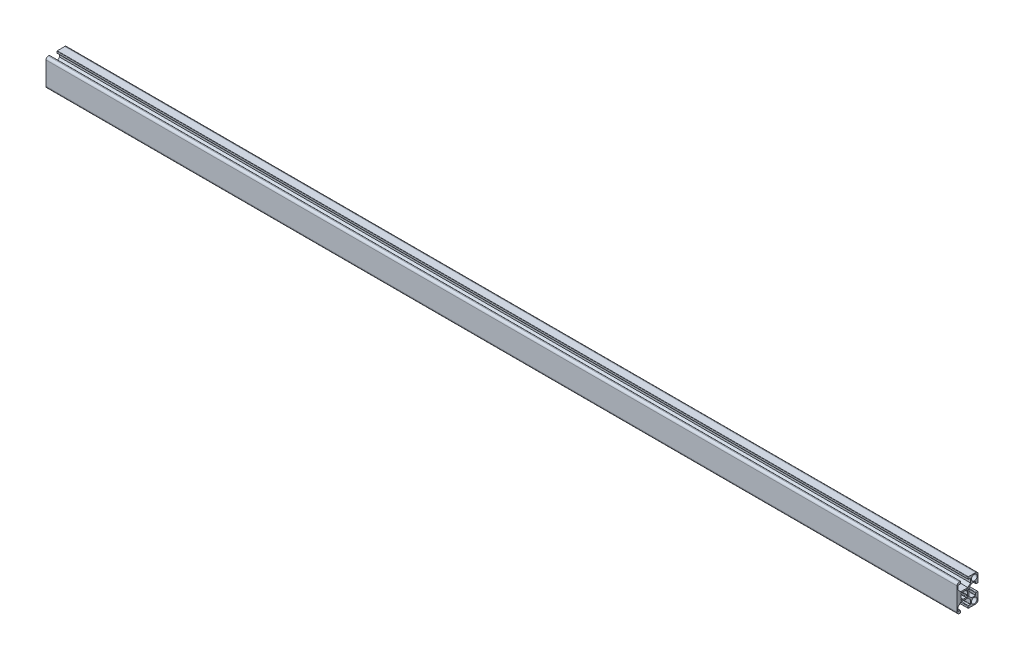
ISO-10303-21;
HEADER;
FILE_DESCRIPTION(('STEP AP214'),'2;1');
FILE_NAME('part.step','',(''),(''),'','','');
FILE_SCHEMA(('AUTOMOTIVE_DESIGN { 1 0 10303 214 1 1 1 1 }'));
ENDSEC;
DATA;
#1=APPLICATION_CONTEXT('core data for automotive mechanical design processes');
#2=APPLICATION_PROTOCOL_DEFINITION('international standard','automotive_design',2000,#1);
#3=PRODUCT_CONTEXT('',#1,'mechanical');
#4=PRODUCT('Part','Part','',(#3));
#5=PRODUCT_RELATED_PRODUCT_CATEGORY('part','',(#4));
#6=PRODUCT_DEFINITION_FORMATION('','',#4);
#7=PRODUCT_DEFINITION_CONTEXT('part definition',#1,'design');
#8=PRODUCT_DEFINITION('design','',#6,#7);
#9=PRODUCT_DEFINITION_SHAPE('','',#8);
#10=(LENGTH_UNIT() NAMED_UNIT(*) SI_UNIT(.MILLI.,.METRE.));
#11=(NAMED_UNIT(*) PLANE_ANGLE_UNIT() SI_UNIT($,.RADIAN.));
#12=(NAMED_UNIT(*) SI_UNIT($,.STERADIAN.) SOLID_ANGLE_UNIT());
#13=UNCERTAINTY_MEASURE_WITH_UNIT(LENGTH_MEASURE(1.E-05),#10,'distance_accuracy_value','');
#14=(GEOMETRIC_REPRESENTATION_CONTEXT(3) GLOBAL_UNCERTAINTY_ASSIGNED_CONTEXT((#13)) GLOBAL_UNIT_ASSIGNED_CONTEXT((#10,
#11,#12)) REPRESENTATION_CONTEXT('',''));
#15=CARTESIAN_POINT('',(0.,0.,0.));
#16=DIRECTION('',(0.,0.,1.));
#17=DIRECTION('',(1.,0.,0.));
#18=AXIS2_PLACEMENT_3D('',#15,#16,#17);
#19=CARTESIAN_POINT('',(1000.,14.6999999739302,-4.40000136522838));
#20=DIRECTION('',(-1.,0.,0.));
#21=DIRECTION('',(0.,0.,1.));
#22=AXIS2_PLACEMENT_3D('',#19,#20,#21);
#23=CYLINDRICAL_SURFACE('',#22,0.300000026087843);
#24=CARTESIAN_POINT('',(0.,14.6999999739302,-4.40000136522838));
#25=DIRECTION('',(1.,0.,0.));
#26=DIRECTION('',(0.,0.,-1.));
#27=AXIS2_PLACEMENT_3D('',#24,#25,#26);
#28=CIRCLE('',#27,0.300000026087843);
#29=CARTESIAN_POINT('',(0.,15.,-4.39999807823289));
#30=VERTEX_POINT('',#29);
#31=CARTESIAN_POINT('',(0.,14.6999999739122,-4.10000133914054));
#32=VERTEX_POINT('',#31);
#33=EDGE_CURVE('E898',#30,#32,#28,.T.);
#34=ORIENTED_EDGE('',*,*,#33,.T.);
#35=DIRECTION('',(-1.,0.,0.));
#36=VECTOR('',#35,1.);
#37=CARTESIAN_POINT('',(1000.,14.6999999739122,-4.10000133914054));
#38=LINE('',#37,#36);
#39=CARTESIAN_POINT('',(1000.,14.6999999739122,-4.10000133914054));
#40=VERTEX_POINT('',#39);
#41=EDGE_CURVE('E13',#40,#32,#38,.T.);
#42=ORIENTED_EDGE('',*,*,#41,.F.);
#43=CARTESIAN_POINT('',(1000.,14.6999999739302,-4.40000136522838));
#44=DIRECTION('',(1.,0.,0.));
#45=DIRECTION('',(0.,0.,-1.));
#46=AXIS2_PLACEMENT_3D('',#43,#44,#45);
#47=CIRCLE('',#46,0.300000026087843);
#48=CARTESIAN_POINT('',(1000.,15.,-4.39999807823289));
#49=VERTEX_POINT('',#48);
#50=EDGE_CURVE('E1341',#49,#40,#47,.T.);
#51=ORIENTED_EDGE('',*,*,#50,.F.);
#52=DIRECTION('',(-1.,0.,0.));
#53=VECTOR('',#52,1.);
#54=CARTESIAN_POINT('',(1000.,15.,-4.39999807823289));
#55=LINE('',#54,#53);
#56=EDGE_CURVE('E1009',#49,#30,#55,.T.);
#57=ORIENTED_EDGE('',*,*,#56,.T.);
#58=EDGE_LOOP('',(#34,#42,#51,#57));
#59=FACE_BOUND('',#58,.T.);
#60=ADVANCED_FACE('F216',(#59),#23,.T.);
#61=CARTESIAN_POINT('',(1000.,14.6999999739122,-4.10000133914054));
#62=DIRECTION('',(0.,0.,-1.));
#63=DIRECTION('',(0.,1.,0.));
#64=AXIS2_PLACEMENT_3D('',#61,#62,#63);
#65=PLANE('',#64);
#66=DIRECTION('',(0.,-1.,0.));
#67=VECTOR('',#66,1.);
#68=CARTESIAN_POINT('',(0.,14.6999999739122,-4.10000133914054));
#69=LINE('',#68,#67);
#70=CARTESIAN_POINT('',(0.,12.9999998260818,-4.10000133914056));
#71=VERTEX_POINT('',#70);
#72=EDGE_CURVE('E901',#32,#71,#69,.T.);
#73=ORIENTED_EDGE('',*,*,#72,.T.);
#74=DIRECTION('',(-1.,0.,0.));
#75=VECTOR('',#74,1.);
#76=CARTESIAN_POINT('',(1000.,12.9999998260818,-4.10000133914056));
#77=LINE('',#76,#75);
#78=CARTESIAN_POINT('',(1000.,12.9999998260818,-4.10000133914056));
#79=VERTEX_POINT('',#78);
#80=EDGE_CURVE('E226',#79,#71,#77,.T.);
#81=ORIENTED_EDGE('',*,*,#80,.F.);
#82=DIRECTION('',(0.,-1.,0.));
#83=VECTOR('',#82,1.);
#84=CARTESIAN_POINT('',(1000.,14.6999999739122,-4.10000133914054));
#85=LINE('',#84,#83);
#86=EDGE_CURVE('E1343',#40,#79,#85,.T.);
#87=ORIENTED_EDGE('',*,*,#86,.F.);
#88=ORIENTED_EDGE('',*,*,#41,.T.);
#89=EDGE_LOOP('',(#73,#81,#87,#88));
#90=FACE_BOUND('',#89,.T.);
#91=ADVANCED_FACE('F1474',(#90),#65,.F.);
#92=CARTESIAN_POINT('',(1000.,12.9999998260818,-4.60000138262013));
#93=DIRECTION('',(-1.,0.,0.));
#94=DIRECTION('',(0.,0.,1.));
#95=AXIS2_PLACEMENT_3D('',#92,#93,#94);
#96=CYLINDRICAL_SURFACE('',#95,0.500000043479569);
#97=CARTESIAN_POINT('',(0.,12.9999998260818,-4.60000138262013));
#98=DIRECTION('',(1.,0.,0.));
#99=DIRECTION('',(0.,0.,-1.));
#100=AXIS2_PLACEMENT_3D('',#97,#98,#99);
#101=CIRCLE('',#100,0.500000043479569);
#102=CARTESIAN_POINT('',(0.,12.4999997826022,-4.60000138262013));
#103=VERTEX_POINT('',#102);
#104=EDGE_CURVE('E903',#71,#103,#101,.T.);
#105=ORIENTED_EDGE('',*,*,#104,.T.);
#106=DIRECTION('',(-1.,0.,0.));
#107=VECTOR('',#106,1.);
#108=CARTESIAN_POINT('',(1000.,12.4999997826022,-4.60000138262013));
#109=LINE('',#108,#107);
#110=CARTESIAN_POINT('',(1000.,12.4999997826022,-4.60000138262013));
#111=VERTEX_POINT('',#110);
#112=EDGE_CURVE('E1160',#111,#103,#109,.T.);
#113=ORIENTED_EDGE('',*,*,#112,.F.);
#114=CARTESIAN_POINT('',(1000.,12.9999998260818,-4.60000138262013));
#115=DIRECTION('',(1.,0.,0.));
#116=DIRECTION('',(0.,0.,-1.));
#117=AXIS2_PLACEMENT_3D('',#114,#115,#116);
#118=CIRCLE('',#117,0.500000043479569);
#119=EDGE_CURVE('E1345',#79,#111,#118,.T.);
#120=ORIENTED_EDGE('',*,*,#119,.F.);
#121=ORIENTED_EDGE('',*,*,#80,.T.);
#122=EDGE_LOOP('',(#105,#113,#120,#121));
#123=FACE_BOUND('',#122,.T.);
#124=ADVANCED_FACE('F1479',(#123),#96,.T.);
#125=CARTESIAN_POINT('',(1000.,12.4999997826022,-4.60000138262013));
#126=DIRECTION('',(0.,1.,0.));
#127=DIRECTION('',(0.,0.,1.));
#128=AXIS2_PLACEMENT_3D('',#125,#126,#127);
#129=PLANE('',#128);
#130=DIRECTION('',(0.,0.,-1.));
#131=VECTOR('',#130,1.);
#132=CARTESIAN_POINT('',(0.,12.4999997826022,-4.60000138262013));
#133=LINE('',#132,#131);
#134=CARTESIAN_POINT('',(0.,12.4999997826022,-6.50000154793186));
#135=VERTEX_POINT('',#134);
#136=EDGE_CURVE('E905',#103,#135,#133,.T.);
#137=ORIENTED_EDGE('',*,*,#136,.T.);
#138=DIRECTION('',(-1.,0.,0.));
#139=VECTOR('',#138,1.);
#140=CARTESIAN_POINT('',(1000.,12.4999997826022,-6.50000154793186));
#141=LINE('',#140,#139);
#142=CARTESIAN_POINT('',(1000.,12.4999997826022,-6.50000154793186));
#143=VERTEX_POINT('',#142);
#144=EDGE_CURVE('E1157',#143,#135,#141,.T.);
#145=ORIENTED_EDGE('',*,*,#144,.F.);
#146=DIRECTION('',(0.,0.,-1.));
#147=VECTOR('',#146,1.);
#148=CARTESIAN_POINT('',(1000.,12.4999997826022,-4.60000138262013));
#149=LINE('',#148,#147);
#150=EDGE_CURVE('E1347',#111,#143,#149,.T.);
#151=ORIENTED_EDGE('',*,*,#150,.F.);
#152=ORIENTED_EDGE('',*,*,#112,.T.);
#153=EDGE_LOOP('',(#137,#145,#151,#152));
#154=FACE_BOUND('',#153,.T.);
#155=ADVANCED_FACE('F1804',(#154),#129,.F.);
#156=CARTESIAN_POINT('',(1000.,12.2000027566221,-6.49999826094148));
#157=DIRECTION('',(-1.,0.,0.));
#158=DIRECTION('',(0.,0.,1.));
#159=AXIS2_PLACEMENT_3D('',#156,#157,#158);
#160=CYLINDRICAL_SURFACE('',#159,0.299997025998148);
#161=CARTESIAN_POINT('',(0.,12.2000027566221,-6.49999826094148));
#162=DIRECTION('',(-1.,0.,0.));
#163=DIRECTION('',(0.,0.,-1.));
#164=AXIS2_PLACEMENT_3D('',#161,#162,#163);
#165=CIRCLE('',#164,0.299997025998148);
#166=CARTESIAN_POINT('',(0.,12.2000010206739,-6.7999952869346));
#167=VERTEX_POINT('',#166);
#168=EDGE_CURVE('E907',#135,#167,#165,.T.);
#169=ORIENTED_EDGE('',*,*,#168,.T.);
#170=DIRECTION('',(-1.,0.,0.));
#171=VECTOR('',#170,1.);
#172=CARTESIAN_POINT('',(1000.,12.2000010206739,-6.7999952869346));
#173=LINE('',#172,#171);
#174=CARTESIAN_POINT('',(1000.,12.2000010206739,-6.7999952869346));
#175=VERTEX_POINT('',#174);
#176=EDGE_CURVE('E1154',#175,#167,#173,.T.);
#177=ORIENTED_EDGE('',*,*,#176,.F.);
#178=CARTESIAN_POINT('',(1000.,12.2000027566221,-6.49999826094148));
#179=DIRECTION('',(-1.,0.,0.));
#180=DIRECTION('',(0.,0.,-1.));
#181=AXIS2_PLACEMENT_3D('',#178,#179,#180);
#182=CIRCLE('',#181,0.299997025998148);
#183=EDGE_CURVE('E1349',#143,#175,#182,.T.);
#184=ORIENTED_EDGE('',*,*,#183,.F.);
#185=ORIENTED_EDGE('',*,*,#144,.T.);
#186=EDGE_LOOP('',(#169,#177,#184,#185));
#187=FACE_BOUND('',#186,.T.);
#188=ADVANCED_FACE('F1800',(#187),#160,.F.);
#189=CARTESIAN_POINT('',(1000.,12.2000010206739,-6.7999952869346));
#190=DIRECTION('',(0.,0.,-1.));
#191=DIRECTION('',(0.,1.,0.));
#192=AXIS2_PLACEMENT_3D('',#189,#190,#191);
#193=PLANE('',#192);
#194=DIRECTION('',(0.,-1.,0.));
#195=VECTOR('',#194,1.);
#196=CARTESIAN_POINT('',(0.,12.2000010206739,-6.7999952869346));
#197=LINE('',#196,#195);
#198=CARTESIAN_POINT('',(0.,7.86065364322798,-6.79999528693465));
#199=VERTEX_POINT('',#198);
#200=EDGE_CURVE('E909',#167,#199,#197,.T.);
#201=ORIENTED_EDGE('',*,*,#200,.T.);
#202=DIRECTION('',(-1.,0.,0.));
#203=VECTOR('',#202,1.);
#204=CARTESIAN_POINT('',(1000.,7.86065364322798,-6.79999528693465));
#205=LINE('',#204,#203);
#206=CARTESIAN_POINT('',(1000.,7.86065364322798,-6.79999528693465));
#207=VERTEX_POINT('',#206);
#208=EDGE_CURVE('E1151',#207,#199,#205,.T.);
#209=ORIENTED_EDGE('',*,*,#208,.F.);
#210=DIRECTION('',(0.,-1.,0.));
#211=VECTOR('',#210,1.);
#212=CARTESIAN_POINT('',(1000.,12.2000010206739,-6.7999952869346));
#213=LINE('',#212,#211);
#214=EDGE_CURVE('E1351',#175,#207,#213,.T.);
#215=ORIENTED_EDGE('',*,*,#214,.F.);
#216=ORIENTED_EDGE('',*,*,#176,.T.);
#217=EDGE_LOOP('',(#201,#209,#215,#216));
#218=FACE_BOUND('',#217,.T.);
#219=ADVANCED_FACE('F1796',(#218),#193,.F.);
#220=CARTESIAN_POINT('',(1000.,7.86065364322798,-6.79999528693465));
#221=DIRECTION('',(0.,-0.707106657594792,-0.707106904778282));
#222=DIRECTION('',(0.,0.707106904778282,-0.707106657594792));
#223=AXIS2_PLACEMENT_3D('',#220,#221,#222);
#224=PLANE('',#223);
#225=DIRECTION('',(0.,-0.707106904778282,0.707106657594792));
#226=VECTOR('',#225,1.);
#227=CARTESIAN_POINT('',(0.,7.86065364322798,-6.79999528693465));
#228=LINE('',#227,#226);
#229=CARTESIAN_POINT('',(0.,4.99999739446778,-3.93934003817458));
#230=VERTEX_POINT('',#229);
#231=EDGE_CURVE('E911',#199,#230,#228,.T.);
#232=ORIENTED_EDGE('',*,*,#231,.T.);
#233=DIRECTION('',(-1.,0.,0.));
#234=VECTOR('',#233,1.);
#235=CARTESIAN_POINT('',(1000.,4.99999739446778,-3.93934003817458));
#236=LINE('',#235,#234);
#237=CARTESIAN_POINT('',(1000.,4.99999739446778,-3.93934003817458));
#238=VERTEX_POINT('',#237);
#239=EDGE_CURVE('E1148',#238,#230,#236,.T.);
#240=ORIENTED_EDGE('',*,*,#239,.F.);
#241=DIRECTION('',(0.,-0.707106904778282,0.707106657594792));
#242=VECTOR('',#241,1.);
#243=CARTESIAN_POINT('',(1000.,7.86065364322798,-6.79999528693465));
#244=LINE('',#243,#242);
#245=EDGE_CURVE('E1353',#207,#238,#244,.T.);
#246=ORIENTED_EDGE('',*,*,#245,.F.);
#247=ORIENTED_EDGE('',*,*,#208,.T.);
#248=EDGE_LOOP('',(#232,#240,#246,#247));
#249=FACE_BOUND('',#248,.T.);
#250=ADVANCED_FACE('F1792',(#249),#224,.F.);
#251=CARTESIAN_POINT('',(1000.,4.99999739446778,-3.93934003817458));
#252=DIRECTION('',(0.,-1.,0.));
#253=DIRECTION('',(0.,0.,-1.));
#254=AXIS2_PLACEMENT_3D('',#251,#252,#253);
#255=PLANE('',#254);
#256=DIRECTION('',(0.,0.,1.));
#257=VECTOR('',#256,1.);
#258=CARTESIAN_POINT('',(0.,4.99999739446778,-3.93934003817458));
#259=LINE('',#258,#257);
#260=CARTESIAN_POINT('',(0.,4.99999739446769,3.93934064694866));
#261=VERTEX_POINT('',#260);
#262=EDGE_CURVE('E913',#230,#261,#259,.T.);
#263=ORIENTED_EDGE('',*,*,#262,.T.);
#264=DIRECTION('',(-1.,0.,0.));
#265=VECTOR('',#264,1.);
#266=CARTESIAN_POINT('',(1000.,4.99999739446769,3.93934064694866));
#267=LINE('',#266,#265);
#268=CARTESIAN_POINT('',(1000.,4.99999739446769,3.93934064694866));
#269=VERTEX_POINT('',#268);
#270=EDGE_CURVE('E1145',#269,#261,#267,.T.);
#271=ORIENTED_EDGE('',*,*,#270,.F.);
#272=DIRECTION('',(0.,0.,1.));
#273=VECTOR('',#272,1.);
#274=CARTESIAN_POINT('',(1000.,4.99999739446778,-3.93934003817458));
#275=LINE('',#274,#273);
#276=EDGE_CURVE('E1355',#238,#269,#275,.T.);
#277=ORIENTED_EDGE('',*,*,#276,.F.);
#278=ORIENTED_EDGE('',*,*,#239,.T.);
#279=EDGE_LOOP('',(#263,#271,#277,#278));
#280=FACE_BOUND('',#279,.T.);
#281=ADVANCED_FACE('F1788',(#280),#255,.F.);
#282=CARTESIAN_POINT('',(1000.,4.99999739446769,3.93934064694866));
#283=DIRECTION('',(0.,-0.707106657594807,0.707106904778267));
#284=DIRECTION('',(0.,-0.707106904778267,-0.707106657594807));
#285=AXIS2_PLACEMENT_3D('',#282,#283,#284);
#286=PLANE('',#285);
#287=DIRECTION('',(0.,0.707106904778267,0.707106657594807));
#288=VECTOR('',#287,1.);
#289=CARTESIAN_POINT('',(0.,4.99999739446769,3.93934064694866));
#290=LINE('',#289,#288);
#291=CARTESIAN_POINT('',(0.,7.86065364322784,6.7999958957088));
#292=VERTEX_POINT('',#291);
#293=EDGE_CURVE('E915',#261,#292,#290,.T.);
#294=ORIENTED_EDGE('',*,*,#293,.T.);
#295=DIRECTION('',(-1.,0.,0.));
#296=VECTOR('',#295,1.);
#297=CARTESIAN_POINT('',(1000.,7.86065364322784,6.7999958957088));
#298=LINE('',#297,#296);
#299=CARTESIAN_POINT('',(1000.,7.86065364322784,6.7999958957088));
#300=VERTEX_POINT('',#299);
#301=EDGE_CURVE('E1142',#300,#292,#298,.T.);
#302=ORIENTED_EDGE('',*,*,#301,.F.);
#303=DIRECTION('',(0.,0.707106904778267,0.707106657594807));
#304=VECTOR('',#303,1.);
#305=CARTESIAN_POINT('',(1000.,4.99999739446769,3.93934064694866));
#306=LINE('',#305,#304);
#307=EDGE_CURVE('E1357',#269,#300,#306,.T.);
#308=ORIENTED_EDGE('',*,*,#307,.F.);
#309=ORIENTED_EDGE('',*,*,#270,.T.);
#310=EDGE_LOOP('',(#294,#302,#308,#309));
#311=FACE_BOUND('',#310,.T.);
#312=ADVANCED_FACE('F1784',(#311),#286,.F.);
#313=CARTESIAN_POINT('',(1000.,7.86065364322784,6.7999958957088));
#314=DIRECTION('',(0.,0.,1.));
#315=DIRECTION('',(0.,-1.,0.));
#316=AXIS2_PLACEMENT_3D('',#313,#314,#315);
#317=PLANE('',#316);
#318=DIRECTION('',(0.,1.,0.));
#319=VECTOR('',#318,1.);
#320=CARTESIAN_POINT('',(0.,7.86065364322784,6.7999958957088));
#321=LINE('',#320,#319);
#322=CARTESIAN_POINT('',(0.,12.2000010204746,6.79999589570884));
#323=VERTEX_POINT('',#322);
#324=EDGE_CURVE('E917',#292,#323,#321,.T.);
#325=ORIENTED_EDGE('',*,*,#324,.T.);
#326=DIRECTION('',(-1.,0.,0.));
#327=VECTOR('',#326,1.);
#328=CARTESIAN_POINT('',(1000.,12.2000010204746,6.79999589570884));
#329=LINE('',#328,#327);
#330=CARTESIAN_POINT('',(1000.,12.2000010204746,6.79999589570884));
#331=VERTEX_POINT('',#330);
#332=EDGE_CURVE('E1139',#331,#323,#329,.T.);
#333=ORIENTED_EDGE('',*,*,#332,.F.);
#334=DIRECTION('',(0.,1.,0.));
#335=VECTOR('',#334,1.);
#336=CARTESIAN_POINT('',(1000.,7.86065364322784,6.7999958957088));
#337=LINE('',#336,#335);
#338=EDGE_CURVE('E1359',#300,#331,#337,.T.);
#339=ORIENTED_EDGE('',*,*,#338,.F.);
#340=ORIENTED_EDGE('',*,*,#301,.T.);
#341=EDGE_LOOP('',(#325,#333,#339,#340));
#342=FACE_BOUND('',#341,.T.);
#343=ADVANCED_FACE('F1780',(#342),#317,.F.);
#344=CARTESIAN_POINT('',(1000.,12.2000010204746,6.49999886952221));
#345=DIRECTION('',(-1.,0.,0.));
#346=DIRECTION('',(0.,0.,1.));
#347=AXIS2_PLACEMENT_3D('',#344,#345,#346);
#348=CYLINDRICAL_SURFACE('',#347,0.299997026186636);
#349=CARTESIAN_POINT('',(0.,12.2000010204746,6.49999886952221));
#350=DIRECTION('',(-1.,0.,0.));
#351=DIRECTION('',(0.,0.,-1.));
#352=AXIS2_PLACEMENT_3D('',#349,#350,#351);
#353=CIRCLE('',#352,0.299997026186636);
#354=CARTESIAN_POINT('',(0.,12.4999980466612,6.49999886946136));
#355=VERTEX_POINT('',#354);
#356=EDGE_CURVE('E919',#323,#355,#353,.T.);
#357=ORIENTED_EDGE('',*,*,#356,.T.);
#358=DIRECTION('',(-1.,0.,0.));
#359=VECTOR('',#358,1.);
#360=CARTESIAN_POINT('',(1000.,12.4999980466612,6.49999886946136));
#361=LINE('',#360,#359);
#362=CARTESIAN_POINT('',(1000.,12.4999980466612,6.49999886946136));
#363=VERTEX_POINT('',#362);
#364=EDGE_CURVE('E1136',#363,#355,#361,.T.);
#365=ORIENTED_EDGE('',*,*,#364,.F.);
#366=CARTESIAN_POINT('',(1000.,12.2000010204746,6.49999886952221));
#367=DIRECTION('',(-1.,0.,0.));
#368=DIRECTION('',(0.,0.,-1.));
#369=AXIS2_PLACEMENT_3D('',#366,#367,#368);
#370=CIRCLE('',#369,0.299997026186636);
#371=EDGE_CURVE('E1361',#331,#363,#370,.T.);
#372=ORIENTED_EDGE('',*,*,#371,.F.);
#373=ORIENTED_EDGE('',*,*,#332,.T.);
#374=EDGE_LOOP('',(#357,#365,#372,#373));
#375=FACE_BOUND('',#374,.T.);
#376=ADVANCED_FACE('F1776',(#375),#348,.F.);
#377=CARTESIAN_POINT('',(1000.,12.4999980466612,6.49999886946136));
#378=DIRECTION('',(0.,1.,0.));
#379=DIRECTION('',(0.,0.,1.));
#380=AXIS2_PLACEMENT_3D('',#377,#378,#379);
#381=PLANE('',#380);
#382=DIRECTION('',(0.,0.,-1.));
#383=VECTOR('',#382,1.);
#384=CARTESIAN_POINT('',(0.,12.4999980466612,6.49999886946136));
#385=LINE('',#384,#383);
#386=CARTESIAN_POINT('',(0.,12.4999980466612,4.59999870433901));
#387=VERTEX_POINT('',#386);
#388=EDGE_CURVE('E921',#355,#387,#385,.T.);
#389=ORIENTED_EDGE('',*,*,#388,.T.);
#390=DIRECTION('',(-1.,0.,0.));
#391=VECTOR('',#390,1.);
#392=CARTESIAN_POINT('',(1000.,12.4999980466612,4.59999870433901));
#393=LINE('',#392,#391);
#394=CARTESIAN_POINT('',(1000.,12.4999980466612,4.59999870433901));
#395=VERTEX_POINT('',#394);
#396=EDGE_CURVE('E1133',#395,#387,#393,.T.);
#397=ORIENTED_EDGE('',*,*,#396,.F.);
#398=DIRECTION('',(0.,0.,-1.));
#399=VECTOR('',#398,1.);
#400=CARTESIAN_POINT('',(1000.,12.4999980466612,6.49999886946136));
#401=LINE('',#400,#399);
#402=EDGE_CURVE('E1363',#363,#395,#401,.T.);
#403=ORIENTED_EDGE('',*,*,#402,.F.);
#404=ORIENTED_EDGE('',*,*,#364,.T.);
#405=EDGE_LOOP('',(#389,#397,#403,#404));
#406=FACE_BOUND('',#405,.T.);
#407=ADVANCED_FACE('F1772',(#406),#381,.F.);
#408=CARTESIAN_POINT('',(1000.,12.9999980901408,4.59999870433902));
#409=DIRECTION('',(-1.,0.,0.));
#410=DIRECTION('',(0.,0.,1.));
#411=AXIS2_PLACEMENT_3D('',#408,#409,#410);
#412=CYLINDRICAL_SURFACE('',#411,0.500000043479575);
#413=CARTESIAN_POINT('',(0.,12.9999980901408,4.59999870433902));
#414=DIRECTION('',(1.,0.,0.));
#415=DIRECTION('',(0.,0.,-1.));
#416=AXIS2_PLACEMENT_3D('',#413,#414,#415);
#417=CIRCLE('',#416,0.500000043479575);
#418=CARTESIAN_POINT('',(0.,12.9999980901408,4.09999866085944));
#419=VERTEX_POINT('',#418);
#420=EDGE_CURVE('E923',#387,#419,#417,.T.);
#421=ORIENTED_EDGE('',*,*,#420,.T.);
#422=DIRECTION('',(-1.,0.,0.));
#423=VECTOR('',#422,1.);
#424=CARTESIAN_POINT('',(1000.,12.9999980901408,4.09999866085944));
#425=LINE('',#424,#423);
#426=CARTESIAN_POINT('',(1000.,12.9999980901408,4.09999866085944));
#427=VERTEX_POINT('',#426);
#428=EDGE_CURVE('E1130',#427,#419,#425,.T.);
#429=ORIENTED_EDGE('',*,*,#428,.F.);
#430=CARTESIAN_POINT('',(1000.,12.9999980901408,4.59999870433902));
#431=DIRECTION('',(1.,0.,0.));
#432=DIRECTION('',(0.,0.,-1.));
#433=AXIS2_PLACEMENT_3D('',#430,#431,#432);
#434=CIRCLE('',#433,0.500000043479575);
#435=EDGE_CURVE('E1365',#395,#427,#434,.T.);
#436=ORIENTED_EDGE('',*,*,#435,.F.);
#437=ORIENTED_EDGE('',*,*,#396,.T.);
#438=EDGE_LOOP('',(#421,#429,#436,#437));
#439=FACE_BOUND('',#438,.T.);
#440=ADVANCED_FACE('F1768',(#439),#412,.T.);
#441=CARTESIAN_POINT('',(1000.,12.9999980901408,4.09999866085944));
#442=DIRECTION('',(0.,0.,1.));
#443=DIRECTION('',(0.,-1.,0.));
#444=AXIS2_PLACEMENT_3D('',#441,#442,#443);
#445=PLANE('',#444);
#446=DIRECTION('',(0.,1.,0.));
#447=VECTOR('',#446,1.);
#448=CARTESIAN_POINT('',(0.,12.9999980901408,4.09999866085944));
#449=LINE('',#448,#447);
#450=CARTESIAN_POINT('',(0.,14.6999982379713,4.09999866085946));
#451=VERTEX_POINT('',#450);
#452=EDGE_CURVE('E925',#419,#451,#449,.T.);
#453=ORIENTED_EDGE('',*,*,#452,.T.);
#454=DIRECTION('',(-1.,0.,0.));
#455=VECTOR('',#454,1.);
#456=CARTESIAN_POINT('',(1000.,14.6999982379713,4.09999866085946));
#457=LINE('',#456,#455);
#458=CARTESIAN_POINT('',(1000.,14.6999982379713,4.09999866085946));
#459=VERTEX_POINT('',#458);
#460=EDGE_CURVE('E1127',#459,#451,#457,.T.);
#461=ORIENTED_EDGE('',*,*,#460,.F.);
#462=DIRECTION('',(0.,1.,0.));
#463=VECTOR('',#462,1.);
#464=CARTESIAN_POINT('',(1000.,12.9999980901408,4.09999866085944));
#465=LINE('',#464,#463);
#466=EDGE_CURVE('E1367',#427,#459,#465,.T.);
#467=ORIENTED_EDGE('',*,*,#466,.F.);
#468=ORIENTED_EDGE('',*,*,#428,.T.);
#469=EDGE_LOOP('',(#453,#461,#467,#468));
#470=FACE_BOUND('',#469,.T.);
#471=ADVANCED_FACE('F1764',(#470),#445,.F.);
#472=CARTESIAN_POINT('',(1000.,14.6999982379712,4.39999868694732));
#473=DIRECTION('',(-1.,0.,0.));
#474=DIRECTION('',(0.,0.,1.));
#475=AXIS2_PLACEMENT_3D('',#472,#473,#474);
#476=CYLINDRICAL_SURFACE('',#475,0.300000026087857);
#477=CARTESIAN_POINT('',(0.,14.6999982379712,4.39999868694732));
#478=DIRECTION('',(1.,0.,0.));
#479=DIRECTION('',(0.,0.,-1.));
#480=AXIS2_PLACEMENT_3D('',#477,#478,#479);
#481=CIRCLE('',#480,0.300000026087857);
#482=CARTESIAN_POINT('',(0.,14.9999982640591,4.39999868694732));
#483=VERTEX_POINT('',#482);
#484=EDGE_CURVE('E927',#451,#483,#481,.T.);
#485=ORIENTED_EDGE('',*,*,#484,.T.);
#486=DIRECTION('',(-1.,0.,0.));
#487=VECTOR('',#486,1.);
#488=CARTESIAN_POINT('',(1000.,14.9999982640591,4.39999868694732));
#489=LINE('',#488,#487);
#490=CARTESIAN_POINT('',(1000.,14.9999982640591,4.39999868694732));
#491=VERTEX_POINT('',#490);
#492=EDGE_CURVE('E1124',#491,#483,#489,.T.);
#493=ORIENTED_EDGE('',*,*,#492,.F.);
#494=CARTESIAN_POINT('',(1000.,14.6999982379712,4.39999868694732));
#495=DIRECTION('',(1.,0.,0.));
#496=DIRECTION('',(0.,0.,-1.));
#497=AXIS2_PLACEMENT_3D('',#494,#495,#496);
#498=CIRCLE('',#497,0.300000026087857);
#499=EDGE_CURVE('E1369',#459,#491,#498,.T.);
#500=ORIENTED_EDGE('',*,*,#499,.F.);
#501=ORIENTED_EDGE('',*,*,#460,.T.);
#502=EDGE_LOOP('',(#485,#493,#500,#501));
#503=FACE_BOUND('',#502,.T.);
#504=ADVANCED_FACE('F1760',(#503),#476,.T.);
#505=CARTESIAN_POINT('',(1000.,14.9999982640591,4.39999868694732));
#506=DIRECTION('',(0.,-1.,0.));
#507=DIRECTION('',(0.,0.,-1.));
#508=AXIS2_PLACEMENT_3D('',#505,#506,#507);
#509=PLANE('',#508);
#510=DIRECTION('',(0.,0.,1.));
#511=VECTOR('',#510,1.);
#512=CARTESIAN_POINT('',(0.,14.9999982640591,4.39999868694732));
#513=LINE('',#512,#511);
#514=CARTESIAN_POINT('',(0.,14.9999982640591,5.49999978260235));
#515=VERTEX_POINT('',#514);
#516=EDGE_CURVE('E929',#483,#515,#513,.T.);
#517=ORIENTED_EDGE('',*,*,#516,.T.);
#518=DIRECTION('',(-1.,0.,0.));
#519=VECTOR('',#518,1.);
#520=CARTESIAN_POINT('',(1000.,14.9999982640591,5.49999978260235));
#521=LINE('',#520,#519);
#522=CARTESIAN_POINT('',(1000.,14.9999982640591,5.49999978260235));
#523=VERTEX_POINT('',#522);
#524=EDGE_CURVE('E1121',#523,#515,#521,.T.);
#525=ORIENTED_EDGE('',*,*,#524,.F.);
#526=DIRECTION('',(0.,0.,1.));
#527=VECTOR('',#526,1.);
#528=CARTESIAN_POINT('',(1000.,14.9999982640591,4.39999868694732));
#529=LINE('',#528,#527);
#530=EDGE_CURVE('E1371',#491,#523,#529,.T.);
#531=ORIENTED_EDGE('',*,*,#530,.F.);
#532=ORIENTED_EDGE('',*,*,#492,.T.);
#533=EDGE_LOOP('',(#517,#525,#531,#532));
#534=FACE_BOUND('',#533,.T.);
#535=ADVANCED_FACE('F1756',(#534),#509,.F.);
#536=CARTESIAN_POINT('',(1000.,12.4999980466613,5.49999978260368));
#537=DIRECTION('',(-1.,0.,0.));
#538=DIRECTION('',(0.,0.,1.));
#539=AXIS2_PLACEMENT_3D('',#536,#537,#538);
#540=CYLINDRICAL_SURFACE('',#539,2.50000021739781);
#541=CARTESIAN_POINT('',(0.,12.4999980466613,5.49999978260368));
#542=DIRECTION('',(1.,0.,0.));
#543=DIRECTION('',(0.,0.,-1.));
#544=AXIS2_PLACEMENT_3D('',#541,#542,#543);
#545=CIRCLE('',#544,2.50000021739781);
#546=CARTESIAN_POINT('',(0.,12.5000006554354,8.00000000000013));
#547=VERTEX_POINT('',#546);
#548=EDGE_CURVE('E931',#515,#547,#545,.T.);
#549=ORIENTED_EDGE('',*,*,#548,.T.);
#550=DIRECTION('',(-1.,0.,0.));
#551=VECTOR('',#550,1.);
#552=CARTESIAN_POINT('',(1000.,12.5000006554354,8.00000000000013));
#553=LINE('',#552,#551);
#554=CARTESIAN_POINT('',(1000.,12.5000006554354,8.00000000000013));
#555=VERTEX_POINT('',#554);
#556=EDGE_CURVE('E1118',#555,#547,#553,.T.);
#557=ORIENTED_EDGE('',*,*,#556,.F.);
#558=CARTESIAN_POINT('',(1000.,12.4999980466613,5.49999978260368));
#559=DIRECTION('',(1.,0.,0.));
#560=DIRECTION('',(0.,0.,-1.));
#561=AXIS2_PLACEMENT_3D('',#558,#559,#560);
#562=CIRCLE('',#561,2.50000021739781);
#563=EDGE_CURVE('E1373',#523,#555,#562,.T.);
#564=ORIENTED_EDGE('',*,*,#563,.F.);
#565=ORIENTED_EDGE('',*,*,#524,.T.);
#566=EDGE_LOOP('',(#549,#557,#564,#565));
#567=FACE_BOUND('',#566,.T.);
#568=ADVANCED_FACE('F1752',(#567),#540,.T.);
#569=CARTESIAN_POINT('',(1000.,12.5000006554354,8.00000000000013));
#570=DIRECTION('',(0.,0.,-1.));
#571=DIRECTION('',(0.,1.,0.));
#572=AXIS2_PLACEMENT_3D('',#569,#570,#571);
#573=PLANE('',#572);
#574=DIRECTION('',(0.,-1.,0.));
#575=VECTOR('',#574,1.);
#576=CARTESIAN_POINT('',(0.,12.5000006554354,8.00000000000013));
#577=LINE('',#576,#575);
#578=CARTESIAN_POINT('',(0.,-12.5000015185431,7.99999999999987));
#579=VERTEX_POINT('',#578);
#580=EDGE_CURVE('E933',#547,#579,#577,.T.);
#581=ORIENTED_EDGE('',*,*,#580,.T.);
#582=DIRECTION('',(-1.,0.,0.));
#583=VECTOR('',#582,1.);
#584=CARTESIAN_POINT('',(1000.,-12.5000015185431,7.99999999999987));
#585=LINE('',#584,#583);
#586=CARTESIAN_POINT('',(1000.,-12.5000015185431,7.99999999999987));
#587=VERTEX_POINT('',#586);
#588=EDGE_CURVE('E1115',#587,#579,#585,.T.);
#589=ORIENTED_EDGE('',*,*,#588,.F.);
#590=DIRECTION('',(0.,-1.,0.));
#591=VECTOR('',#590,1.);
#592=CARTESIAN_POINT('',(1000.,12.5000006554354,8.00000000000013));
#593=LINE('',#592,#591);
#594=EDGE_CURVE('E1375',#555,#587,#593,.T.);
#595=ORIENTED_EDGE('',*,*,#594,.F.);
#596=ORIENTED_EDGE('',*,*,#556,.T.);
#597=EDGE_LOOP('',(#581,#589,#595,#596));
#598=FACE_BOUND('',#597,.T.);
#599=ADVANCED_FACE('F1748',(#598),#573,.F.);
#600=CARTESIAN_POINT('',(1000.,-12.5000015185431,5.49999978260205));
#601=DIRECTION('',(-1.,0.,0.));
#602=DIRECTION('',(0.,0.,1.));
#603=AXIS2_PLACEMENT_3D('',#600,#601,#602);
#604=CYLINDRICAL_SURFACE('',#603,2.50000021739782);
#605=CARTESIAN_POINT('',(0.,-12.5000015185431,5.49999978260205));
#606=DIRECTION('',(1.,0.,0.));
#607=DIRECTION('',(0.,0.,-1.));
#608=AXIS2_PLACEMENT_3D('',#605,#606,#607);
#609=CIRCLE('',#608,2.50000021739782);
#610=CARTESIAN_POINT('',(0.,-15.0000017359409,5.49999978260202));
#611=VERTEX_POINT('',#610);
#612=EDGE_CURVE('E935',#579,#611,#609,.T.);
#613=ORIENTED_EDGE('',*,*,#612,.T.);
#614=DIRECTION('',(-1.,0.,0.));
#615=VECTOR('',#614,1.);
#616=CARTESIAN_POINT('',(1000.,-15.0000017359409,5.49999978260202));
#617=LINE('',#616,#615);
#618=CARTESIAN_POINT('',(1000.,-15.0000017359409,5.49999978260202));
#619=VERTEX_POINT('',#618);
#620=EDGE_CURVE('E1112',#619,#611,#617,.T.);
#621=ORIENTED_EDGE('',*,*,#620,.F.);
#622=CARTESIAN_POINT('',(1000.,-12.5000015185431,5.49999978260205));
#623=DIRECTION('',(1.,0.,0.));
#624=DIRECTION('',(0.,0.,-1.));
#625=AXIS2_PLACEMENT_3D('',#622,#623,#624);
#626=CIRCLE('',#625,2.50000021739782);
#627=EDGE_CURVE('E1377',#587,#619,#626,.T.);
#628=ORIENTED_EDGE('',*,*,#627,.F.);
#629=ORIENTED_EDGE('',*,*,#588,.T.);
#630=EDGE_LOOP('',(#613,#621,#628,#629));
#631=FACE_BOUND('',#630,.T.);
#632=ADVANCED_FACE('F1744',(#631),#604,.T.);
#633=CARTESIAN_POINT('',(1000.,-15.0000017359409,5.49999978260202));
#634=DIRECTION('',(0.,1.,0.));
#635=DIRECTION('',(0.,0.,1.));
#636=AXIS2_PLACEMENT_3D('',#633,#634,#635);
#637=PLANE('',#636);
#638=DIRECTION('',(0.,0.,-1.));
#639=VECTOR('',#638,1.);
#640=CARTESIAN_POINT('',(0.,-15.0000017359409,5.49999978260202));
#641=LINE('',#640,#639);
#642=CARTESIAN_POINT('',(0.,-15.0000017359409,4.39999868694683));
#643=VERTEX_POINT('',#642);
#644=EDGE_CURVE('E937',#611,#643,#641,.T.);
#645=ORIENTED_EDGE('',*,*,#644,.T.);
#646=DIRECTION('',(-1.,0.,0.));
#647=VECTOR('',#646,1.);
#648=CARTESIAN_POINT('',(1000.,-15.0000017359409,4.39999868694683));
#649=LINE('',#648,#647);
#650=CARTESIAN_POINT('',(1000.,-15.0000017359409,4.39999868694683));
#651=VERTEX_POINT('',#650);
#652=EDGE_CURVE('E1109',#651,#643,#649,.T.);
#653=ORIENTED_EDGE('',*,*,#652,.F.);
#654=DIRECTION('',(0.,0.,-1.));
#655=VECTOR('',#654,1.);
#656=CARTESIAN_POINT('',(1000.,-15.0000017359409,5.49999978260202));
#657=LINE('',#656,#655);
#658=EDGE_CURVE('E1379',#619,#651,#657,.T.);
#659=ORIENTED_EDGE('',*,*,#658,.F.);
#660=ORIENTED_EDGE('',*,*,#620,.T.);
#661=EDGE_LOOP('',(#645,#653,#659,#660));
#662=FACE_BOUND('',#661,.T.);
#663=ADVANCED_FACE('F1740',(#662),#637,.F.);
#664=CARTESIAN_POINT('',(1000.,-14.7000017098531,4.39999868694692));
#665=DIRECTION('',(-1.,0.,0.));
#666=DIRECTION('',(0.,0.,1.));
#667=AXIS2_PLACEMENT_3D('',#664,#665,#666);
#668=CYLINDRICAL_SURFACE('',#667,0.300000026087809);
#669=CARTESIAN_POINT('',(0.,-14.7000017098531,4.39999868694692));
#670=DIRECTION('',(1.,0.,0.));
#671=DIRECTION('',(0.,0.,-1.));
#672=AXIS2_PLACEMENT_3D('',#669,#670,#671);
#673=CIRCLE('',#672,0.300000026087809);
#674=CARTESIAN_POINT('',(0.,-14.7000017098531,4.09999866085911));
#675=VERTEX_POINT('',#674);
#676=EDGE_CURVE('E939',#643,#675,#673,.T.);
#677=ORIENTED_EDGE('',*,*,#676,.T.);
#678=DIRECTION('',(-1.,0.,0.));
#679=VECTOR('',#678,1.);
#680=CARTESIAN_POINT('',(1000.,-14.7000017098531,4.09999866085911));
#681=LINE('',#680,#679);
#682=CARTESIAN_POINT('',(1000.,-14.7000017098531,4.09999866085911));
#683=VERTEX_POINT('',#682);
#684=EDGE_CURVE('E1106',#683,#675,#681,.T.);
#685=ORIENTED_EDGE('',*,*,#684,.F.);
#686=CARTESIAN_POINT('',(1000.,-14.7000017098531,4.39999868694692));
#687=DIRECTION('',(1.,0.,0.));
#688=DIRECTION('',(0.,0.,-1.));
#689=AXIS2_PLACEMENT_3D('',#686,#687,#688);
#690=CIRCLE('',#689,0.300000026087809);
#691=EDGE_CURVE('E1381',#651,#683,#690,.T.);
#692=ORIENTED_EDGE('',*,*,#691,.F.);
#693=ORIENTED_EDGE('',*,*,#652,.T.);
#694=EDGE_LOOP('',(#677,#685,#692,#693));
#695=FACE_BOUND('',#694,.T.);
#696=ADVANCED_FACE('F1736',(#695),#668,.T.);
#697=CARTESIAN_POINT('',(1000.,-14.7000017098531,4.09999866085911));
#698=DIRECTION('',(0.,0.,1.));
#699=DIRECTION('',(0.,-1.,0.));
#700=AXIS2_PLACEMENT_3D('',#697,#698,#699);
#701=PLANE('',#700);
#702=DIRECTION('',(0.,1.,0.));
#703=VECTOR('',#702,1.);
#704=CARTESIAN_POINT('',(0.,-14.7000017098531,4.09999866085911));
#705=LINE('',#704,#703);
#706=CARTESIAN_POINT('',(0.,-13.0000015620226,4.09999866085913));
#707=VERTEX_POINT('',#706);
#708=EDGE_CURVE('E941',#675,#707,#705,.T.);
#709=ORIENTED_EDGE('',*,*,#708,.T.);
#710=DIRECTION('',(-1.,0.,0.));
#711=VECTOR('',#710,1.);
#712=CARTESIAN_POINT('',(1000.,-13.0000015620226,4.09999866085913));
#713=LINE('',#712,#711);
#714=CARTESIAN_POINT('',(1000.,-13.0000015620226,4.09999866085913));
#715=VERTEX_POINT('',#714);
#716=EDGE_CURVE('E1103',#715,#707,#713,.T.);
#717=ORIENTED_EDGE('',*,*,#716,.F.);
#718=DIRECTION('',(0.,1.,0.));
#719=VECTOR('',#718,1.);
#720=CARTESIAN_POINT('',(1000.,-14.7000017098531,4.09999866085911));
#721=LINE('',#720,#719);
#722=EDGE_CURVE('E1383',#683,#715,#721,.T.);
#723=ORIENTED_EDGE('',*,*,#722,.F.);
#724=ORIENTED_EDGE('',*,*,#684,.T.);
#725=EDGE_LOOP('',(#709,#717,#723,#724));
#726=FACE_BOUND('',#725,.T.);
#727=ADVANCED_FACE('F1732',(#726),#701,.F.);
#728=CARTESIAN_POINT('',(1000.,-13.0000015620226,4.5999987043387));
#729=DIRECTION('',(-1.,0.,0.));
#730=DIRECTION('',(0.,0.,1.));
#731=AXIS2_PLACEMENT_3D('',#728,#729,#730);
#732=CYLINDRICAL_SURFACE('',#731,0.500000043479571);
#733=CARTESIAN_POINT('',(0.,-13.0000015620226,4.5999987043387));
#734=DIRECTION('',(1.,0.,0.));
#735=DIRECTION('',(0.,0.,-1.));
#736=AXIS2_PLACEMENT_3D('',#733,#734,#735);
#737=CIRCLE('',#736,0.500000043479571);
#738=CARTESIAN_POINT('',(0.,-12.5000015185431,4.5999987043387));
#739=VERTEX_POINT('',#738);
#740=EDGE_CURVE('E943',#707,#739,#737,.T.);
#741=ORIENTED_EDGE('',*,*,#740,.T.);
#742=DIRECTION('',(-1.,0.,0.));
#743=VECTOR('',#742,1.);
#744=CARTESIAN_POINT('',(1000.,-12.5000015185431,4.5999987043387));
#745=LINE('',#744,#743);
#746=CARTESIAN_POINT('',(1000.,-12.5000015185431,4.5999987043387));
#747=VERTEX_POINT('',#746);
#748=EDGE_CURVE('E1100',#747,#739,#745,.T.);
#749=ORIENTED_EDGE('',*,*,#748,.F.);
#750=CARTESIAN_POINT('',(1000.,-13.0000015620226,4.5999987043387));
#751=DIRECTION('',(1.,0.,0.));
#752=DIRECTION('',(0.,0.,-1.));
#753=AXIS2_PLACEMENT_3D('',#750,#751,#752);
#754=CIRCLE('',#753,0.500000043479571);
#755=EDGE_CURVE('E1385',#715,#747,#754,.T.);
#756=ORIENTED_EDGE('',*,*,#755,.F.);
#757=ORIENTED_EDGE('',*,*,#716,.T.);
#758=EDGE_LOOP('',(#741,#749,#756,#757));
#759=FACE_BOUND('',#758,.T.);
#760=ADVANCED_FACE('F1728',(#759),#732,.T.);
#761=CARTESIAN_POINT('',(1000.,-12.5000015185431,4.5999987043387));
#762=DIRECTION('',(0.,-1.,0.));
#763=DIRECTION('',(0.,0.,-1.));
#764=AXIS2_PLACEMENT_3D('',#761,#762,#763);
#765=PLANE('',#764);
#766=DIRECTION('',(0.,0.,1.));
#767=VECTOR('',#766,1.);
#768=CARTESIAN_POINT('',(0.,-12.5000015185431,4.5999987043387));
#769=LINE('',#768,#767);
#770=CARTESIAN_POINT('',(0.,-12.5000015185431,6.49999886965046));
#771=VERTEX_POINT('',#770);
#772=EDGE_CURVE('E945',#739,#771,#769,.T.);
#773=ORIENTED_EDGE('',*,*,#772,.T.);
#774=DIRECTION('',(-1.,0.,0.));
#775=VECTOR('',#774,1.);
#776=CARTESIAN_POINT('',(1000.,-12.5000015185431,6.49999886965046));
#777=LINE('',#776,#775);
#778=CARTESIAN_POINT('',(1000.,-12.5000015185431,6.49999886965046));
#779=VERTEX_POINT('',#778);
#780=EDGE_CURVE('E1097',#779,#771,#777,.T.);
#781=ORIENTED_EDGE('',*,*,#780,.F.);
#782=DIRECTION('',(0.,0.,1.));
#783=VECTOR('',#782,1.);
#784=CARTESIAN_POINT('',(1000.,-12.5000015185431,4.5999987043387));
#785=LINE('',#784,#783);
#786=EDGE_CURVE('E1387',#747,#779,#785,.T.);
#787=ORIENTED_EDGE('',*,*,#786,.F.);
#788=ORIENTED_EDGE('',*,*,#748,.T.);
#789=EDGE_LOOP('',(#773,#781,#787,#788));
#790=FACE_BOUND('',#789,.T.);
#791=ADVANCED_FACE('F1724',(#790),#765,.F.);
#792=CARTESIAN_POINT('',(1000.,-12.200004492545,6.49999886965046));
#793=DIRECTION('',(-1.,0.,0.));
#794=DIRECTION('',(0.,0.,1.));
#795=AXIS2_PLACEMENT_3D('',#792,#793,#794);
#796=CYLINDRICAL_SURFACE('',#795,0.299997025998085);
#797=CARTESIAN_POINT('',(0.,-12.200004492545,6.49999886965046));
#798=DIRECTION('',(-1.,0.,0.));
#799=DIRECTION('',(0.,0.,-1.));
#800=AXIS2_PLACEMENT_3D('',#797,#798,#799);
#801=CIRCLE('',#800,0.299997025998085);
#802=CARTESIAN_POINT('',(0.,-12.2000044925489,6.79999589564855));
#803=VERTEX_POINT('',#802);
#804=EDGE_CURVE('E947',#771,#803,#801,.T.);
#805=ORIENTED_EDGE('',*,*,#804,.T.);
#806=DIRECTION('',(-1.,0.,0.));
#807=VECTOR('',#806,1.);
#808=CARTESIAN_POINT('',(1000.,-12.2000044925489,6.79999589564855));
#809=LINE('',#808,#807);
#810=CARTESIAN_POINT('',(1000.,-12.2000044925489,6.79999589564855));
#811=VERTEX_POINT('',#810);
#812=EDGE_CURVE('E1094',#811,#803,#809,.T.);
#813=ORIENTED_EDGE('',*,*,#812,.F.);
#814=CARTESIAN_POINT('',(1000.,-12.200004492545,6.49999886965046));
#815=DIRECTION('',(-1.,0.,0.));
#816=DIRECTION('',(0.,0.,-1.));
#817=AXIS2_PLACEMENT_3D('',#814,#815,#816);
#818=CIRCLE('',#817,0.299997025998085);
#819=EDGE_CURVE('E1389',#779,#811,#818,.T.);
#820=ORIENTED_EDGE('',*,*,#819,.F.);
#821=ORIENTED_EDGE('',*,*,#780,.T.);
#822=EDGE_LOOP('',(#805,#813,#820,#821));
#823=FACE_BOUND('',#822,.T.);
#824=ADVANCED_FACE('F1720',(#823),#796,.F.);
#825=CARTESIAN_POINT('',(1000.,-12.2000044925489,6.79999589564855));
#826=DIRECTION('',(0.,0.,1.));
#827=DIRECTION('',(0.,-1.,0.));
#828=AXIS2_PLACEMENT_3D('',#825,#826,#827);
#829=PLANE('',#828);
#830=DIRECTION('',(0.,1.,0.));
#831=VECTOR('',#830,1.);
#832=CARTESIAN_POINT('',(0.,-12.2000044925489,6.79999589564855));
#833=LINE('',#832,#831);
#834=CARTESIAN_POINT('',(0.,-7.86065511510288,6.79999589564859));
#835=VERTEX_POINT('',#834);
#836=EDGE_CURVE('E949',#803,#835,#833,.T.);
#837=ORIENTED_EDGE('',*,*,#836,.T.);
#838=DIRECTION('',(-1.,0.,0.));
#839=VECTOR('',#838,1.);
#840=CARTESIAN_POINT('',(1000.,-7.86065511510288,6.79999589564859));
#841=LINE('',#840,#839);
#842=CARTESIAN_POINT('',(1000.,-7.86065511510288,6.79999589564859));
#843=VERTEX_POINT('',#842);
#844=EDGE_CURVE('E1091',#843,#835,#841,.T.);
#845=ORIENTED_EDGE('',*,*,#844,.F.);
#846=DIRECTION('',(0.,1.,0.));
#847=VECTOR('',#846,1.);
#848=CARTESIAN_POINT('',(1000.,-12.2000044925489,6.79999589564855));
#849=LINE('',#848,#847);
#850=EDGE_CURVE('E1391',#811,#843,#849,.T.);
#851=ORIENTED_EDGE('',*,*,#850,.F.);
#852=ORIENTED_EDGE('',*,*,#812,.T.);
#853=EDGE_LOOP('',(#837,#845,#851,#852));
#854=FACE_BOUND('',#853,.T.);
#855=ADVANCED_FACE('F1716',(#854),#829,.F.);
#856=CARTESIAN_POINT('',(1000.,-7.86065511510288,6.79999589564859));
#857=DIRECTION('',(0.,0.707106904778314,0.70710665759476));
#858=DIRECTION('',(0.,-0.70710665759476,0.707106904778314));
#859=AXIS2_PLACEMENT_3D('',#856,#857,#858);
#860=PLANE('',#859);
#861=DIRECTION('',(0.,0.707106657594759,-0.707106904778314));
#862=VECTOR('',#861,1.);
#863=CARTESIAN_POINT('',(0.,-7.86065511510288,6.79999589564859));
#864=LINE('',#863,#862);
#865=CARTESIAN_POINT('',(0.,-5.00000086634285,3.93934064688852));
#866=VERTEX_POINT('',#865);
#867=EDGE_CURVE('E951',#835,#866,#864,.T.);
#868=ORIENTED_EDGE('',*,*,#867,.T.);
#869=DIRECTION('',(-1.,0.,0.));
#870=VECTOR('',#869,1.);
#871=CARTESIAN_POINT('',(1000.,-5.00000086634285,3.93934064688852));
#872=LINE('',#871,#870);
#873=CARTESIAN_POINT('',(1000.,-5.00000086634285,3.93934064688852));
#874=VERTEX_POINT('',#873);
#875=EDGE_CURVE('E1088',#874,#866,#872,.T.);
#876=ORIENTED_EDGE('',*,*,#875,.F.);
#877=DIRECTION('',(0.,0.707106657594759,-0.707106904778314));
#878=VECTOR('',#877,1.);
#879=CARTESIAN_POINT('',(1000.,-7.86065511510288,6.79999589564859));
#880=LINE('',#879,#878);
#881=EDGE_CURVE('E1393',#843,#874,#880,.T.);
#882=ORIENTED_EDGE('',*,*,#881,.F.);
#883=ORIENTED_EDGE('',*,*,#844,.T.);
#884=EDGE_LOOP('',(#868,#876,#882,#883));
#885=FACE_BOUND('',#884,.T.);
#886=ADVANCED_FACE('F1712',(#885),#860,.F.);
#887=CARTESIAN_POINT('',(1000.,-5.00000086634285,3.93934064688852));
#888=DIRECTION('',(0.,1.,0.));
#889=DIRECTION('',(0.,0.,1.));
#890=AXIS2_PLACEMENT_3D('',#887,#888,#889);
#891=PLANE('',#890);
#892=DIRECTION('',(0.,0.,-1.));
#893=VECTOR('',#892,1.);
#894=CARTESIAN_POINT('',(0.,-5.00000086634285,3.93934064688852));
#895=LINE('',#894,#893);
#896=CARTESIAN_POINT('',(0.,-5.00000086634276,-3.93934003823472));
#897=VERTEX_POINT('',#896);
#898=EDGE_CURVE('E953',#866,#897,#895,.T.);
#899=ORIENTED_EDGE('',*,*,#898,.T.);
#900=DIRECTION('',(-1.,0.,0.));
#901=VECTOR('',#900,1.);
#902=CARTESIAN_POINT('',(1000.,-5.00000086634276,-3.93934003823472));
#903=LINE('',#902,#901);
#904=CARTESIAN_POINT('',(1000.,-5.00000086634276,-3.93934003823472));
#905=VERTEX_POINT('',#904);
#906=EDGE_CURVE('E1085',#905,#897,#903,.T.);
#907=ORIENTED_EDGE('',*,*,#906,.F.);
#908=DIRECTION('',(0.,0.,-1.));
#909=VECTOR('',#908,1.);
#910=CARTESIAN_POINT('',(1000.,-5.00000086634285,3.93934064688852));
#911=LINE('',#910,#909);
#912=EDGE_CURVE('E1395',#874,#905,#911,.T.);
#913=ORIENTED_EDGE('',*,*,#912,.F.);
#914=ORIENTED_EDGE('',*,*,#875,.T.);
#915=EDGE_LOOP('',(#899,#907,#913,#914));
#916=FACE_BOUND('',#915,.T.);
#917=ADVANCED_FACE('F1708',(#916),#891,.F.);
#918=CARTESIAN_POINT('',(1000.,-5.00000086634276,-3.93934003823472));
#919=DIRECTION('',(0.,0.707106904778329,-0.707106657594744));
#920=DIRECTION('',(0.,0.707106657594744,0.707106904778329));
#921=AXIS2_PLACEMENT_3D('',#918,#919,#920);
#922=PLANE('',#921);
#923=DIRECTION('',(0.,-0.707106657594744,-0.707106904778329));
#924=VECTOR('',#923,1.);
#925=CARTESIAN_POINT('',(0.,-5.00000086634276,-3.93934003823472));
#926=LINE('',#925,#924);
#927=CARTESIAN_POINT('',(0.,-7.86065511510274,-6.79999528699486));
#928=VERTEX_POINT('',#927);
#929=EDGE_CURVE('E955',#897,#928,#926,.T.);
#930=ORIENTED_EDGE('',*,*,#929,.T.);
#931=DIRECTION('',(-1.,0.,0.));
#932=VECTOR('',#931,1.);
#933=CARTESIAN_POINT('',(1000.,-7.86065511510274,-6.79999528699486));
#934=LINE('',#933,#932);
#935=CARTESIAN_POINT('',(1000.,-7.86065511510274,-6.79999528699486));
#936=VERTEX_POINT('',#935);
#937=EDGE_CURVE('E1082',#936,#928,#934,.T.);
#938=ORIENTED_EDGE('',*,*,#937,.F.);
#939=DIRECTION('',(0.,-0.707106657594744,-0.707106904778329));
#940=VECTOR('',#939,1.);
#941=CARTESIAN_POINT('',(1000.,-5.00000086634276,-3.93934003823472));
#942=LINE('',#941,#940);
#943=EDGE_CURVE('E1397',#905,#936,#942,.T.);
#944=ORIENTED_EDGE('',*,*,#943,.F.);
#945=ORIENTED_EDGE('',*,*,#906,.T.);
#946=EDGE_LOOP('',(#930,#938,#944,#945));
#947=FACE_BOUND('',#946,.T.);
#948=ADVANCED_FACE('F1704',(#947),#922,.F.);
#949=CARTESIAN_POINT('',(1000.,-7.86065511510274,-6.79999528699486));
#950=DIRECTION('',(0.,0.,-1.));
#951=DIRECTION('',(0.,1.,0.));
#952=AXIS2_PLACEMENT_3D('',#949,#950,#951);
#953=PLANE('',#952);
#954=DIRECTION('',(0.,-1.,0.));
#955=VECTOR('',#954,1.);
#956=CARTESIAN_POINT('',(0.,-7.86065511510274,-6.79999528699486));
#957=LINE('',#956,#955);
#958=CARTESIAN_POINT('',(0.,-12.2000044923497,-6.7999952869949));
#959=VERTEX_POINT('',#958);
#960=EDGE_CURVE('E957',#928,#959,#957,.T.);
#961=ORIENTED_EDGE('',*,*,#960,.T.);
#962=DIRECTION('',(-1.,0.,0.));
#963=VECTOR('',#962,1.);
#964=CARTESIAN_POINT('',(1000.,-12.2000044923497,-6.7999952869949));
#965=LINE('',#964,#963);
#966=CARTESIAN_POINT('',(1000.,-12.2000044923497,-6.7999952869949));
#967=VERTEX_POINT('',#966);
#968=EDGE_CURVE('E1079',#967,#959,#965,.T.);
#969=ORIENTED_EDGE('',*,*,#968,.F.);
#970=DIRECTION('',(0.,-1.,0.));
#971=VECTOR('',#970,1.);
#972=CARTESIAN_POINT('',(1000.,-7.86065511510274,-6.79999528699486));
#973=LINE('',#972,#971);
#974=EDGE_CURVE('E1399',#936,#967,#973,.T.);
#975=ORIENTED_EDGE('',*,*,#974,.F.);
#976=ORIENTED_EDGE('',*,*,#937,.T.);
#977=EDGE_LOOP('',(#961,#969,#975,#976));
#978=FACE_BOUND('',#977,.T.);
#979=ADVANCED_FACE('F1700',(#978),#953,.F.);
#980=CARTESIAN_POINT('',(1000.,-12.2000027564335,-6.49999826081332));
#981=DIRECTION('',(-1.,0.,0.));
#982=DIRECTION('',(0.,0.,1.));
#983=AXIS2_PLACEMENT_3D('',#980,#981,#982);
#984=CYLINDRICAL_SURFACE('',#983,0.299997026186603);
#985=CARTESIAN_POINT('',(0.,-12.2000027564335,-6.49999826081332));
#986=DIRECTION('',(-1.,0.,0.));
#987=DIRECTION('',(0.,0.,-1.));
#988=AXIS2_PLACEMENT_3D('',#985,#986,#987);
#989=CIRCLE('',#988,0.299997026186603);
#990=CARTESIAN_POINT('',(0.,-12.4999997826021,-6.5000015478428));
#991=VERTEX_POINT('',#990);
#992=EDGE_CURVE('E959',#959,#991,#989,.T.);
#993=ORIENTED_EDGE('',*,*,#992,.T.);
#994=DIRECTION('',(-1.,0.,0.));
#995=VECTOR('',#994,1.);
#996=CARTESIAN_POINT('',(1000.,-12.4999997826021,-6.5000015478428));
#997=LINE('',#996,#995);
#998=CARTESIAN_POINT('',(1000.,-12.4999997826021,-6.5000015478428));
#999=VERTEX_POINT('',#998);
#1000=EDGE_CURVE('E1076',#999,#991,#997,.T.);
#1001=ORIENTED_EDGE('',*,*,#1000,.F.);
#1002=CARTESIAN_POINT('',(1000.,-12.2000027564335,-6.49999826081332));
#1003=DIRECTION('',(-1.,0.,0.));
#1004=DIRECTION('',(0.,0.,-1.));
#1005=AXIS2_PLACEMENT_3D('',#1002,#1003,#1004);
#1006=CIRCLE('',#1005,0.299997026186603);
#1007=EDGE_CURVE('E1401',#967,#999,#1006,.T.);
#1008=ORIENTED_EDGE('',*,*,#1007,.F.);
#1009=ORIENTED_EDGE('',*,*,#968,.T.);
#1010=EDGE_LOOP('',(#993,#1001,#1008,#1009));
#1011=FACE_BOUND('',#1010,.T.);
#1012=ADVANCED_FACE('F1696',(#1011),#984,.F.);
#1013=CARTESIAN_POINT('',(1000.,-12.4999997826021,-6.5000015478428));
#1014=DIRECTION('',(0.,-1.,0.));
#1015=DIRECTION('',(0.,0.,-1.));
#1016=AXIS2_PLACEMENT_3D('',#1013,#1014,#1015);
#1017=PLANE('',#1016);
#1018=DIRECTION('',(0.,0.,1.));
#1019=VECTOR('',#1018,1.);
#1020=CARTESIAN_POINT('',(0.,-12.4999997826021,-6.5000015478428));
#1021=LINE('',#1020,#1019);
#1022=CARTESIAN_POINT('',(0.,-12.4999997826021,-4.60000138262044));
#1023=VERTEX_POINT('',#1022);
#1024=EDGE_CURVE('E961',#991,#1023,#1021,.T.);
#1025=ORIENTED_EDGE('',*,*,#1024,.T.);
#1026=DIRECTION('',(-1.,0.,0.));
#1027=VECTOR('',#1026,1.);
#1028=CARTESIAN_POINT('',(1000.,-12.4999997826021,-4.60000138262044));
#1029=LINE('',#1028,#1027);
#1030=CARTESIAN_POINT('',(1000.,-12.4999997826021,-4.60000138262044));
#1031=VERTEX_POINT('',#1030);
#1032=EDGE_CURVE('E1073',#1031,#1023,#1029,.T.);
#1033=ORIENTED_EDGE('',*,*,#1032,.F.);
#1034=DIRECTION('',(0.,0.,1.));
#1035=VECTOR('',#1034,1.);
#1036=CARTESIAN_POINT('',(1000.,-12.4999997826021,-6.5000015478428));
#1037=LINE('',#1036,#1035);
#1038=EDGE_CURVE('E1403',#999,#1031,#1037,.T.);
#1039=ORIENTED_EDGE('',*,*,#1038,.F.);
#1040=ORIENTED_EDGE('',*,*,#1000,.T.);
#1041=EDGE_LOOP('',(#1025,#1033,#1039,#1040));
#1042=FACE_BOUND('',#1041,.T.);
#1043=ADVANCED_FACE('F1692',(#1042),#1017,.F.);
#1044=CARTESIAN_POINT('',(1000.,-12.9999998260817,-4.60000138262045));
#1045=DIRECTION('',(-1.,0.,0.));
#1046=DIRECTION('',(0.,0.,1.));
#1047=AXIS2_PLACEMENT_3D('',#1044,#1045,#1046);
#1048=CYLINDRICAL_SURFACE('',#1047,0.500000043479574);
#1049=CARTESIAN_POINT('',(0.,-12.9999998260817,-4.60000138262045));
#1050=DIRECTION('',(1.,0.,0.));
#1051=DIRECTION('',(0.,0.,-1.));
#1052=AXIS2_PLACEMENT_3D('',#1049,#1050,#1051);
#1053=CIRCLE('',#1052,0.500000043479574);
#1054=CARTESIAN_POINT('',(0.,-12.9999998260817,-4.10000133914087));
#1055=VERTEX_POINT('',#1054);
#1056=EDGE_CURVE('E963',#1023,#1055,#1053,.T.);
#1057=ORIENTED_EDGE('',*,*,#1056,.T.);
#1058=DIRECTION('',(-1.,0.,0.));
#1059=VECTOR('',#1058,1.);
#1060=CARTESIAN_POINT('',(1000.,-12.9999998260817,-4.10000133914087));
#1061=LINE('',#1060,#1059);
#1062=CARTESIAN_POINT('',(1000.,-12.9999998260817,-4.10000133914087));
#1063=VERTEX_POINT('',#1062);
#1064=EDGE_CURVE('E1070',#1063,#1055,#1061,.T.);
#1065=ORIENTED_EDGE('',*,*,#1064,.F.);
#1066=CARTESIAN_POINT('',(1000.,-12.9999998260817,-4.60000138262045));
#1067=DIRECTION('',(1.,0.,0.));
#1068=DIRECTION('',(0.,0.,-1.));
#1069=AXIS2_PLACEMENT_3D('',#1066,#1067,#1068);
#1070=CIRCLE('',#1069,0.500000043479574);
#1071=EDGE_CURVE('E1405',#1031,#1063,#1070,.T.);
#1072=ORIENTED_EDGE('',*,*,#1071,.F.);
#1073=ORIENTED_EDGE('',*,*,#1032,.T.);
#1074=EDGE_LOOP('',(#1057,#1065,#1072,#1073));
#1075=FACE_BOUND('',#1074,.T.);
#1076=ADVANCED_FACE('F1688',(#1075),#1048,.T.);
#1077=CARTESIAN_POINT('',(1000.,-12.9999998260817,-4.10000133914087));
#1078=DIRECTION('',(0.,0.,-1.));
#1079=DIRECTION('',(0.,1.,0.));
#1080=AXIS2_PLACEMENT_3D('',#1077,#1078,#1079);
#1081=PLANE('',#1080);
#1082=DIRECTION('',(0.,-1.,0.));
#1083=VECTOR('',#1082,1.);
#1084=CARTESIAN_POINT('',(0.,-12.9999998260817,-4.10000133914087));
#1085=LINE('',#1084,#1083);
#1086=CARTESIAN_POINT('',(0.,-14.6999999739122,-4.10000133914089));
#1087=VERTEX_POINT('',#1086);
#1088=EDGE_CURVE('E965',#1055,#1087,#1085,.T.);
#1089=ORIENTED_EDGE('',*,*,#1088,.T.);
#1090=DIRECTION('',(-1.,0.,0.));
#1091=VECTOR('',#1090,1.);
#1092=CARTESIAN_POINT('',(1000.,-14.6999999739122,-4.10000133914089));
#1093=LINE('',#1092,#1091);
#1094=CARTESIAN_POINT('',(1000.,-14.6999999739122,-4.10000133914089));
#1095=VERTEX_POINT('',#1094);
#1096=EDGE_CURVE('E1067',#1095,#1087,#1093,.T.);
#1097=ORIENTED_EDGE('',*,*,#1096,.F.);
#1098=DIRECTION('',(0.,-1.,0.));
#1099=VECTOR('',#1098,1.);
#1100=CARTESIAN_POINT('',(1000.,-12.9999998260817,-4.10000133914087));
#1101=LINE('',#1100,#1099);
#1102=EDGE_CURVE('E1407',#1063,#1095,#1101,.T.);
#1103=ORIENTED_EDGE('',*,*,#1102,.F.);
#1104=ORIENTED_EDGE('',*,*,#1064,.T.);
#1105=EDGE_LOOP('',(#1089,#1097,#1103,#1104));
#1106=FACE_BOUND('',#1105,.T.);
#1107=ADVANCED_FACE('F1684',(#1106),#1081,.F.);
#1108=CARTESIAN_POINT('',(1000.,-14.6999999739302,-4.40000136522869));
#1109=DIRECTION('',(-1.,0.,0.));
#1110=DIRECTION('',(0.,0.,1.));
#1111=AXIS2_PLACEMENT_3D('',#1108,#1109,#1110);
#1112=CYLINDRICAL_SURFACE('',#1111,0.300000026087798);
#1113=CARTESIAN_POINT('',(0.,-14.6999999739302,-4.40000136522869));
#1114=DIRECTION('',(1.,0.,0.));
#1115=DIRECTION('',(0.,0.,-1.));
#1116=AXIS2_PLACEMENT_3D('',#1113,#1114,#1115);
#1117=CIRCLE('',#1116,0.300000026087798);
#1118=CARTESIAN_POINT('',(0.,-15.,-4.39999807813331));
#1119=VERTEX_POINT('',#1118);
#1120=EDGE_CURVE('E967',#1087,#1119,#1117,.T.);
#1121=ORIENTED_EDGE('',*,*,#1120,.T.);
#1122=DIRECTION('',(-1.,0.,0.));
#1123=VECTOR('',#1122,1.);
#1124=CARTESIAN_POINT('',(1000.,-15.,-4.39999807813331));
#1125=LINE('',#1124,#1123);
#1126=CARTESIAN_POINT('',(1000.,-15.,-4.39999807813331));
#1127=VERTEX_POINT('',#1126);
#1128=EDGE_CURVE('E1064',#1127,#1119,#1125,.T.);
#1129=ORIENTED_EDGE('',*,*,#1128,.F.);
#1130=CARTESIAN_POINT('',(1000.,-14.6999999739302,-4.40000136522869));
#1131=DIRECTION('',(1.,0.,0.));
#1132=DIRECTION('',(0.,0.,-1.));
#1133=AXIS2_PLACEMENT_3D('',#1130,#1131,#1132);
#1134=CIRCLE('',#1133,0.300000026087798);
#1135=EDGE_CURVE('E1409',#1095,#1127,#1134,.T.);
#1136=ORIENTED_EDGE('',*,*,#1135,.F.);
#1137=ORIENTED_EDGE('',*,*,#1096,.T.);
#1138=EDGE_LOOP('',(#1121,#1129,#1136,#1137));
#1139=FACE_BOUND('',#1138,.T.);
#1140=ADVANCED_FACE('F1680',(#1139),#1112,.T.);
#1141=CARTESIAN_POINT('',(1000.,-15.,-4.39999807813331));
#1142=DIRECTION('',(0.,1.,0.));
#1143=DIRECTION('',(0.,0.,1.));
#1144=AXIS2_PLACEMENT_3D('',#1141,#1142,#1143);
#1145=PLANE('',#1144);
#1146=DIRECTION('',(0.,0.,-1.));
#1147=VECTOR('',#1146,1.);
#1148=CARTESIAN_POINT('',(0.,-15.,-4.39999807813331));
#1149=LINE('',#1148,#1147);
#1150=CARTESIAN_POINT('',(0.,-14.9999999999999,-12.4999997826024));
#1151=VERTEX_POINT('',#1150);
#1152=EDGE_CURVE('E969',#1119,#1151,#1149,.T.);
#1153=ORIENTED_EDGE('',*,*,#1152,.T.);
#1154=DIRECTION('',(-1.,0.,0.));
#1155=VECTOR('',#1154,1.);
#1156=CARTESIAN_POINT('',(1000.,-14.9999999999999,-12.4999997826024));
#1157=LINE('',#1156,#1155);
#1158=CARTESIAN_POINT('',(1000.,-14.9999999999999,-12.4999997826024));
#1159=VERTEX_POINT('',#1158);
#1160=EDGE_CURVE('E1061',#1159,#1151,#1157,.T.);
#1161=ORIENTED_EDGE('',*,*,#1160,.F.);
#1162=DIRECTION('',(0.,0.,-1.));
#1163=VECTOR('',#1162,1.);
#1164=CARTESIAN_POINT('',(1000.,-15.,-4.39999807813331));
#1165=LINE('',#1164,#1163);
#1166=EDGE_CURVE('E1411',#1127,#1159,#1165,.T.);
#1167=ORIENTED_EDGE('',*,*,#1166,.F.);
#1168=ORIENTED_EDGE('',*,*,#1128,.T.);
#1169=EDGE_LOOP('',(#1153,#1161,#1167,#1168));
#1170=FACE_BOUND('',#1169,.T.);
#1171=ADVANCED_FACE('F1676',(#1170),#1145,.F.);
#1172=CARTESIAN_POINT('',(1000.,-12.499999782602,-12.4999997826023));
#1173=DIRECTION('',(-1.,0.,0.));
#1174=DIRECTION('',(0.,0.,1.));
#1175=AXIS2_PLACEMENT_3D('',#1172,#1173,#1174);
#1176=CYLINDRICAL_SURFACE('',#1175,2.50000021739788);
#1177=CARTESIAN_POINT('',(0.,-12.499999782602,-12.4999997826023));
#1178=DIRECTION('',(1.,0.,0.));
#1179=DIRECTION('',(0.,0.,-1.));
#1180=AXIS2_PLACEMENT_3D('',#1177,#1178,#1179);
#1181=CIRCLE('',#1180,2.50000021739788);
#1182=CARTESIAN_POINT('',(0.,-12.4999997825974,-15.0000000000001));
#1183=VERTEX_POINT('',#1182);
#1184=EDGE_CURVE('E971',#1151,#1183,#1181,.T.);
#1185=ORIENTED_EDGE('',*,*,#1184,.T.);
#1186=DIRECTION('',(-1.,0.,0.));
#1187=VECTOR('',#1186,1.);
#1188=CARTESIAN_POINT('',(1000.,-12.4999997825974,-15.0000000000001));
#1189=LINE('',#1188,#1187);
#1190=CARTESIAN_POINT('',(1000.,-12.4999997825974,-15.0000000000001));
#1191=VERTEX_POINT('',#1190);
#1192=EDGE_CURVE('E1058',#1191,#1183,#1189,.T.);
#1193=ORIENTED_EDGE('',*,*,#1192,.F.);
#1194=CARTESIAN_POINT('',(1000.,-12.499999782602,-12.4999997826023));
#1195=DIRECTION('',(1.,0.,0.));
#1196=DIRECTION('',(0.,0.,-1.));
#1197=AXIS2_PLACEMENT_3D('',#1194,#1195,#1196);
#1198=CIRCLE('',#1197,2.50000021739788);
#1199=EDGE_CURVE('E1413',#1159,#1191,#1198,.T.);
#1200=ORIENTED_EDGE('',*,*,#1199,.F.);
#1201=ORIENTED_EDGE('',*,*,#1160,.T.);
#1202=EDGE_LOOP('',(#1185,#1193,#1200,#1201));
#1203=FACE_BOUND('',#1202,.T.);
#1204=ADVANCED_FACE('F1672',(#1203),#1176,.T.);
#1205=CARTESIAN_POINT('',(1000.,-12.4999997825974,-15.0000000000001));
#1206=DIRECTION('',(0.,0.,1.));
#1207=DIRECTION('',(0.,-1.,0.));
#1208=AXIS2_PLACEMENT_3D('',#1205,#1206,#1207);
#1209=PLANE('',#1208);
#1210=DIRECTION('',(0.,1.,0.));
#1211=VECTOR('',#1210,1.);
#1212=CARTESIAN_POINT('',(0.,-12.4999997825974,-15.0000000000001));
#1213=LINE('',#1212,#1211);
#1214=CARTESIAN_POINT('',(0.,-4.39999707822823,-15.0000000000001));
#1215=VERTEX_POINT('',#1214);
#1216=EDGE_CURVE('E973',#1183,#1215,#1213,.T.);
#1217=ORIENTED_EDGE('',*,*,#1216,.T.);
#1218=DIRECTION('',(-1.,0.,0.));
#1219=VECTOR('',#1218,1.);
#1220=CARTESIAN_POINT('',(1000.,-4.39999707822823,-15.0000000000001));
#1221=LINE('',#1220,#1219);
#1222=CARTESIAN_POINT('',(1000.,-4.39999707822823,-15.0000000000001));
#1223=VERTEX_POINT('',#1222);
#1224=EDGE_CURVE('E1055',#1223,#1215,#1221,.T.);
#1225=ORIENTED_EDGE('',*,*,#1224,.F.);
#1226=DIRECTION('',(0.,1.,0.));
#1227=VECTOR('',#1226,1.);
#1228=CARTESIAN_POINT('',(1000.,-12.4999997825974,-15.0000000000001));
#1229=LINE('',#1228,#1227);
#1230=EDGE_CURVE('E1415',#1191,#1223,#1229,.T.);
#1231=ORIENTED_EDGE('',*,*,#1230,.F.);
#1232=ORIENTED_EDGE('',*,*,#1192,.T.);
#1233=EDGE_LOOP('',(#1217,#1225,#1231,#1232));
#1234=FACE_BOUND('',#1233,.T.);
#1235=ADVANCED_FACE('F1668',(#1234),#1209,.F.);
#1236=CARTESIAN_POINT('',(1000.,-4.3999970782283,-14.6999999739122));
#1237=DIRECTION('',(-1.,0.,0.));
#1238=DIRECTION('',(0.,0.,1.));
#1239=AXIS2_PLACEMENT_3D('',#1236,#1237,#1238);
#1240=CYLINDRICAL_SURFACE('',#1239,0.300000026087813);
#1241=CARTESIAN_POINT('',(0.,-4.3999970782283,-14.6999999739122));
#1242=DIRECTION('',(1.,0.,0.));
#1243=DIRECTION('',(0.,0.,-1.));
#1244=AXIS2_PLACEMENT_3D('',#1241,#1242,#1243);
#1245=CIRCLE('',#1244,0.300000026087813);
#1246=CARTESIAN_POINT('',(0.,-4.09999705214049,-14.6999999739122));
#1247=VERTEX_POINT('',#1246);
#1248=EDGE_CURVE('E975',#1215,#1247,#1245,.T.);
#1249=ORIENTED_EDGE('',*,*,#1248,.T.);
#1250=DIRECTION('',(-1.,0.,0.));
#1251=VECTOR('',#1250,1.);
#1252=CARTESIAN_POINT('',(1000.,-4.09999705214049,-14.6999999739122));
#1253=LINE('',#1252,#1251);
#1254=CARTESIAN_POINT('',(1000.,-4.09999705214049,-14.6999999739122));
#1255=VERTEX_POINT('',#1254);
#1256=EDGE_CURVE('E1052',#1255,#1247,#1253,.T.);
#1257=ORIENTED_EDGE('',*,*,#1256,.F.);
#1258=CARTESIAN_POINT('',(1000.,-4.3999970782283,-14.6999999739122));
#1259=DIRECTION('',(1.,0.,0.));
#1260=DIRECTION('',(0.,0.,-1.));
#1261=AXIS2_PLACEMENT_3D('',#1258,#1259,#1260);
#1262=CIRCLE('',#1261,0.300000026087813);
#1263=EDGE_CURVE('E1417',#1223,#1255,#1262,.T.);
#1264=ORIENTED_EDGE('',*,*,#1263,.F.);
#1265=ORIENTED_EDGE('',*,*,#1224,.T.);
#1266=EDGE_LOOP('',(#1249,#1257,#1264,#1265));
#1267=FACE_BOUND('',#1266,.T.);
#1268=ADVANCED_FACE('F1664',(#1267),#1240,.T.);
#1269=CARTESIAN_POINT('',(1000.,-4.09999705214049,-14.6999999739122));
#1270=DIRECTION('',(0.,-1.,0.));
#1271=DIRECTION('',(0.,0.,-1.));
#1272=AXIS2_PLACEMENT_3D('',#1269,#1270,#1271);
#1273=PLANE('',#1272);
#1274=DIRECTION('',(0.,0.,1.));
#1275=VECTOR('',#1274,1.);
#1276=CARTESIAN_POINT('',(0.,-4.09999705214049,-14.6999999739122));
#1277=LINE('',#1276,#1275);
#1278=CARTESIAN_POINT('',(0.,-4.09999705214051,-12.9999998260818));
#1279=VERTEX_POINT('',#1278);
#1280=EDGE_CURVE('E977',#1247,#1279,#1277,.T.);
#1281=ORIENTED_EDGE('',*,*,#1280,.T.);
#1282=DIRECTION('',(-1.,0.,0.));
#1283=VECTOR('',#1282,1.);
#1284=CARTESIAN_POINT('',(1000.,-4.09999705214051,-12.9999998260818));
#1285=LINE('',#1284,#1283);
#1286=CARTESIAN_POINT('',(1000.,-4.09999705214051,-12.9999998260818));
#1287=VERTEX_POINT('',#1286);
#1288=EDGE_CURVE('E1049',#1287,#1279,#1285,.T.);
#1289=ORIENTED_EDGE('',*,*,#1288,.F.);
#1290=DIRECTION('',(0.,0.,1.));
#1291=VECTOR('',#1290,1.);
#1292=CARTESIAN_POINT('',(1000.,-4.09999705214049,-14.6999999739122));
#1293=LINE('',#1292,#1291);
#1294=EDGE_CURVE('E1419',#1255,#1287,#1293,.T.);
#1295=ORIENTED_EDGE('',*,*,#1294,.F.);
#1296=ORIENTED_EDGE('',*,*,#1256,.T.);
#1297=EDGE_LOOP('',(#1281,#1289,#1295,#1296));
#1298=FACE_BOUND('',#1297,.T.);
#1299=ADVANCED_FACE('F1660',(#1298),#1273,.F.);
#1300=CARTESIAN_POINT('',(1000.,-4.59999709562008,-12.9999998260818));
#1301=DIRECTION('',(-1.,0.,0.));
#1302=DIRECTION('',(0.,0.,1.));
#1303=AXIS2_PLACEMENT_3D('',#1300,#1301,#1302);
#1304=CYLINDRICAL_SURFACE('',#1303,0.50000004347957);
#1305=CARTESIAN_POINT('',(0.,-4.59999709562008,-12.9999998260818));
#1306=DIRECTION('',(1.,0.,0.));
#1307=DIRECTION('',(0.,0.,-1.));
#1308=AXIS2_PLACEMENT_3D('',#1305,#1306,#1307);
#1309=CIRCLE('',#1308,0.50000004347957);
#1310=CARTESIAN_POINT('',(0.,-4.59999709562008,-12.4999997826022));
#1311=VERTEX_POINT('',#1310);
#1312=EDGE_CURVE('E979',#1279,#1311,#1309,.T.);
#1313=ORIENTED_EDGE('',*,*,#1312,.T.);
#1314=DIRECTION('',(-1.,0.,0.));
#1315=VECTOR('',#1314,1.);
#1316=CARTESIAN_POINT('',(1000.,-4.59999709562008,-12.4999997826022));
#1317=LINE('',#1316,#1315);
#1318=CARTESIAN_POINT('',(1000.,-4.59999709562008,-12.4999997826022));
#1319=VERTEX_POINT('',#1318);
#1320=EDGE_CURVE('E1046',#1319,#1311,#1317,.T.);
#1321=ORIENTED_EDGE('',*,*,#1320,.F.);
#1322=CARTESIAN_POINT('',(1000.,-4.59999709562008,-12.9999998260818));
#1323=DIRECTION('',(1.,0.,0.));
#1324=DIRECTION('',(0.,0.,-1.));
#1325=AXIS2_PLACEMENT_3D('',#1322,#1323,#1324);
#1326=CIRCLE('',#1325,0.50000004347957);
#1327=EDGE_CURVE('E1421',#1287,#1319,#1326,.T.);
#1328=ORIENTED_EDGE('',*,*,#1327,.F.);
#1329=ORIENTED_EDGE('',*,*,#1288,.T.);
#1330=EDGE_LOOP('',(#1313,#1321,#1328,#1329));
#1331=FACE_BOUND('',#1330,.T.);
#1332=ADVANCED_FACE('F1656',(#1331),#1304,.T.);
#1333=CARTESIAN_POINT('',(1000.,-4.59999709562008,-12.4999997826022));
#1334=DIRECTION('',(0.,0.,-1.));
#1335=DIRECTION('',(0.,1.,0.));
#1336=AXIS2_PLACEMENT_3D('',#1333,#1334,#1335);
#1337=PLANE('',#1336);
#1338=DIRECTION('',(0.,-1.,0.));
#1339=VECTOR('',#1338,1.);
#1340=CARTESIAN_POINT('',(0.,-4.59999709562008,-12.4999997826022));
#1341=LINE('',#1340,#1339);
#1342=CARTESIAN_POINT('',(0.,-6.49999726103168,-12.4999997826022));
#1343=VERTEX_POINT('',#1342);
#1344=EDGE_CURVE('E981',#1311,#1343,#1341,.T.);
#1345=ORIENTED_EDGE('',*,*,#1344,.T.);
#1346=DIRECTION('',(-1.,0.,0.));
#1347=VECTOR('',#1346,1.);
#1348=CARTESIAN_POINT('',(1000.,-6.49999726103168,-12.4999997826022));
#1349=LINE('',#1348,#1347);
#1350=CARTESIAN_POINT('',(1000.,-6.49999726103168,-12.4999997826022));
#1351=VERTEX_POINT('',#1350);
#1352=EDGE_CURVE('E1043',#1351,#1343,#1349,.T.);
#1353=ORIENTED_EDGE('',*,*,#1352,.F.);
#1354=DIRECTION('',(0.,-1.,0.));
#1355=VECTOR('',#1354,1.);
#1356=CARTESIAN_POINT('',(1000.,-4.59999709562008,-12.4999997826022));
#1357=LINE('',#1356,#1355);
#1358=EDGE_CURVE('E1423',#1319,#1351,#1357,.T.);
#1359=ORIENTED_EDGE('',*,*,#1358,.F.);
#1360=ORIENTED_EDGE('',*,*,#1320,.T.);
#1361=EDGE_LOOP('',(#1345,#1353,#1359,#1360));
#1362=FACE_BOUND('',#1361,.T.);
#1363=ADVANCED_FACE('F1652',(#1362),#1337,.F.);
#1364=CARTESIAN_POINT('',(1000.,-6.49999726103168,-12.200002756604));
#1365=DIRECTION('',(-1.,0.,0.));
#1366=DIRECTION('',(0.,0.,1.));
#1367=AXIS2_PLACEMENT_3D('',#1364,#1365,#1366);
#1368=CYLINDRICAL_SURFACE('',#1367,0.299997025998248);
#1369=CARTESIAN_POINT('',(0.,-6.49999726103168,-12.200002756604));
#1370=DIRECTION('',(-1.,0.,0.));
#1371=DIRECTION('',(0.,0.,-1.));
#1372=AXIS2_PLACEMENT_3D('',#1369,#1370,#1371);
#1373=CIRCLE('',#1372,0.299997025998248);
#1374=CARTESIAN_POINT('',(0.,-6.79999428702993,-12.2000027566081));
#1375=VERTEX_POINT('',#1374);
#1376=EDGE_CURVE('E983',#1343,#1375,#1373,.T.);
#1377=ORIENTED_EDGE('',*,*,#1376,.T.);
#1378=DIRECTION('',(-1.,0.,0.));
#1379=VECTOR('',#1378,1.);
#1380=CARTESIAN_POINT('',(1000.,-6.79999428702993,-12.2000027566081));
#1381=LINE('',#1380,#1379);
#1382=CARTESIAN_POINT('',(1000.,-6.79999428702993,-12.2000027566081));
#1383=VERTEX_POINT('',#1382);
#1384=EDGE_CURVE('E1040',#1383,#1375,#1381,.T.);
#1385=ORIENTED_EDGE('',*,*,#1384,.F.);
#1386=CARTESIAN_POINT('',(1000.,-6.49999726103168,-12.200002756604));
#1387=DIRECTION('',(-1.,0.,0.));
#1388=DIRECTION('',(0.,0.,-1.));
#1389=AXIS2_PLACEMENT_3D('',#1386,#1387,#1388);
#1390=CIRCLE('',#1389,0.299997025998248);
#1391=EDGE_CURVE('E1425',#1351,#1383,#1390,.T.);
#1392=ORIENTED_EDGE('',*,*,#1391,.F.);
#1393=ORIENTED_EDGE('',*,*,#1352,.T.);
#1394=EDGE_LOOP('',(#1377,#1385,#1392,#1393));
#1395=FACE_BOUND('',#1394,.T.);
#1396=ADVANCED_FACE('F1648',(#1395),#1368,.F.);
#1397=CARTESIAN_POINT('',(1000.,-6.79999428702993,-12.2000027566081));
#1398=DIRECTION('',(0.,-1.,0.));
#1399=DIRECTION('',(0.,0.,-1.));
#1400=AXIS2_PLACEMENT_3D('',#1397,#1398,#1399);
#1401=PLANE('',#1400);
#1402=DIRECTION('',(0.,0.,1.));
#1403=VECTOR('',#1402,1.);
#1404=CARTESIAN_POINT('',(0.,-6.79999428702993,-12.2000027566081));
#1405=LINE('',#1404,#1403);
#1406=CARTESIAN_POINT('',(0.,-6.79999428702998,-7.86065537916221));
#1407=VERTEX_POINT('',#1406);
#1408=EDGE_CURVE('E985',#1375,#1407,#1405,.T.);
#1409=ORIENTED_EDGE('',*,*,#1408,.T.);
#1410=DIRECTION('',(-1.,0.,0.));
#1411=VECTOR('',#1410,1.);
#1412=CARTESIAN_POINT('',(1000.,-6.79999428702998,-7.86065537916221));
#1413=LINE('',#1412,#1411);
#1414=CARTESIAN_POINT('',(1000.,-6.79999428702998,-7.86065537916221));
#1415=VERTEX_POINT('',#1414);
#1416=EDGE_CURVE('E1037',#1415,#1407,#1413,.T.);
#1417=ORIENTED_EDGE('',*,*,#1416,.F.);
#1418=DIRECTION('',(0.,0.,1.));
#1419=VECTOR('',#1418,1.);
#1420=CARTESIAN_POINT('',(1000.,-6.79999428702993,-12.2000027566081));
#1421=LINE('',#1420,#1419);
#1422=EDGE_CURVE('E1427',#1383,#1415,#1421,.T.);
#1423=ORIENTED_EDGE('',*,*,#1422,.F.);
#1424=ORIENTED_EDGE('',*,*,#1384,.T.);
#1425=EDGE_LOOP('',(#1409,#1417,#1423,#1424));
#1426=FACE_BOUND('',#1425,.T.);
#1427=ADVANCED_FACE('F1644',(#1426),#1401,.F.);
#1428=CARTESIAN_POINT('',(1000.,-6.79999428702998,-7.86065537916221));
#1429=DIRECTION('',(0.,-0.707106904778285,0.707106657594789));
#1430=DIRECTION('',(0.,-0.707106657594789,-0.707106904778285));
#1431=AXIS2_PLACEMENT_3D('',#1428,#1429,#1430);
#1432=PLANE('',#1431);
#1433=DIRECTION('',(0.,0.707106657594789,0.707106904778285));
#1434=VECTOR('',#1433,1.);
#1435=CARTESIAN_POINT('',(0.,-6.79999428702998,-7.86065537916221));
#1436=LINE('',#1435,#1434);
#1437=CARTESIAN_POINT('',(0.,-3.93933903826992,-4.999999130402));
#1438=VERTEX_POINT('',#1437);
#1439=EDGE_CURVE('E987',#1407,#1438,#1436,.T.);
#1440=ORIENTED_EDGE('',*,*,#1439,.T.);
#1441=DIRECTION('',(-1.,0.,0.));
#1442=VECTOR('',#1441,1.);
#1443=CARTESIAN_POINT('',(1000.,-3.93933903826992,-4.999999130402));
#1444=LINE('',#1443,#1442);
#1445=CARTESIAN_POINT('',(1000.,-3.93933903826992,-4.999999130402));
#1446=VERTEX_POINT('',#1445);
#1447=EDGE_CURVE('E1034',#1446,#1438,#1444,.T.);
#1448=ORIENTED_EDGE('',*,*,#1447,.F.);
#1449=DIRECTION('',(0.,0.707106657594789,0.707106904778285));
#1450=VECTOR('',#1449,1.);
#1451=CARTESIAN_POINT('',(1000.,-6.79999428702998,-7.86065537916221));
#1452=LINE('',#1451,#1450);
#1453=EDGE_CURVE('E1429',#1415,#1446,#1452,.T.);
#1454=ORIENTED_EDGE('',*,*,#1453,.F.);
#1455=ORIENTED_EDGE('',*,*,#1416,.T.);
#1456=EDGE_LOOP('',(#1440,#1448,#1454,#1455));
#1457=FACE_BOUND('',#1456,.T.);
#1458=ADVANCED_FACE('F1640',(#1457),#1432,.F.);
#1459=CARTESIAN_POINT('',(1000.,-3.93933903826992,-4.999999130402));
#1460=DIRECTION('',(0.,0.,1.));
#1461=DIRECTION('',(0.,-1.,0.));
#1462=AXIS2_PLACEMENT_3D('',#1459,#1460,#1461);
#1463=PLANE('',#1462);
#1464=DIRECTION('',(0.,1.,0.));
#1465=VECTOR('',#1464,1.);
#1466=CARTESIAN_POINT('',(0.,-3.93933903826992,-4.999999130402));
#1467=LINE('',#1466,#1465);
#1468=CARTESIAN_POINT('',(0.,3.93934064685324,-4.99999913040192));
#1469=VERTEX_POINT('',#1468);
#1470=EDGE_CURVE('E989',#1438,#1469,#1467,.T.);
#1471=ORIENTED_EDGE('',*,*,#1470,.T.);
#1472=DIRECTION('',(-1.,0.,0.));
#1473=VECTOR('',#1472,1.);
#1474=CARTESIAN_POINT('',(1000.,3.93934064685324,-4.99999913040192));
#1475=LINE('',#1474,#1473);
#1476=CARTESIAN_POINT('',(1000.,3.93934064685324,-4.99999913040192));
#1477=VERTEX_POINT('',#1476);
#1478=EDGE_CURVE('E1031',#1477,#1469,#1475,.T.);
#1479=ORIENTED_EDGE('',*,*,#1478,.F.);
#1480=DIRECTION('',(0.,1.,0.));
#1481=VECTOR('',#1480,1.);
#1482=CARTESIAN_POINT('',(1000.,-3.93933903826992,-4.999999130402));
#1483=LINE('',#1482,#1481);
#1484=EDGE_CURVE('E1431',#1446,#1477,#1483,.T.);
#1485=ORIENTED_EDGE('',*,*,#1484,.F.);
#1486=ORIENTED_EDGE('',*,*,#1447,.T.);
#1487=EDGE_LOOP('',(#1471,#1479,#1485,#1486));
#1488=FACE_BOUND('',#1487,.T.);
#1489=ADVANCED_FACE('F1636',(#1488),#1463,.F.);
#1490=CARTESIAN_POINT('',(1000.,3.93934064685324,-4.99999913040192));
#1491=DIRECTION('',(0.,0.707106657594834,0.707106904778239));
#1492=DIRECTION('',(0.,-0.707106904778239,0.707106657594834));
#1493=AXIS2_PLACEMENT_3D('',#1490,#1491,#1492);
#1494=PLANE('',#1493);
#1495=DIRECTION('',(0.,0.707106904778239,-0.707106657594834));
#1496=VECTOR('',#1495,1.);
#1497=CARTESIAN_POINT('',(0.,3.93934064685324,-4.99999913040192));
#1498=LINE('',#1497,#1496);
#1499=CARTESIAN_POINT('',(0.,6.79999789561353,-7.86065537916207));
#1500=VERTEX_POINT('',#1499);
#1501=EDGE_CURVE('E991',#1469,#1500,#1498,.T.);
#1502=ORIENTED_EDGE('',*,*,#1501,.T.);
#1503=DIRECTION('',(-1.,0.,0.));
#1504=VECTOR('',#1503,1.);
#1505=CARTESIAN_POINT('',(1000.,6.79999789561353,-7.86065537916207));
#1506=LINE('',#1505,#1504);
#1507=CARTESIAN_POINT('',(1000.,6.79999789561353,-7.86065537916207));
#1508=VERTEX_POINT('',#1507);
#1509=EDGE_CURVE('E1028',#1508,#1500,#1506,.T.);
#1510=ORIENTED_EDGE('',*,*,#1509,.F.);
#1511=DIRECTION('',(0.,0.707106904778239,-0.707106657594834));
#1512=VECTOR('',#1511,1.);
#1513=CARTESIAN_POINT('',(1000.,3.93934064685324,-4.99999913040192));
#1514=LINE('',#1513,#1512);
#1515=EDGE_CURVE('E1433',#1477,#1508,#1514,.T.);
#1516=ORIENTED_EDGE('',*,*,#1515,.F.);
#1517=ORIENTED_EDGE('',*,*,#1478,.T.);
#1518=EDGE_LOOP('',(#1502,#1510,#1516,#1517));
#1519=FACE_BOUND('',#1518,.T.);
#1520=ADVANCED_FACE('F1632',(#1519),#1494,.F.);
#1521=CARTESIAN_POINT('',(1000.,6.79999789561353,-7.86065537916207));
#1522=DIRECTION('',(0.,1.,0.));
#1523=DIRECTION('',(0.,0.,1.));
#1524=AXIS2_PLACEMENT_3D('',#1521,#1522,#1523);
#1525=PLANE('',#1524);
#1526=DIRECTION('',(0.,0.,-1.));
#1527=VECTOR('',#1526,1.);
#1528=CARTESIAN_POINT('',(0.,6.79999789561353,-7.86065537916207));
#1529=LINE('',#1528,#1527);
#1530=CARTESIAN_POINT('',(0.,6.79999789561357,-12.2000027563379));
#1531=VERTEX_POINT('',#1530);
#1532=EDGE_CURVE('E993',#1500,#1531,#1529,.T.);
#1533=ORIENTED_EDGE('',*,*,#1532,.T.);
#1534=DIRECTION('',(-1.,0.,0.));
#1535=VECTOR('',#1534,1.);
#1536=CARTESIAN_POINT('',(1000.,6.79999789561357,-12.2000027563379));
#1537=LINE('',#1536,#1535);
#1538=CARTESIAN_POINT('',(1000.,6.79999789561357,-12.2000027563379));
#1539=VERTEX_POINT('',#1538);
#1540=EDGE_CURVE('E1025',#1539,#1531,#1537,.T.);
#1541=ORIENTED_EDGE('',*,*,#1540,.F.);
#1542=DIRECTION('',(0.,0.,-1.));
#1543=VECTOR('',#1542,1.);
#1544=CARTESIAN_POINT('',(1000.,6.79999789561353,-7.86065537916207));
#1545=LINE('',#1544,#1543);
#1546=EDGE_CURVE('E1435',#1508,#1539,#1545,.T.);
#1547=ORIENTED_EDGE('',*,*,#1546,.F.);
#1548=ORIENTED_EDGE('',*,*,#1509,.T.);
#1549=EDGE_LOOP('',(#1533,#1541,#1547,#1548));
#1550=FACE_BOUND('',#1549,.T.);
#1551=ADVANCED_FACE('F1628',(#1550),#1525,.F.);
#1552=CARTESIAN_POINT('',(1000.,6.50000086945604,-12.2000027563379));
#1553=DIRECTION('',(-1.,0.,0.));
#1554=DIRECTION('',(0.,0.,1.));
#1555=AXIS2_PLACEMENT_3D('',#1552,#1553,#1554);
#1556=CYLINDRICAL_SURFACE('',#1555,0.29999702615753);
#1557=CARTESIAN_POINT('',(0.,6.50000086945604,-12.2000027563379));
#1558=DIRECTION('',(-1.,0.,0.));
#1559=DIRECTION('',(0.,0.,-1.));
#1560=AXIS2_PLACEMENT_3D('',#1557,#1558,#1559);
#1561=CIRCLE('',#1560,0.29999702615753);
#1562=CARTESIAN_POINT('',(0.,6.50000086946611,-12.4999997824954));
#1563=VERTEX_POINT('',#1562);
#1564=EDGE_CURVE('E995',#1531,#1563,#1561,.T.);
#1565=ORIENTED_EDGE('',*,*,#1564,.T.);
#1566=DIRECTION('',(-1.,0.,0.));
#1567=VECTOR('',#1566,1.);
#1568=CARTESIAN_POINT('',(1000.,6.50000086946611,-12.4999997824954));
#1569=LINE('',#1568,#1567);
#1570=CARTESIAN_POINT('',(1000.,6.50000086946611,-12.4999997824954));
#1571=VERTEX_POINT('',#1570);
#1572=EDGE_CURVE('E1022',#1571,#1563,#1569,.T.);
#1573=ORIENTED_EDGE('',*,*,#1572,.F.);
#1574=CARTESIAN_POINT('',(1000.,6.50000086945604,-12.2000027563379));
#1575=DIRECTION('',(-1.,0.,0.));
#1576=DIRECTION('',(0.,0.,-1.));
#1577=AXIS2_PLACEMENT_3D('',#1574,#1575,#1576);
#1578=CIRCLE('',#1577,0.29999702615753);
#1579=EDGE_CURVE('E1437',#1539,#1571,#1578,.T.);
#1580=ORIENTED_EDGE('',*,*,#1579,.F.);
#1581=ORIENTED_EDGE('',*,*,#1540,.T.);
#1582=EDGE_LOOP('',(#1565,#1573,#1580,#1581));
#1583=FACE_BOUND('',#1582,.T.);
#1584=ADVANCED_FACE('F1624',(#1583),#1556,.F.);
#1585=CARTESIAN_POINT('',(1000.,6.50000086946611,-12.4999997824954));
#1586=DIRECTION('',(0.,0.,-1.));
#1587=DIRECTION('',(0.,1.,0.));
#1588=AXIS2_PLACEMENT_3D('',#1585,#1586,#1587);
#1589=PLANE('',#1588);
#1590=DIRECTION('',(0.,-1.,0.));
#1591=VECTOR('',#1590,1.);
#1592=CARTESIAN_POINT('',(0.,6.50000086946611,-12.4999997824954));
#1593=LINE('',#1592,#1591);
#1594=CARTESIAN_POINT('',(0.,4.60000170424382,-12.4999997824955));
#1595=VERTEX_POINT('',#1594);
#1596=EDGE_CURVE('E997',#1563,#1595,#1593,.T.);
#1597=ORIENTED_EDGE('',*,*,#1596,.T.);
#1598=DIRECTION('',(-1.,0.,0.));
#1599=VECTOR('',#1598,1.);
#1600=CARTESIAN_POINT('',(1000.,4.60000170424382,-12.4999997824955));
#1601=LINE('',#1600,#1599);
#1602=CARTESIAN_POINT('',(1000.,4.60000170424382,-12.4999997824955));
#1603=VERTEX_POINT('',#1602);
#1604=EDGE_CURVE('E1019',#1603,#1595,#1601,.T.);
#1605=ORIENTED_EDGE('',*,*,#1604,.F.);
#1606=DIRECTION('',(0.,-1.,0.));
#1607=VECTOR('',#1606,1.);
#1608=CARTESIAN_POINT('',(1000.,6.50000086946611,-12.4999997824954));
#1609=LINE('',#1608,#1607);
#1610=EDGE_CURVE('E1439',#1571,#1603,#1609,.T.);
#1611=ORIENTED_EDGE('',*,*,#1610,.F.);
#1612=ORIENTED_EDGE('',*,*,#1572,.T.);
#1613=EDGE_LOOP('',(#1597,#1605,#1611,#1612));
#1614=FACE_BOUND('',#1613,.T.);
#1615=ADVANCED_FACE('F1620',(#1614),#1589,.F.);
#1616=CARTESIAN_POINT('',(1000.,4.60000299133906,-12.9999998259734));
#1617=DIRECTION('',(-1.,0.,0.));
#1618=DIRECTION('',(0.,0.,1.));
#1619=AXIS2_PLACEMENT_3D('',#1616,#1617,#1618);
#1620=CYLINDRICAL_SURFACE('',#1619,0.500000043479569);
#1621=CARTESIAN_POINT('',(0.,4.60000299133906,-12.9999998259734));
#1622=DIRECTION('',(1.,0.,0.));
#1623=DIRECTION('',(0.,0.,-1.));
#1624=AXIS2_PLACEMENT_3D('',#1621,#1622,#1623);
#1625=CIRCLE('',#1624,0.500000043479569);
#1626=CARTESIAN_POINT('',(0.,4.10000294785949,-12.999999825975));
#1627=VERTEX_POINT('',#1626);
#1628=EDGE_CURVE('E999',#1595,#1627,#1625,.T.);
#1629=ORIENTED_EDGE('',*,*,#1628,.T.);
#1630=DIRECTION('',(-1.,0.,0.));
#1631=VECTOR('',#1630,1.);
#1632=CARTESIAN_POINT('',(1000.,4.10000294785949,-12.999999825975));
#1633=LINE('',#1632,#1631);
#1634=CARTESIAN_POINT('',(1000.,4.10000294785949,-12.999999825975));
#1635=VERTEX_POINT('',#1634);
#1636=EDGE_CURVE('E1016',#1635,#1627,#1633,.T.);
#1637=ORIENTED_EDGE('',*,*,#1636,.F.);
#1638=CARTESIAN_POINT('',(1000.,4.60000299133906,-12.9999998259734));
#1639=DIRECTION('',(1.,0.,0.));
#1640=DIRECTION('',(0.,0.,-1.));
#1641=AXIS2_PLACEMENT_3D('',#1638,#1639,#1640);
#1642=CIRCLE('',#1641,0.500000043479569);
#1643=EDGE_CURVE('E1441',#1603,#1635,#1642,.T.);
#1644=ORIENTED_EDGE('',*,*,#1643,.F.);
#1645=ORIENTED_EDGE('',*,*,#1604,.T.);
#1646=EDGE_LOOP('',(#1629,#1637,#1644,#1645));
#1647=FACE_BOUND('',#1646,.T.);
#1648=ADVANCED_FACE('F1617',(#1647),#1620,.T.);
#1649=CARTESIAN_POINT('',(1000.,4.10000294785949,-12.999999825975));
#1650=DIRECTION('',(0.,1.,0.));
#1651=DIRECTION('',(0.,0.,1.));
#1652=AXIS2_PLACEMENT_3D('',#1649,#1650,#1651);
#1653=PLANE('',#1652);
#1654=DIRECTION('',(0.,0.,-1.));
#1655=VECTOR('',#1654,1.);
#1656=CARTESIAN_POINT('',(0.,4.10000294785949,-12.999999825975));
#1657=LINE('',#1656,#1655);
#1658=CARTESIAN_POINT('',(0.,4.10000294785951,-14.6999999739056));
#1659=VERTEX_POINT('',#1658);
#1660=EDGE_CURVE('E1001',#1627,#1659,#1657,.T.);
#1661=ORIENTED_EDGE('',*,*,#1660,.T.);
#1662=DIRECTION('',(-1.,0.,0.));
#1663=VECTOR('',#1662,1.);
#1664=CARTESIAN_POINT('',(1000.,4.10000294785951,-14.6999999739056));
#1665=LINE('',#1664,#1663);
#1666=CARTESIAN_POINT('',(1000.,4.10000294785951,-14.6999999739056));
#1667=VERTEX_POINT('',#1666);
#1668=EDGE_CURVE('E1013',#1667,#1659,#1665,.T.);
#1669=ORIENTED_EDGE('',*,*,#1668,.F.);
#1670=DIRECTION('',(0.,0.,-1.));
#1671=VECTOR('',#1670,1.);
#1672=CARTESIAN_POINT('',(1000.,4.10000294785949,-12.999999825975));
#1673=LINE('',#1672,#1671);
#1674=EDGE_CURVE('E1443',#1635,#1667,#1673,.T.);
#1675=ORIENTED_EDGE('',*,*,#1674,.F.);
#1676=ORIENTED_EDGE('',*,*,#1636,.T.);
#1677=EDGE_LOOP('',(#1661,#1669,#1675,#1676));
#1678=FACE_BOUND('',#1677,.T.);
#1679=ADVANCED_FACE('F1449',(#1678),#1653,.F.);
#1680=CARTESIAN_POINT('',(1000.,4.40000297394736,-14.6999999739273));
#1681=DIRECTION('',(-1.,0.,0.));
#1682=DIRECTION('',(0.,0.,1.));
#1683=AXIS2_PLACEMENT_3D('',#1680,#1681,#1682);
#1684=CYLINDRICAL_SURFACE('',#1683,0.300000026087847);
#1685=CARTESIAN_POINT('',(0.,4.40000297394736,-14.6999999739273));
#1686=DIRECTION('',(1.,0.,0.));
#1687=DIRECTION('',(0.,0.,-1.));
#1688=AXIS2_PLACEMENT_3D('',#1685,#1686,#1687);
#1689=CIRCLE('',#1688,0.300000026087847);
#1690=CARTESIAN_POINT('',(0.,4.39999995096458,-15.));
#1691=VERTEX_POINT('',#1690);
#1692=EDGE_CURVE('E1003',#1659,#1691,#1689,.T.);
#1693=ORIENTED_EDGE('',*,*,#1692,.T.);
#1694=DIRECTION('',(-1.,0.,0.));
#1695=VECTOR('',#1694,1.);
#1696=CARTESIAN_POINT('',(1000.,4.39999995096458,-15.));
#1697=LINE('',#1696,#1695);
#1698=CARTESIAN_POINT('',(1000.,4.39999995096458,-15.));
#1699=VERTEX_POINT('',#1698);
#1700=EDGE_CURVE('E787',#1699,#1691,#1697,.T.);
#1701=ORIENTED_EDGE('',*,*,#1700,.F.);
#1702=CARTESIAN_POINT('',(1000.,4.40000297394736,-14.6999999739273));
#1703=DIRECTION('',(1.,0.,0.));
#1704=DIRECTION('',(0.,0.,-1.));
#1705=AXIS2_PLACEMENT_3D('',#1702,#1703,#1704);
#1706=CIRCLE('',#1705,0.300000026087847);
#1707=EDGE_CURVE('E778',#1667,#1699,#1706,.T.);
#1708=ORIENTED_EDGE('',*,*,#1707,.F.);
#1709=ORIENTED_EDGE('',*,*,#1668,.T.);
#1710=EDGE_LOOP('',(#1693,#1701,#1708,#1709));
#1711=FACE_BOUND('',#1710,.T.);
#1712=ADVANCED_FACE('F1453',(#1711),#1684,.T.);
#1713=CARTESIAN_POINT('',(1000.,4.39999995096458,-15.));
#1714=DIRECTION('',(0.,0.,1.));
#1715=DIRECTION('',(0.,-1.,0.));
#1716=AXIS2_PLACEMENT_3D('',#1713,#1714,#1715);
#1717=PLANE('',#1716);
#1718=DIRECTION('',(0.,1.,0.));
#1719=VECTOR('',#1718,1.);
#1720=CARTESIAN_POINT('',(0.,4.39999995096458,-15.));
#1721=LINE('',#1720,#1719);
#1722=CARTESIAN_POINT('',(0.,12.5000006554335,-14.9999999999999));
#1723=VERTEX_POINT('',#1722);
#1724=EDGE_CURVE('E786',#1691,#1723,#1721,.T.);
#1725=ORIENTED_EDGE('',*,*,#1724,.T.);
#1726=DIRECTION('',(-1.,0.,0.));
#1727=VECTOR('',#1726,1.);
#1728=CARTESIAN_POINT('',(1000.,12.5000006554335,-14.9999999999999));
#1729=LINE('',#1728,#1727);
#1730=CARTESIAN_POINT('',(1000.,12.5000006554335,-14.9999999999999));
#1731=VERTEX_POINT('',#1730);
#1732=EDGE_CURVE('E783',#1731,#1723,#1729,.T.);
#1733=ORIENTED_EDGE('',*,*,#1732,.F.);
#1734=DIRECTION('',(0.,1.,0.));
#1735=VECTOR('',#1734,1.);
#1736=CARTESIAN_POINT('',(1000.,4.39999995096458,-15.));
#1737=LINE('',#1736,#1735);
#1738=EDGE_CURVE('E772',#1699,#1731,#1737,.T.);
#1739=ORIENTED_EDGE('',*,*,#1738,.F.);
#1740=ORIENTED_EDGE('',*,*,#1700,.T.);
#1741=EDGE_LOOP('',(#1725,#1733,#1739,#1740));
#1742=FACE_BOUND('',#1741,.T.);
#1743=ADVANCED_FACE('F784',(#1742),#1717,.F.);
#1744=CARTESIAN_POINT('',(1000.,12.4999997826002,-12.4999997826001));
#1745=DIRECTION('',(-1.,0.,0.));
#1746=DIRECTION('',(0.,0.,1.));
#1747=AXIS2_PLACEMENT_3D('',#1744,#1745,#1746);
#1748=CYLINDRICAL_SURFACE('',#1747,2.50000021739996);
#1749=CARTESIAN_POINT('',(0.,12.4999997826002,-12.4999997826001));
#1750=DIRECTION('',(1.,0.,0.));
#1751=DIRECTION('',(0.,0.,-1.));
#1752=AXIS2_PLACEMENT_3D('',#1749,#1750,#1751);
#1753=CIRCLE('',#1752,2.50000021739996);
#1754=CARTESIAN_POINT('',(0.,15.0000000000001,-12.4999997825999));
#1755=VERTEX_POINT('',#1754);
#1756=EDGE_CURVE('E504',#1723,#1755,#1753,.T.);
#1757=ORIENTED_EDGE('',*,*,#1756,.T.);
#1758=DIRECTION('',(-1.,0.,0.));
#1759=VECTOR('',#1758,1.);
#1760=CARTESIAN_POINT('',(1000.,15.0000000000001,-12.4999997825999));
#1761=LINE('',#1760,#1759);
#1762=CARTESIAN_POINT('',(1000.,15.0000000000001,-12.4999997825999));
#1763=VERTEX_POINT('',#1762);
#1764=EDGE_CURVE('E788',#1763,#1755,#1761,.T.);
#1765=ORIENTED_EDGE('',*,*,#1764,.F.);
#1766=CARTESIAN_POINT('',(1000.,12.4999997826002,-12.4999997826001));
#1767=DIRECTION('',(1.,0.,0.));
#1768=DIRECTION('',(0.,0.,-1.));
#1769=AXIS2_PLACEMENT_3D('',#1766,#1767,#1768);
#1770=CIRCLE('',#1769,2.50000021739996);
#1771=EDGE_CURVE('E776',#1731,#1763,#1770,.T.);
#1772=ORIENTED_EDGE('',*,*,#1771,.F.);
#1773=ORIENTED_EDGE('',*,*,#1732,.T.);
#1774=EDGE_LOOP('',(#1757,#1765,#1772,#1773));
#1775=FACE_BOUND('',#1774,.T.);
#1776=ADVANCED_FACE('F790',(#1775),#1748,.T.);
#1777=CARTESIAN_POINT('',(1000.,-3.38980661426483,3.38980801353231));
#1778=DIRECTION('',(-1.,0.,0.));
#1779=DIRECTION('',(0.,0.,1.));
#1780=AXIS2_PLACEMENT_3D('',#1777,#1778,#1779);
#1781=CYLINDRICAL_SURFACE('',#1780,0.499999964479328);
#1782=CARTESIAN_POINT('',(0.,-3.38980661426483,3.38980801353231));
#1783=DIRECTION('',(1.,0.,0.));
#1784=DIRECTION('',(0.,0.,-1.));
#1785=AXIS2_PLACEMENT_3D('',#1782,#1783,#1784);
#1786=CIRCLE('',#1785,0.499999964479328);
#1787=CARTESIAN_POINT('',(0.,-3.28587464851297,3.87888685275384));
#1788=VERTEX_POINT('',#1787);
#1789=CARTESIAN_POINT('',(0.,-3.87888558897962,3.28587668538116));
#1790=VERTEX_POINT('',#1789);
#1791=EDGE_CURVE('E799',#1788,#1790,#1786,.T.);
#1792=ORIENTED_EDGE('',*,*,#1791,.F.);
#1793=DIRECTION('',(-1.,0.,0.));
#1794=VECTOR('',#1793,1.);
#1795=CARTESIAN_POINT('',(1000.,-3.28587464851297,3.87888685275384));
#1796=LINE('',#1795,#1794);
#1797=CARTESIAN_POINT('',(1000.,-3.28587464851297,3.87888685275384));
#1798=VERTEX_POINT('',#1797);
#1799=EDGE_CURVE('E220',#1798,#1788,#1796,.T.);
#1800=ORIENTED_EDGE('',*,*,#1799,.F.);
#1801=CARTESIAN_POINT('',(1000.,-3.38980661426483,3.38980801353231));
#1802=DIRECTION('',(1.,0.,0.));
#1803=DIRECTION('',(0.,0.,-1.));
#1804=AXIS2_PLACEMENT_3D('',#1801,#1802,#1803);
#1805=CIRCLE('',#1804,0.499999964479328);
#1806=CARTESIAN_POINT('',(1000.,-3.87888558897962,3.28587668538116));
#1807=VERTEX_POINT('',#1806);
#1808=EDGE_CURVE('E2741',#1798,#1807,#1805,.T.);
#1809=ORIENTED_EDGE('',*,*,#1808,.T.);
#1810=DIRECTION('',(-1.,0.,0.));
#1811=VECTOR('',#1810,1.);
#1812=CARTESIAN_POINT('',(1000.,-3.87888558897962,3.28587668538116));
#1813=LINE('',#1812,#1811);
#1814=EDGE_CURVE('E792',#1807,#1790,#1813,.T.);
#1815=ORIENTED_EDGE('',*,*,#1814,.T.);
#1816=EDGE_LOOP('',(#1792,#1800,#1809,#1815));
#1817=FACE_BOUND('',#1816,.T.);
#1818=ADVANCED_FACE('F1233',(#1817),#1781,.F.);
#1819=CARTESIAN_POINT('',(1000.,-2.24307155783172,3.65728683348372));
#1820=DIRECTION('',(0.,-0.207862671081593,-0.978158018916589));
#1821=DIRECTION('',(0.,0.978158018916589,-0.207862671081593));
#1822=AXIS2_PLACEMENT_3D('',#1819,#1820,#1821);
#1823=PLANE('',#1822);
#1824=DIRECTION('',(0.,-0.978158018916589,0.207862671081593));
#1825=VECTOR('',#1824,1.);
#1826=CARTESIAN_POINT('',(0.,-2.24307155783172,3.65728683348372));
#1827=LINE('',#1826,#1825);
#1828=CARTESIAN_POINT('',(0.,-2.24307155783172,3.65728683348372));
#1829=VERTEX_POINT('',#1828);
#1830=EDGE_CURVE('E802',#1829,#1788,#1827,.T.);
#1831=ORIENTED_EDGE('',*,*,#1830,.F.);
#1832=DIRECTION('',(-1.,0.,0.));
#1833=VECTOR('',#1832,1.);
#1834=CARTESIAN_POINT('',(1000.,-2.24307155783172,3.65728683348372));
#1835=LINE('',#1834,#1833);
#1836=CARTESIAN_POINT('',(1000.,-2.24307155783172,3.65728683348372));
#1837=VERTEX_POINT('',#1836);
#1838=EDGE_CURVE('E1223',#1837,#1829,#1835,.T.);
#1839=ORIENTED_EDGE('',*,*,#1838,.F.);
#1840=DIRECTION('',(0.,-0.978158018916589,0.207862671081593));
#1841=VECTOR('',#1840,1.);
#1842=CARTESIAN_POINT('',(1000.,-2.24307155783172,3.65728683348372));
#1843=LINE('',#1842,#1841);
#1844=EDGE_CURVE('E1232',#1837,#1798,#1843,.T.);
#1845=ORIENTED_EDGE('',*,*,#1844,.T.);
#1846=ORIENTED_EDGE('',*,*,#1799,.T.);
#1847=EDGE_LOOP('',(#1831,#1839,#1845,#1846));
#1848=FACE_BOUND('',#1847,.T.);
#1849=ADVANCED_FACE('F1230',(#1848),#1823,.T.);
#1850=CARTESIAN_POINT('',(1000.,-1.94907567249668,3.36329094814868));
#1851=DIRECTION('',(0.,-0.70710678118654,-0.707106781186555));
#1852=DIRECTION('',(0.,0.707106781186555,-0.70710678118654));
#1853=AXIS2_PLACEMENT_3D('',#1850,#1851,#1852);
#1854=PLANE('',#1853);
#1855=DIRECTION('',(0.,-0.707106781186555,0.70710678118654));
#1856=VECTOR('',#1855,1.);
#1857=CARTESIAN_POINT('',(0.,-1.94907567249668,3.36329094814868));
#1858=LINE('',#1857,#1856);
#1859=CARTESIAN_POINT('',(0.,-1.94907567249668,3.36329094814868));
#1860=VERTEX_POINT('',#1859);
#1861=EDGE_CURVE('E805',#1860,#1829,#1858,.T.);
#1862=ORIENTED_EDGE('',*,*,#1861,.F.);
#1863=DIRECTION('',(-1.,0.,0.));
#1864=VECTOR('',#1863,1.);
#1865=CARTESIAN_POINT('',(1000.,-1.94907567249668,3.36329094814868));
#1866=LINE('',#1865,#1864);
#1867=CARTESIAN_POINT('',(1000.,-1.94907567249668,3.36329094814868));
#1868=VERTEX_POINT('',#1867);
#1869=EDGE_CURVE('E1222',#1868,#1860,#1866,.T.);
#1870=ORIENTED_EDGE('',*,*,#1869,.F.);
#1871=DIRECTION('',(0.,-0.707106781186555,0.70710678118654));
#1872=VECTOR('',#1871,1.);
#1873=CARTESIAN_POINT('',(1000.,-1.94907567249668,3.36329094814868));
#1874=LINE('',#1873,#1872);
#1875=EDGE_CURVE('E1241',#1868,#1837,#1874,.T.);
#1876=ORIENTED_EDGE('',*,*,#1875,.T.);
#1877=ORIENTED_EDGE('',*,*,#1838,.T.);
#1878=EDGE_LOOP('',(#1862,#1870,#1876,#1877));
#1879=FACE_BOUND('',#1878,.T.);
#1880=ADVANCED_FACE('F1239',(#1879),#1854,.T.);
#1881=CARTESIAN_POINT('',(1000.,-1.73694361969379,3.57542300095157));
#1882=DIRECTION('',(-1.,0.,0.));
#1883=DIRECTION('',(0.,0.,1.));
#1884=AXIS2_PLACEMENT_3D('',#1881,#1882,#1883);
#1885=CYLINDRICAL_SURFACE('',#1884,0.300000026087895);
#1886=CARTESIAN_POINT('',(0.,-1.73694361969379,3.57542300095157));
#1887=DIRECTION('',(-1.,0.,0.));
#1888=DIRECTION('',(0.,0.,-1.));
#1889=AXIS2_PLACEMENT_3D('',#1886,#1887,#1888);
#1890=CIRCLE('',#1889,0.300000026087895);
#1891=CARTESIAN_POINT('',(0.,-1.6058534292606,3.30557975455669));
#1892=VERTEX_POINT('',#1891);
#1893=EDGE_CURVE('E808',#1892,#1860,#1890,.T.);
#1894=ORIENTED_EDGE('',*,*,#1893,.F.);
#1895=DIRECTION('',(-1.,0.,0.));
#1896=VECTOR('',#1895,1.);
#1897=CARTESIAN_POINT('',(1000.,-1.6058534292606,3.30557975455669));
#1898=LINE('',#1897,#1896);
#1899=CARTESIAN_POINT('',(1000.,-1.6058534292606,3.30557975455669));
#1900=VERTEX_POINT('',#1899);
#1901=EDGE_CURVE('E1220',#1900,#1892,#1898,.T.);
#1902=ORIENTED_EDGE('',*,*,#1901,.F.);
#1903=CARTESIAN_POINT('',(1000.,-1.73694361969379,3.57542300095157));
#1904=DIRECTION('',(-1.,0.,0.));
#1905=DIRECTION('',(0.,0.,-1.));
#1906=AXIS2_PLACEMENT_3D('',#1903,#1904,#1905);
#1907=CIRCLE('',#1906,0.300000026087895);
#1908=EDGE_CURVE('E1248',#1900,#1868,#1907,.T.);
#1909=ORIENTED_EDGE('',*,*,#1908,.T.);
#1910=ORIENTED_EDGE('',*,*,#1869,.T.);
#1911=EDGE_LOOP('',(#1894,#1902,#1909,#1910));
#1912=FACE_BOUND('',#1911,.T.);
#1913=ADVANCED_FACE('F1251',(#1912),#1885,.T.);
#1914=CARTESIAN_POINT('',(1000.,0.,0.));
#1915=DIRECTION('',(-1.,0.,0.));
#1916=DIRECTION('',(0.,0.,1.));
#1917=AXIS2_PLACEMENT_3D('',#1914,#1915,#1916);
#1918=CYLINDRICAL_SURFACE('',#1917,3.67499969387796);
#1919=CARTESIAN_POINT('',(0.,0.,0.));
#1920=DIRECTION('',(1.,0.,0.));
#1921=DIRECTION('',(0.,0.,-1.));
#1922=AXIS2_PLACEMENT_3D('',#1919,#1920,#1921);
#1923=CIRCLE('',#1922,3.67499969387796);
#1924=CARTESIAN_POINT('',(0.,1.60585601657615,3.30557849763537));
#1925=VERTEX_POINT('',#1924);
#1926=EDGE_CURVE('E811',#1925,#1892,#1923,.T.);
#1927=ORIENTED_EDGE('',*,*,#1926,.F.);
#1928=DIRECTION('',(-1.,0.,0.));
#1929=VECTOR('',#1928,1.);
#1930=CARTESIAN_POINT('',(1000.,1.60585601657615,3.30557849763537));
#1931=LINE('',#1930,#1929);
#1932=CARTESIAN_POINT('',(1000.,1.60585601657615,3.30557849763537));
#1933=VERTEX_POINT('',#1932);
#1934=EDGE_CURVE('E1218',#1933,#1925,#1931,.T.);
#1935=ORIENTED_EDGE('',*,*,#1934,.F.);
#1936=CARTESIAN_POINT('',(1000.,0.,0.));
#1937=DIRECTION('',(1.,0.,0.));
#1938=DIRECTION('',(0.,0.,-1.));
#1939=AXIS2_PLACEMENT_3D('',#1936,#1937,#1938);
#1940=CIRCLE('',#1939,3.67499969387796);
#1941=EDGE_CURVE('E1252',#1933,#1900,#1940,.T.);
#1942=ORIENTED_EDGE('',*,*,#1941,.T.);
#1943=ORIENTED_EDGE('',*,*,#1901,.T.);
#1944=EDGE_LOOP('',(#1927,#1935,#1942,#1943));
#1945=FACE_BOUND('',#1944,.T.);
#1946=ADVANCED_FACE('F1594',(#1945),#1918,.F.);
#1947=CARTESIAN_POINT('',(1000.,1.73694618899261,3.57542175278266));
#1948=DIRECTION('',(-1.,0.,0.));
#1949=DIRECTION('',(0.,0.,1.));
#1950=AXIS2_PLACEMENT_3D('',#1947,#1948,#1949);
#1951=CYLINDRICAL_SURFACE('',#1950,0.300000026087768);
#1952=CARTESIAN_POINT('',(0.,1.73694618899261,3.57542175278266));
#1953=DIRECTION('',(-1.,0.,0.));
#1954=DIRECTION('',(0.,0.,-1.));
#1955=AXIS2_PLACEMENT_3D('',#1952,#1953,#1954);
#1956=CIRCLE('',#1955,0.300000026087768);
#1957=CARTESIAN_POINT('',(0.,1.94907824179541,3.36328969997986));
#1958=VERTEX_POINT('',#1957);
#1959=EDGE_CURVE('E814',#1958,#1925,#1956,.T.);
#1960=ORIENTED_EDGE('',*,*,#1959,.F.);
#1961=DIRECTION('',(-1.,0.,0.));
#1962=VECTOR('',#1961,1.);
#1963=CARTESIAN_POINT('',(1000.,1.94907824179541,3.36328969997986));
#1964=LINE('',#1963,#1962);
#1965=CARTESIAN_POINT('',(1000.,1.94907824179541,3.36328969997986));
#1966=VERTEX_POINT('',#1965);
#1967=EDGE_CURVE('E1216',#1966,#1958,#1964,.T.);
#1968=ORIENTED_EDGE('',*,*,#1967,.F.);
#1969=CARTESIAN_POINT('',(1000.,1.73694618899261,3.57542175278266));
#1970=DIRECTION('',(-1.,0.,0.));
#1971=DIRECTION('',(0.,0.,-1.));
#1972=AXIS2_PLACEMENT_3D('',#1969,#1970,#1971);
#1973=CIRCLE('',#1972,0.300000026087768);
#1974=EDGE_CURVE('E1254',#1966,#1933,#1973,.T.);
#1975=ORIENTED_EDGE('',*,*,#1974,.T.);
#1976=ORIENTED_EDGE('',*,*,#1934,.T.);
#1977=EDGE_LOOP('',(#1960,#1968,#1975,#1976));
#1978=FACE_BOUND('',#1977,.T.);
#1979=ADVANCED_FACE('F1590',(#1978),#1951,.T.);
#1980=CARTESIAN_POINT('',(1000.,2.24307444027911,3.65728589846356));
#1981=DIRECTION('',(0.,0.707106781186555,-0.70710678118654));
#1982=DIRECTION('',(0.,0.70710678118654,0.707106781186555));
#1983=AXIS2_PLACEMENT_3D('',#1980,#1981,#1982);
#1984=PLANE('',#1983);
#1985=DIRECTION('',(0.,-0.70710678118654,-0.707106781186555));
#1986=VECTOR('',#1985,1.);
#1987=CARTESIAN_POINT('',(0.,2.24307444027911,3.65728589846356));
#1988=LINE('',#1987,#1986);
#1989=CARTESIAN_POINT('',(0.,2.24307444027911,3.65728589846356));
#1990=VERTEX_POINT('',#1989);
#1991=EDGE_CURVE('E817',#1990,#1958,#1988,.T.);
#1992=ORIENTED_EDGE('',*,*,#1991,.F.);
#1993=DIRECTION('',(-1.,0.,0.));
#1994=VECTOR('',#1993,1.);
#1995=CARTESIAN_POINT('',(1000.,2.24307444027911,3.65728589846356));
#1996=LINE('',#1995,#1994);
#1997=CARTESIAN_POINT('',(1000.,2.24307444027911,3.65728589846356));
#1998=VERTEX_POINT('',#1997);
#1999=EDGE_CURVE('E1214',#1998,#1990,#1996,.T.);
#2000=ORIENTED_EDGE('',*,*,#1999,.F.);
#2001=DIRECTION('',(0.,-0.70710678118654,-0.707106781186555));
#2002=VECTOR('',#2001,1.);
#2003=CARTESIAN_POINT('',(1000.,2.24307444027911,3.65728589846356));
#2004=LINE('',#2003,#2002);
#2005=EDGE_CURVE('E1260',#1998,#1966,#2004,.T.);
#2006=ORIENTED_EDGE('',*,*,#2005,.T.);
#2007=ORIENTED_EDGE('',*,*,#1967,.T.);
#2008=EDGE_LOOP('',(#1992,#2000,#2006,#2007));
#2009=FACE_BOUND('',#2008,.T.);
#2010=ADVANCED_FACE('F1586',(#2009),#1984,.T.);
#2011=CARTESIAN_POINT('',(1000.,3.28587721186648,3.878885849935));
#2012=DIRECTION('',(0.,0.207862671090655,-0.978158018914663));
#2013=DIRECTION('',(0.,0.978158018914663,0.207862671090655));
#2014=AXIS2_PLACEMENT_3D('',#2011,#2012,#2013);
#2015=PLANE('',#2014);
#2016=DIRECTION('',(0.,-0.978158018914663,-0.207862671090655));
#2017=VECTOR('',#2016,1.);
#2018=CARTESIAN_POINT('',(0.,3.28587721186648,3.878885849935));
#2019=LINE('',#2018,#2017);
#2020=CARTESIAN_POINT('',(0.,3.28587721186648,3.878885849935));
#2021=VERTEX_POINT('',#2020);
#2022=EDGE_CURVE('E820',#2021,#1990,#2019,.T.);
#2023=ORIENTED_EDGE('',*,*,#2022,.F.);
#2024=DIRECTION('',(-1.,0.,0.));
#2025=VECTOR('',#2024,1.);
#2026=CARTESIAN_POINT('',(1000.,3.28587721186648,3.878885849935));
#2027=LINE('',#2026,#2025);
#2028=CARTESIAN_POINT('',(1000.,3.28587721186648,3.878885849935));
#2029=VERTEX_POINT('',#2028);
#2030=EDGE_CURVE('E1212',#2029,#2021,#2027,.T.);
#2031=ORIENTED_EDGE('',*,*,#2030,.F.);
#2032=DIRECTION('',(0.,-0.978158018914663,-0.207862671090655));
#2033=VECTOR('',#2032,1.);
#2034=CARTESIAN_POINT('',(1000.,3.28587721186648,3.878885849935));
#2035=LINE('',#2034,#2033);
#2036=EDGE_CURVE('E1263',#2029,#1998,#2035,.T.);
#2037=ORIENTED_EDGE('',*,*,#2036,.T.);
#2038=ORIENTED_EDGE('',*,*,#1999,.T.);
#2039=EDGE_LOOP('',(#2023,#2031,#2037,#2038));
#2040=FACE_BOUND('',#2039,.T.);
#2041=ADVANCED_FACE('F1582',(#2040),#2015,.T.);
#2042=CARTESIAN_POINT('',(1000.,3.38980854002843,3.38980687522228));
#2043=DIRECTION('',(-1.,0.,0.));
#2044=DIRECTION('',(0.,0.,1.));
#2045=AXIS2_PLACEMENT_3D('',#2042,#2043,#2044);
#2046=CYLINDRICAL_SURFACE('',#2045,0.499999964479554);
#2047=CARTESIAN_POINT('',(0.,3.38980854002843,3.38980687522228));
#2048=DIRECTION('',(1.,0.,0.));
#2049=DIRECTION('',(0.,0.,-1.));
#2050=AXIS2_PLACEMENT_3D('',#2047,#2048,#2049);
#2051=CIRCLE('',#2050,0.499999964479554);
#2052=CARTESIAN_POINT('',(0.,3.878887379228,3.28587490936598));
#2053=VERTEX_POINT('',#2052);
#2054=EDGE_CURVE('E823',#2053,#2021,#2051,.T.);
#2055=ORIENTED_EDGE('',*,*,#2054,.F.);
#2056=DIRECTION('',(-1.,0.,0.));
#2057=VECTOR('',#2056,1.);
#2058=CARTESIAN_POINT('',(1000.,3.878887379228,3.28587490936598));
#2059=LINE('',#2058,#2057);
#2060=CARTESIAN_POINT('',(1000.,3.878887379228,3.28587490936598));
#2061=VERTEX_POINT('',#2060);
#2062=EDGE_CURVE('E1210',#2061,#2053,#2059,.T.);
#2063=ORIENTED_EDGE('',*,*,#2062,.F.);
#2064=CARTESIAN_POINT('',(1000.,3.38980854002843,3.38980687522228));
#2065=DIRECTION('',(1.,0.,0.));
#2066=DIRECTION('',(0.,0.,-1.));
#2067=AXIS2_PLACEMENT_3D('',#2064,#2065,#2066);
#2068=CIRCLE('',#2067,0.499999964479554);
#2069=EDGE_CURVE('E1266',#2061,#2029,#2068,.T.);
#2070=ORIENTED_EDGE('',*,*,#2069,.T.);
#2071=ORIENTED_EDGE('',*,*,#2030,.T.);
#2072=EDGE_LOOP('',(#2055,#2063,#2070,#2071));
#2073=FACE_BOUND('',#2072,.T.);
#2074=ADVANCED_FACE('F1578',(#2073),#2046,.F.);
#2075=CARTESIAN_POINT('',(1000.,3.65728835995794,2.24307181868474));
#2076=DIRECTION('',(0.,-0.978158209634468,0.207861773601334));
#2077=DIRECTION('',(0.,-0.207861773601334,-0.978158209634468));
#2078=AXIS2_PLACEMENT_3D('',#2075,#2076,#2077);
#2079=PLANE('',#2078);
#2080=DIRECTION('',(0.,0.207861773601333,0.978158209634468));
#2081=VECTOR('',#2080,1.);
#2082=CARTESIAN_POINT('',(0.,3.65728835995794,2.24307181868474));
#2083=LINE('',#2082,#2081);
#2084=CARTESIAN_POINT('',(0.,3.65728835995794,2.24307181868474));
#2085=VERTEX_POINT('',#2084);
#2086=EDGE_CURVE('E826',#2085,#2053,#2083,.T.);
#2087=ORIENTED_EDGE('',*,*,#2086,.F.);
#2088=DIRECTION('',(-1.,0.,0.));
#2089=VECTOR('',#2088,1.);
#2090=CARTESIAN_POINT('',(1000.,3.65728835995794,2.24307181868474));
#2091=LINE('',#2090,#2089);
#2092=CARTESIAN_POINT('',(1000.,3.65728835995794,2.24307181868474));
#2093=VERTEX_POINT('',#2092);
#2094=EDGE_CURVE('E1208',#2093,#2085,#2091,.T.);
#2095=ORIENTED_EDGE('',*,*,#2094,.F.);
#2096=DIRECTION('',(0.,0.207861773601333,0.978158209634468));
#2097=VECTOR('',#2096,1.);
#2098=CARTESIAN_POINT('',(1000.,3.65728835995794,2.24307181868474));
#2099=LINE('',#2098,#2097);
#2100=EDGE_CURVE('E1269',#2093,#2061,#2099,.T.);
#2101=ORIENTED_EDGE('',*,*,#2100,.T.);
#2102=ORIENTED_EDGE('',*,*,#2062,.T.);
#2103=EDGE_LOOP('',(#2087,#2095,#2101,#2102));
#2104=FACE_BOUND('',#2103,.T.);
#2105=ADVANCED_FACE('F1574',(#2104),#2079,.T.);
#2106=CARTESIAN_POINT('',(1000.,3.36329236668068,1.94907706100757));
#2107=DIRECTION('',(0.,-0.707105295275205,0.707108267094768));
#2108=DIRECTION('',(0.,-0.707108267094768,-0.707105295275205));
#2109=AXIS2_PLACEMENT_3D('',#2106,#2107,#2108);
#2110=PLANE('',#2109);
#2111=DIRECTION('',(0.,0.707108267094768,0.707105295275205));
#2112=VECTOR('',#2111,1.);
#2113=CARTESIAN_POINT('',(0.,3.36329236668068,1.94907706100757));
#2114=LINE('',#2113,#2112);
#2115=CARTESIAN_POINT('',(0.,3.36329236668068,1.94907706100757));
#2116=VERTEX_POINT('',#2115);
#2117=EDGE_CURVE('E829',#2116,#2085,#2114,.T.);
#2118=ORIENTED_EDGE('',*,*,#2117,.F.);
#2119=DIRECTION('',(-1.,0.,0.));
#2120=VECTOR('',#2119,1.);
#2121=CARTESIAN_POINT('',(1000.,3.36329236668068,1.94907706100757));
#2122=LINE('',#2121,#2120);
#2123=CARTESIAN_POINT('',(1000.,3.36329236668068,1.94907706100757));
#2124=VERTEX_POINT('',#2123);
#2125=EDGE_CURVE('E1206',#2124,#2116,#2122,.T.);
#2126=ORIENTED_EDGE('',*,*,#2125,.F.);
#2127=DIRECTION('',(0.,0.707108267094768,0.707105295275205));
#2128=VECTOR('',#2127,1.);
#2129=CARTESIAN_POINT('',(1000.,3.36329236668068,1.94907706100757));
#2130=LINE('',#2129,#2128);
#2131=EDGE_CURVE('E1272',#2124,#2093,#2130,.T.);
#2132=ORIENTED_EDGE('',*,*,#2131,.T.);
#2133=ORIENTED_EDGE('',*,*,#2094,.T.);
#2134=EDGE_LOOP('',(#2118,#2126,#2132,#2133));
#2135=FACE_BOUND('',#2134,.T.);
#2136=ADVANCED_FACE('F1570',(#2135),#2110,.T.);
#2137=CARTESIAN_POINT('',(1000.,3.57542397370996,1.73694456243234));
#2138=DIRECTION('',(-1.,0.,0.));
#2139=DIRECTION('',(0.,0.,1.));
#2140=AXIS2_PLACEMENT_3D('',#2137,#2138,#2139);
#2141=CYLINDRICAL_SURFACE('',#2140,0.300000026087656);
#2142=CARTESIAN_POINT('',(0.,3.57542397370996,1.73694456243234));
#2143=DIRECTION('',(-1.,0.,0.));
#2144=DIRECTION('',(0.,0.,-1.));
#2145=AXIS2_PLACEMENT_3D('',#2142,#2143,#2144);
#2146=CIRCLE('',#2145,0.300000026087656);
#2147=CARTESIAN_POINT('',(0.,3.30558076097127,1.60585430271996));
#2148=VERTEX_POINT('',#2147);
#2149=EDGE_CURVE('E832',#2148,#2116,#2146,.T.);
#2150=ORIENTED_EDGE('',*,*,#2149,.F.);
#2151=DIRECTION('',(-1.,0.,0.));
#2152=VECTOR('',#2151,1.);
#2153=CARTESIAN_POINT('',(1000.,3.30558076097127,1.60585430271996));
#2154=LINE('',#2153,#2152);
#2155=CARTESIAN_POINT('',(1000.,3.30558076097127,1.60585430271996));
#2156=VERTEX_POINT('',#2155);
#2157=EDGE_CURVE('E1204',#2156,#2148,#2154,.T.);
#2158=ORIENTED_EDGE('',*,*,#2157,.F.);
#2159=CARTESIAN_POINT('',(1000.,3.57542397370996,1.73694456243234));
#2160=DIRECTION('',(-1.,0.,0.));
#2161=DIRECTION('',(0.,0.,-1.));
#2162=AXIS2_PLACEMENT_3D('',#2159,#2160,#2161);
#2163=CIRCLE('',#2162,0.300000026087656);
#2164=EDGE_CURVE('E1275',#2156,#2124,#2163,.T.);
#2165=ORIENTED_EDGE('',*,*,#2164,.T.);
#2166=ORIENTED_EDGE('',*,*,#2125,.T.);
#2167=EDGE_LOOP('',(#2150,#2158,#2165,#2166));
#2168=FACE_BOUND('',#2167,.T.);
#2169=ADVANCED_FACE('F1566',(#2168),#2141,.T.);
#2170=CARTESIAN_POINT('',(1000.,0.,0.));
#2171=DIRECTION('',(-1.,0.,0.));
#2172=DIRECTION('',(0.,0.,1.));
#2173=AXIS2_PLACEMENT_3D('',#2170,#2171,#2172);
#2174=CYLINDRICAL_SURFACE('',#2173,3.67500098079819);
#2175=CARTESIAN_POINT('',(0.,0.,0.));
#2176=DIRECTION('',(1.,0.,0.));
#2177=DIRECTION('',(0.,0.,-1.));
#2178=AXIS2_PLACEMENT_3D('',#2175,#2176,#2177);
#2179=CIRCLE('',#2178,3.67500098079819);
#2180=CARTESIAN_POINT('',(0.,3.3055803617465,-1.60585512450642));
#2181=VERTEX_POINT('',#2180);
#2182=EDGE_CURVE('E835',#2181,#2148,#2179,.T.);
#2183=ORIENTED_EDGE('',*,*,#2182,.F.);
#2184=DIRECTION('',(-1.,0.,0.));
#2185=VECTOR('',#2184,1.);
#2186=CARTESIAN_POINT('',(1000.,3.3055803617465,-1.60585512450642));
#2187=LINE('',#2186,#2185);
#2188=CARTESIAN_POINT('',(1000.,3.3055803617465,-1.60585512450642));
#2189=VERTEX_POINT('',#2188);
#2190=EDGE_CURVE('E1202',#2189,#2181,#2187,.T.);
#2191=ORIENTED_EDGE('',*,*,#2190,.F.);
#2192=CARTESIAN_POINT('',(1000.,0.,0.));
#2193=DIRECTION('',(1.,0.,0.));
#2194=DIRECTION('',(0.,0.,-1.));
#2195=AXIS2_PLACEMENT_3D('',#2192,#2193,#2194);
#2196=CIRCLE('',#2195,3.67500098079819);
#2197=EDGE_CURVE('E1278',#2189,#2156,#2196,.T.);
#2198=ORIENTED_EDGE('',*,*,#2197,.T.);
#2199=ORIENTED_EDGE('',*,*,#2157,.T.);
#2200=EDGE_LOOP('',(#2183,#2191,#2198,#2199));
#2201=FACE_BOUND('',#2200,.T.);
#2202=ADVANCED_FACE('F1562',(#2201),#2174,.F.);
#2203=CARTESIAN_POINT('',(1000.,3.57542360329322,-1.73694532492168));
#2204=DIRECTION('',(-1.,0.,0.));
#2205=DIRECTION('',(0.,0.,1.));
#2206=AXIS2_PLACEMENT_3D('',#2203,#2204,#2205);
#2207=CYLINDRICAL_SURFACE('',#2206,0.300000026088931);
#2208=CARTESIAN_POINT('',(0.,3.57542360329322,-1.73694532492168));
#2209=DIRECTION('',(-1.,0.,0.));
#2210=DIRECTION('',(0.,0.,-1.));
#2211=AXIS2_PLACEMENT_3D('',#2208,#2209,#2210);
#2212=CIRCLE('',#2211,0.300000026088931);
#2213=CARTESIAN_POINT('',(0.,3.36329199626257,-1.94907782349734));
#2214=VERTEX_POINT('',#2213);
#2215=EDGE_CURVE('E838',#2214,#2181,#2212,.T.);
#2216=ORIENTED_EDGE('',*,*,#2215,.F.);
#2217=DIRECTION('',(-1.,0.,0.));
#2218=VECTOR('',#2217,1.);
#2219=CARTESIAN_POINT('',(1000.,3.36329199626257,-1.94907782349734));
#2220=LINE('',#2219,#2218);
#2221=CARTESIAN_POINT('',(1000.,3.36329199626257,-1.94907782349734));
#2222=VERTEX_POINT('',#2221);
#2223=EDGE_CURVE('E1200',#2222,#2214,#2220,.T.);
#2224=ORIENTED_EDGE('',*,*,#2223,.F.);
#2225=CARTESIAN_POINT('',(1000.,3.57542360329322,-1.73694532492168));
#2226=DIRECTION('',(-1.,0.,0.));
#2227=DIRECTION('',(0.,0.,-1.));
#2228=AXIS2_PLACEMENT_3D('',#2225,#2226,#2227);
#2229=CIRCLE('',#2228,0.300000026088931);
#2230=EDGE_CURVE('E1281',#2222,#2189,#2229,.T.);
#2231=ORIENTED_EDGE('',*,*,#2230,.T.);
#2232=ORIENTED_EDGE('',*,*,#2190,.T.);
#2233=EDGE_LOOP('',(#2216,#2224,#2231,#2232));
#2234=FACE_BOUND('',#2233,.T.);
#2235=ADVANCED_FACE('F1558',(#2234),#2207,.T.);
#2236=CARTESIAN_POINT('',(1000.,3.65728830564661,-2.24307289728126));
#2237=DIRECTION('',(0.,-0.707105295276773,-0.7071082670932));
#2238=DIRECTION('',(0.,0.7071082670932,-0.707105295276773));
#2239=AXIS2_PLACEMENT_3D('',#2236,#2237,#2238);
#2240=PLANE('',#2239);
#2241=DIRECTION('',(0.,-0.7071082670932,0.707105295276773));
#2242=VECTOR('',#2241,1.);
#2243=CARTESIAN_POINT('',(0.,3.65728830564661,-2.24307289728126));
#2244=LINE('',#2243,#2242);
#2245=CARTESIAN_POINT('',(0.,3.65728830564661,-2.24307289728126));
#2246=VERTEX_POINT('',#2245);
#2247=EDGE_CURVE('E841',#2246,#2214,#2244,.T.);
#2248=ORIENTED_EDGE('',*,*,#2247,.F.);
#2249=DIRECTION('',(-1.,0.,0.));
#2250=VECTOR('',#2249,1.);
#2251=CARTESIAN_POINT('',(1000.,3.65728830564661,-2.24307289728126));
#2252=LINE('',#2251,#2250);
#2253=CARTESIAN_POINT('',(1000.,3.65728830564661,-2.24307289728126));
#2254=VERTEX_POINT('',#2253);
#2255=EDGE_CURVE('E1198',#2254,#2246,#2252,.T.);
#2256=ORIENTED_EDGE('',*,*,#2255,.F.);
#2257=DIRECTION('',(0.,-0.7071082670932,0.707105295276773));
#2258=VECTOR('',#2257,1.);
#2259=CARTESIAN_POINT('',(1000.,3.65728830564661,-2.24307289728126));
#2260=LINE('',#2259,#2258);
#2261=EDGE_CURVE('E1284',#2254,#2222,#2260,.T.);
#2262=ORIENTED_EDGE('',*,*,#2261,.T.);
#2263=ORIENTED_EDGE('',*,*,#2223,.T.);
#2264=EDGE_LOOP('',(#2248,#2256,#2262,#2263));
#2265=FACE_BOUND('',#2264,.T.);
#2266=ADVANCED_FACE('F1554',(#2265),#2240,.T.);
#2267=CARTESIAN_POINT('',(1000.,3.8788873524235,-3.28587611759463));
#2268=DIRECTION('',(0.,-0.978158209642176,-0.207861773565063));
#2269=DIRECTION('',(0.,0.207861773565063,-0.978158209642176));
#2270=AXIS2_PLACEMENT_3D('',#2267,#2268,#2269);
#2271=PLANE('',#2270);
#2272=DIRECTION('',(0.,-0.207861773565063,0.978158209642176));
#2273=VECTOR('',#2272,1.);
#2274=CARTESIAN_POINT('',(0.,3.8788873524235,-3.28587611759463));
#2275=LINE('',#2274,#2273);
#2276=CARTESIAN_POINT('',(0.,3.8788873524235,-3.28587611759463));
#2277=VERTEX_POINT('',#2276);
#2278=EDGE_CURVE('E844',#2277,#2246,#2275,.T.);
#2279=ORIENTED_EDGE('',*,*,#2278,.F.);
#2280=DIRECTION('',(-1.,0.,0.));
#2281=VECTOR('',#2280,1.);
#2282=CARTESIAN_POINT('',(1000.,3.8788873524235,-3.28587611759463));
#2283=LINE('',#2282,#2281);
#2284=CARTESIAN_POINT('',(1000.,3.8788873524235,-3.28587611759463));
#2285=VERTEX_POINT('',#2284);
#2286=EDGE_CURVE('E1196',#2285,#2277,#2283,.T.);
#2287=ORIENTED_EDGE('',*,*,#2286,.F.);
#2288=DIRECTION('',(0.,-0.207861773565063,0.978158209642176));
#2289=VECTOR('',#2288,1.);
#2290=CARTESIAN_POINT('',(1000.,3.8788873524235,-3.28587611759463));
#2291=LINE('',#2290,#2289);
#2292=EDGE_CURVE('E1287',#2285,#2254,#2291,.T.);
#2293=ORIENTED_EDGE('',*,*,#2292,.T.);
#2294=ORIENTED_EDGE('',*,*,#2255,.T.);
#2295=EDGE_LOOP('',(#2279,#2287,#2293,#2294));
#2296=FACE_BOUND('',#2295,.T.);
#2297=ADVANCED_FACE('F1550',(#2296),#2271,.T.);
#2298=CARTESIAN_POINT('',(1000.,3.389808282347,-3.38980699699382));
#2299=DIRECTION('',(-1.,0.,0.));
#2300=DIRECTION('',(0.,0.,1.));
#2301=AXIS2_PLACEMENT_3D('',#2298,#2299,#2300);
#2302=CYLINDRICAL_SURFACE('',#2301,0.499999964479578);
#2303=CARTESIAN_POINT('',(0.,3.389808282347,-3.38980699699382));
#2304=DIRECTION('',(1.,0.,0.));
#2305=DIRECTION('',(0.,0.,-1.));
#2306=AXIS2_PLACEMENT_3D('',#2303,#2304,#2305);
#2307=CIRCLE('',#2306,0.499999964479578);
#2308=CARTESIAN_POINT('',(0.,3.28587727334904,-3.87888603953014));
#2309=VERTEX_POINT('',#2308);
#2310=EDGE_CURVE('E847',#2309,#2277,#2307,.T.);
#2311=ORIENTED_EDGE('',*,*,#2310,.F.);
#2312=DIRECTION('',(-1.,0.,0.));
#2313=VECTOR('',#2312,1.);
#2314=CARTESIAN_POINT('',(1000.,3.28587727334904,-3.87888603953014));
#2315=LINE('',#2314,#2313);
#2316=CARTESIAN_POINT('',(1000.,3.28587727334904,-3.87888603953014));
#2317=VERTEX_POINT('',#2316);
#2318=EDGE_CURVE('E1194',#2317,#2309,#2315,.T.);
#2319=ORIENTED_EDGE('',*,*,#2318,.F.);
#2320=CARTESIAN_POINT('',(1000.,3.389808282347,-3.38980699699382));
#2321=DIRECTION('',(1.,0.,0.));
#2322=DIRECTION('',(0.,0.,-1.));
#2323=AXIS2_PLACEMENT_3D('',#2320,#2321,#2322);
#2324=CIRCLE('',#2323,0.499999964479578);
#2325=EDGE_CURVE('E1290',#2317,#2285,#2324,.T.);
#2326=ORIENTED_EDGE('',*,*,#2325,.T.);
#2327=ORIENTED_EDGE('',*,*,#2286,.T.);
#2328=EDGE_LOOP('',(#2311,#2319,#2326,#2327));
#2329=FACE_BOUND('',#2328,.T.);
#2330=ADVANCED_FACE('F1546',(#2329),#2302,.F.);
#2331=CARTESIAN_POINT('',(1000.,2.24307418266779,-3.65728702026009));
#2332=DIRECTION('',(0.,0.207861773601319,0.978158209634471));
#2333=DIRECTION('',(0.,-0.978158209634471,0.207861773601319));
#2334=AXIS2_PLACEMENT_3D('',#2331,#2332,#2333);
#2335=PLANE('',#2334);
#2336=DIRECTION('',(0.,0.978158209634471,-0.207861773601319));
#2337=VECTOR('',#2336,1.);
#2338=CARTESIAN_POINT('',(0.,2.24307418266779,-3.65728702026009));
#2339=LINE('',#2338,#2337);
#2340=CARTESIAN_POINT('',(0.,2.24307418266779,-3.65728702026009));
#2341=VERTEX_POINT('',#2340);
#2342=EDGE_CURVE('E850',#2341,#2309,#2339,.T.);
#2343=ORIENTED_EDGE('',*,*,#2342,.F.);
#2344=DIRECTION('',(-1.,0.,0.));
#2345=VECTOR('',#2344,1.);
#2346=CARTESIAN_POINT('',(1000.,2.24307418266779,-3.65728702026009));
#2347=LINE('',#2346,#2345);
#2348=CARTESIAN_POINT('',(1000.,2.24307418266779,-3.65728702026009));
#2349=VERTEX_POINT('',#2348);
#2350=EDGE_CURVE('E1192',#2349,#2341,#2347,.T.);
#2351=ORIENTED_EDGE('',*,*,#2350,.F.);
#2352=DIRECTION('',(0.,0.978158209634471,-0.207861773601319));
#2353=VECTOR('',#2352,1.);
#2354=CARTESIAN_POINT('',(1000.,2.24307418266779,-3.65728702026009));
#2355=LINE('',#2354,#2353);
#2356=EDGE_CURVE('E1293',#2349,#2317,#2355,.T.);
#2357=ORIENTED_EDGE('',*,*,#2356,.T.);
#2358=ORIENTED_EDGE('',*,*,#2318,.T.);
#2359=EDGE_LOOP('',(#2343,#2351,#2357,#2358));
#2360=FACE_BOUND('',#2359,.T.);
#2361=ADVANCED_FACE('F1542',(#2360),#2335,.T.);
#2362=CARTESIAN_POINT('',(1000.,1.94907938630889,-3.36329098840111));
#2363=DIRECTION('',(0.,0.707108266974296,0.707105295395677));
#2364=DIRECTION('',(0.,-0.707105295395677,0.707108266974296));
#2365=AXIS2_PLACEMENT_3D('',#2362,#2363,#2364);
#2366=PLANE('',#2365);
#2367=DIRECTION('',(0.,0.707105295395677,-0.707108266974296));
#2368=VECTOR('',#2367,1.);
#2369=CARTESIAN_POINT('',(0.,1.94907938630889,-3.36329098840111));
#2370=LINE('',#2369,#2368);
#2371=CARTESIAN_POINT('',(0.,1.94907938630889,-3.36329098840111));
#2372=VERTEX_POINT('',#2371);
#2373=EDGE_CURVE('E853',#2372,#2341,#2370,.T.);
#2374=ORIENTED_EDGE('',*,*,#2373,.F.);
#2375=DIRECTION('',(-1.,0.,0.));
#2376=VECTOR('',#2375,1.);
#2377=CARTESIAN_POINT('',(1000.,1.94907938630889,-3.36329098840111));
#2378=LINE('',#2377,#2376);
#2379=CARTESIAN_POINT('',(1000.,1.94907938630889,-3.36329098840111));
#2380=VERTEX_POINT('',#2379);
#2381=EDGE_CURVE('E1190',#2380,#2372,#2378,.T.);
#2382=ORIENTED_EDGE('',*,*,#2381,.F.);
#2383=DIRECTION('',(0.,0.707105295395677,-0.707108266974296));
#2384=VECTOR('',#2383,1.);
#2385=CARTESIAN_POINT('',(1000.,1.94907938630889,-3.36329098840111));
#2386=LINE('',#2385,#2384);
#2387=EDGE_CURVE('E1296',#2380,#2349,#2386,.T.);
#2388=ORIENTED_EDGE('',*,*,#2387,.T.);
#2389=ORIENTED_EDGE('',*,*,#2350,.T.);
#2390=EDGE_LOOP('',(#2374,#2382,#2388,#2389));
#2391=FACE_BOUND('',#2390,.T.);
#2392=ADVANCED_FACE('F1538',(#2391),#2366,.T.);
#2393=CARTESIAN_POINT('',(1000.,1.73694702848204,-3.57542273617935));
#2394=DIRECTION('',(-1.,0.,0.));
#2395=DIRECTION('',(0.,0.,1.));
#2396=AXIS2_PLACEMENT_3D('',#2393,#2394,#2395);
#2397=CYLINDRICAL_SURFACE('',#2396,0.300000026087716);
#2398=CARTESIAN_POINT('',(0.,1.73694702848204,-3.57542273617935));
#2399=DIRECTION('',(-1.,0.,0.));
#2400=DIRECTION('',(0.,0.,-1.));
#2401=AXIS2_PLACEMENT_3D('',#2398,#2399,#2400);
#2402=CIRCLE('',#2401,0.300000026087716);
#2403=CARTESIAN_POINT('',(0.,1.60585735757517,-3.30557923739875));
#2404=VERTEX_POINT('',#2403);
#2405=EDGE_CURVE('E856',#2404,#2372,#2402,.T.);
#2406=ORIENTED_EDGE('',*,*,#2405,.F.);
#2407=DIRECTION('',(-1.,0.,0.));
#2408=VECTOR('',#2407,1.);
#2409=CARTESIAN_POINT('',(1000.,1.60585735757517,-3.30557923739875));
#2410=LINE('',#2409,#2408);
#2411=CARTESIAN_POINT('',(1000.,1.60585735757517,-3.30557923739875));
#2412=VERTEX_POINT('',#2411);
#2413=EDGE_CURVE('E1188',#2412,#2404,#2410,.T.);
#2414=ORIENTED_EDGE('',*,*,#2413,.F.);
#2415=CARTESIAN_POINT('',(1000.,1.73694702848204,-3.57542273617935));
#2416=DIRECTION('',(-1.,0.,0.));
#2417=DIRECTION('',(0.,0.,-1.));
#2418=AXIS2_PLACEMENT_3D('',#2415,#2416,#2417);
#2419=CIRCLE('',#2418,0.300000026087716);
#2420=EDGE_CURVE('E1299',#2412,#2380,#2419,.T.);
#2421=ORIENTED_EDGE('',*,*,#2420,.T.);
#2422=ORIENTED_EDGE('',*,*,#2381,.T.);
#2423=EDGE_LOOP('',(#2406,#2414,#2421,#2422));
#2424=FACE_BOUND('',#2423,.T.);
#2425=ADVANCED_FACE('F1534',(#2424),#2397,.T.);
#2426=CARTESIAN_POINT('',(1000.,0.,0.));
#2427=DIRECTION('',(-1.,0.,0.));
#2428=DIRECTION('',(0.,0.,1.));
#2429=AXIS2_PLACEMENT_3D('',#2426,#2427,#2428);
#2430=CYLINDRICAL_SURFACE('',#2429,3.67500094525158);
#2431=CARTESIAN_POINT('',(0.,0.,0.));
#2432=DIRECTION('',(1.,0.,0.));
#2433=DIRECTION('',(0.,0.,-1.));
#2434=AXIS2_PLACEMENT_3D('',#2431,#2432,#2433);
#2435=CIRCLE('',#2434,3.67500094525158);
#2436=CARTESIAN_POINT('',(0.,-1.60585412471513,-3.30558080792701));
#2437=VERTEX_POINT('',#2436);
#2438=EDGE_CURVE('E859',#2437,#2404,#2435,.T.);
#2439=ORIENTED_EDGE('',*,*,#2438,.F.);
#2440=DIRECTION('',(-1.,0.,0.));
#2441=VECTOR('',#2440,1.);
#2442=CARTESIAN_POINT('',(1000.,-1.60585412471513,-3.30558080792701));
#2443=LINE('',#2442,#2441);
#2444=CARTESIAN_POINT('',(1000.,-1.60585412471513,-3.30558080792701));
#2445=VERTEX_POINT('',#2444);
#2446=EDGE_CURVE('E1186',#2445,#2437,#2443,.T.);
#2447=ORIENTED_EDGE('',*,*,#2446,.F.);
#2448=CARTESIAN_POINT('',(1000.,0.,0.));
#2449=DIRECTION('',(1.,0.,0.));
#2450=DIRECTION('',(0.,0.,-1.));
#2451=AXIS2_PLACEMENT_3D('',#2448,#2449,#2450);
#2452=CIRCLE('',#2451,3.67500094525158);
#2453=EDGE_CURVE('E1302',#2445,#2412,#2452,.T.);
#2454=ORIENTED_EDGE('',*,*,#2453,.T.);
#2455=ORIENTED_EDGE('',*,*,#2413,.T.);
#2456=EDGE_LOOP('',(#2439,#2447,#2454,#2455));
#2457=FACE_BOUND('',#2456,.T.);
#2458=ADVANCED_FACE('F1530',(#2457),#2430,.F.);
#2459=CARTESIAN_POINT('',(1000.,-1.73694460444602,-3.57542391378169));
#2460=DIRECTION('',(-1.,0.,0.));
#2461=DIRECTION('',(0.,0.,1.));
#2462=AXIS2_PLACEMENT_3D('',#2459,#2460,#2461);
#2463=CYLINDRICAL_SURFACE('',#2462,0.300000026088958);
#2464=CARTESIAN_POINT('',(0.,-1.73694460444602,-3.57542391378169));
#2465=DIRECTION('',(-1.,0.,0.));
#2466=DIRECTION('',(0.,0.,-1.));
#2467=AXIS2_PLACEMENT_3D('',#2464,#2465,#2466);
#2468=CIRCLE('',#2467,0.300000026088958);
#2469=CARTESIAN_POINT('',(0.,-1.94907652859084,-3.36329173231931));
#2470=VERTEX_POINT('',#2469);
#2471=EDGE_CURVE('E862',#2470,#2437,#2468,.T.);
#2472=ORIENTED_EDGE('',*,*,#2471,.F.);
#2473=DIRECTION('',(-1.,0.,0.));
#2474=VECTOR('',#2473,1.);
#2475=CARTESIAN_POINT('',(1000.,-1.94907652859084,-3.36329173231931));
#2476=LINE('',#2475,#2474);
#2477=CARTESIAN_POINT('',(1000.,-1.94907652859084,-3.36329173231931));
#2478=VERTEX_POINT('',#2477);
#2479=EDGE_CURVE('E1184',#2478,#2470,#2476,.T.);
#2480=ORIENTED_EDGE('',*,*,#2479,.F.);
#2481=CARTESIAN_POINT('',(1000.,-1.73694460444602,-3.57542391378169));
#2482=DIRECTION('',(-1.,0.,0.));
#2483=DIRECTION('',(0.,0.,-1.));
#2484=AXIS2_PLACEMENT_3D('',#2481,#2482,#2483);
#2485=CIRCLE('',#2484,0.300000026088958);
#2486=EDGE_CURVE('E1305',#2478,#2445,#2485,.T.);
#2487=ORIENTED_EDGE('',*,*,#2486,.T.);
#2488=ORIENTED_EDGE('',*,*,#2446,.T.);
#2489=EDGE_LOOP('',(#2472,#2480,#2487,#2488));
#2490=FACE_BOUND('',#2489,.T.);
#2491=ADVANCED_FACE('F1526',(#2490),#2463,.T.);
#2492=CARTESIAN_POINT('',(1000.,-2.24307174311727,-3.65728818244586));
#2493=DIRECTION('',(0.,-0.707108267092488,0.707105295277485));
#2494=DIRECTION('',(0.,-0.707105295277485,-0.707108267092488));
#2495=AXIS2_PLACEMENT_3D('',#2492,#2493,#2494);
#2496=PLANE('',#2495);
#2497=DIRECTION('',(0.,0.707105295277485,0.707108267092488));
#2498=VECTOR('',#2497,1.);
#2499=CARTESIAN_POINT('',(0.,-2.24307174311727,-3.65728818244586));
#2500=LINE('',#2499,#2498);
#2501=CARTESIAN_POINT('',(0.,-2.24307174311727,-3.65728818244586));
#2502=VERTEX_POINT('',#2501);
#2503=EDGE_CURVE('E865',#2502,#2470,#2500,.T.);
#2504=ORIENTED_EDGE('',*,*,#2503,.F.);
#2505=DIRECTION('',(-1.,0.,0.));
#2506=VECTOR('',#2505,1.);
#2507=CARTESIAN_POINT('',(1000.,-2.24307174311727,-3.65728818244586));
#2508=LINE('',#2507,#2506);
#2509=CARTESIAN_POINT('',(1000.,-2.24307174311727,-3.65728818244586));
#2510=VERTEX_POINT('',#2509);
#2511=EDGE_CURVE('E1182',#2510,#2502,#2508,.T.);
#2512=ORIENTED_EDGE('',*,*,#2511,.F.);
#2513=DIRECTION('',(0.,0.707105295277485,0.707108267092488));
#2514=VECTOR('',#2513,1.);
#2515=CARTESIAN_POINT('',(1000.,-2.24307174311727,-3.65728818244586));
#2516=LINE('',#2515,#2514);
#2517=EDGE_CURVE('E1308',#2510,#2478,#2516,.T.);
#2518=ORIENTED_EDGE('',*,*,#2517,.T.);
#2519=ORIENTED_EDGE('',*,*,#2479,.T.);
#2520=EDGE_LOOP('',(#2504,#2512,#2518,#2519));
#2521=FACE_BOUND('',#2520,.T.);
#2522=ADVANCED_FACE('F1522',(#2521),#2496,.T.);
#2523=CARTESIAN_POINT('',(1000.,-3.28587592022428,-3.87888743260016));
#2524=DIRECTION('',(0.,-0.207861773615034,0.978158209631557));
#2525=DIRECTION('',(0.,-0.978158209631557,-0.207861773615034));
#2526=AXIS2_PLACEMENT_3D('',#2523,#2524,#2525);
#2527=PLANE('',#2526);
#2528=DIRECTION('',(0.,0.978158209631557,0.207861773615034));
#2529=VECTOR('',#2528,1.);
#2530=CARTESIAN_POINT('',(0.,-3.28587592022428,-3.87888743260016));
#2531=LINE('',#2530,#2529);
#2532=CARTESIAN_POINT('',(0.,-3.28587592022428,-3.87888743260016));
#2533=VERTEX_POINT('',#2532);
#2534=EDGE_CURVE('E868',#2533,#2502,#2531,.T.);
#2535=ORIENTED_EDGE('',*,*,#2534,.F.);
#2536=DIRECTION('',(-1.,0.,0.));
#2537=VECTOR('',#2536,1.);
#2538=CARTESIAN_POINT('',(1000.,-3.28587592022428,-3.87888743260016));
#2539=LINE('',#2538,#2537);
#2540=CARTESIAN_POINT('',(1000.,-3.28587592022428,-3.87888743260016));
#2541=VERTEX_POINT('',#2540);
#2542=EDGE_CURVE('E1180',#2541,#2533,#2539,.T.);
#2543=ORIENTED_EDGE('',*,*,#2542,.F.);
#2544=DIRECTION('',(0.,0.978158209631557,0.207861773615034));
#2545=VECTOR('',#2544,1.);
#2546=CARTESIAN_POINT('',(1000.,-3.28587592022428,-3.87888743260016));
#2547=LINE('',#2546,#2545);
#2548=EDGE_CURVE('E1311',#2541,#2510,#2547,.T.);
#2549=ORIENTED_EDGE('',*,*,#2548,.T.);
#2550=ORIENTED_EDGE('',*,*,#2511,.T.);
#2551=EDGE_LOOP('',(#2535,#2543,#2549,#2550));
#2552=FACE_BOUND('',#2551,.T.);
#2553=ADVANCED_FACE('F1518',(#2552),#2527,.T.);
#2554=CARTESIAN_POINT('',(1000.,-3.38980679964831,-3.38980836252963));
#2555=DIRECTION('',(-1.,0.,0.));
#2556=DIRECTION('',(0.,0.,1.));
#2557=AXIS2_PLACEMENT_3D('',#2554,#2555,#2556);
#2558=CYLINDRICAL_SURFACE('',#2557,0.499999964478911);
#2559=CARTESIAN_POINT('',(0.,-3.38980679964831,-3.38980836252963));
#2560=DIRECTION('',(1.,0.,0.));
#2561=DIRECTION('',(0.,0.,-1.));
#2562=AXIS2_PLACEMENT_3D('',#2559,#2560,#2561);
#2563=CIRCLE('',#2562,0.499999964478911);
#2564=CARTESIAN_POINT('',(0.,-3.87888584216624,-3.28587735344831));
#2565=VERTEX_POINT('',#2564);
#2566=EDGE_CURVE('E871',#2565,#2533,#2563,.T.);
#2567=ORIENTED_EDGE('',*,*,#2566,.F.);
#2568=DIRECTION('',(-1.,0.,0.));
#2569=VECTOR('',#2568,1.);
#2570=CARTESIAN_POINT('',(1000.,-3.87888584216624,-3.28587735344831));
#2571=LINE('',#2570,#2569);
#2572=CARTESIAN_POINT('',(1000.,-3.87888584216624,-3.28587735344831));
#2573=VERTEX_POINT('',#2572);
#2574=EDGE_CURVE('E1178',#2573,#2565,#2571,.T.);
#2575=ORIENTED_EDGE('',*,*,#2574,.F.);
#2576=CARTESIAN_POINT('',(1000.,-3.38980679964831,-3.38980836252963));
#2577=DIRECTION('',(1.,0.,0.));
#2578=DIRECTION('',(0.,0.,-1.));
#2579=AXIS2_PLACEMENT_3D('',#2576,#2577,#2578);
#2580=CIRCLE('',#2579,0.499999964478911);
#2581=EDGE_CURVE('E1314',#2573,#2541,#2580,.T.);
#2582=ORIENTED_EDGE('',*,*,#2581,.T.);
#2583=ORIENTED_EDGE('',*,*,#2542,.T.);
#2584=EDGE_LOOP('',(#2567,#2575,#2582,#2583));
#2585=FACE_BOUND('',#2584,.T.);
#2586=ADVANCED_FACE('F1514',(#2585),#2558,.F.);
#2587=CARTESIAN_POINT('',(1000.,-3.65728582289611,-2.24307426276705));
#2588=DIRECTION('',(0.,0.978158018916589,-0.207862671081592));
#2589=DIRECTION('',(0.,0.207862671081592,0.978158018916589));
#2590=AXIS2_PLACEMENT_3D('',#2587,#2588,#2589);
#2591=PLANE('',#2590);
#2592=DIRECTION('',(0.,-0.207862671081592,-0.978158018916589));
#2593=VECTOR('',#2592,1.);
#2594=CARTESIAN_POINT('',(0.,-3.65728582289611,-2.24307426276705));
#2595=LINE('',#2594,#2593);
#2596=CARTESIAN_POINT('',(0.,-3.65728582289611,-2.24307426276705));
#2597=VERTEX_POINT('',#2596);
#2598=EDGE_CURVE('E874',#2597,#2565,#2595,.T.);
#2599=ORIENTED_EDGE('',*,*,#2598,.F.);
#2600=DIRECTION('',(-1.,0.,0.));
#2601=VECTOR('',#2600,1.);
#2602=CARTESIAN_POINT('',(1000.,-3.65728582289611,-2.24307426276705));
#2603=LINE('',#2602,#2601);
#2604=CARTESIAN_POINT('',(1000.,-3.65728582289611,-2.24307426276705));
#2605=VERTEX_POINT('',#2604);
#2606=EDGE_CURVE('E1176',#2605,#2597,#2603,.T.);
#2607=ORIENTED_EDGE('',*,*,#2606,.F.);
#2608=DIRECTION('',(0.,-0.207862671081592,-0.978158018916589));
#2609=VECTOR('',#2608,1.);
#2610=CARTESIAN_POINT('',(1000.,-3.65728582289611,-2.24307426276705));
#2611=LINE('',#2610,#2609);
#2612=EDGE_CURVE('E1317',#2605,#2573,#2611,.T.);
#2613=ORIENTED_EDGE('',*,*,#2612,.T.);
#2614=ORIENTED_EDGE('',*,*,#2574,.T.);
#2615=EDGE_LOOP('',(#2599,#2607,#2613,#2614));
#2616=FACE_BOUND('',#2615,.T.);
#2617=ADVANCED_FACE('F1510',(#2616),#2591,.T.);
#2618=CARTESIAN_POINT('',(1000.,-3.36328925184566,-1.94907769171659));
#2619=DIRECTION('',(0.,0.707106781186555,-0.70710678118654));
#2620=DIRECTION('',(0.,0.70710678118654,0.707106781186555));
#2621=AXIS2_PLACEMENT_3D('',#2618,#2619,#2620);
#2622=PLANE('',#2621);
#2623=DIRECTION('',(0.,-0.70710678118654,-0.707106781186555));
#2624=VECTOR('',#2623,1.);
#2625=CARTESIAN_POINT('',(0.,-3.36328925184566,-1.94907769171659));
#2626=LINE('',#2625,#2624);
#2627=CARTESIAN_POINT('',(0.,-3.36328925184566,-1.94907769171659));
#2628=VERTEX_POINT('',#2627);
#2629=EDGE_CURVE('E877',#2628,#2597,#2626,.T.);
#2630=ORIENTED_EDGE('',*,*,#2629,.F.);
#2631=DIRECTION('',(-1.,0.,0.));
#2632=VECTOR('',#2631,1.);
#2633=CARTESIAN_POINT('',(1000.,-3.36328925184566,-1.94907769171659));
#2634=LINE('',#2633,#2632);
#2635=CARTESIAN_POINT('',(1000.,-3.36328925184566,-1.94907769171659));
#2636=VERTEX_POINT('',#2635);
#2637=EDGE_CURVE('E1174',#2636,#2628,#2634,.T.);
#2638=ORIENTED_EDGE('',*,*,#2637,.F.);
#2639=DIRECTION('',(0.,-0.70710678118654,-0.707106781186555));
#2640=VECTOR('',#2639,1.);
#2641=CARTESIAN_POINT('',(1000.,-3.36328925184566,-1.94907769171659));
#2642=LINE('',#2641,#2640);
#2643=EDGE_CURVE('E1320',#2636,#2605,#2642,.T.);
#2644=ORIENTED_EDGE('',*,*,#2643,.T.);
#2645=ORIENTED_EDGE('',*,*,#2606,.T.);
#2646=EDGE_LOOP('',(#2630,#2638,#2644,#2645));
#2647=FACE_BOUND('',#2646,.T.);
#2648=ADVANCED_FACE('F1506',(#2647),#2622,.T.);
#2649=CARTESIAN_POINT('',(1000.,-3.57542130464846,-1.73694563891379));
#2650=DIRECTION('',(-1.,0.,0.));
#2651=DIRECTION('',(0.,0.,1.));
#2652=AXIS2_PLACEMENT_3D('',#2649,#2650,#2651);
#2653=CYLINDRICAL_SURFACE('',#2652,0.300000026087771);
#2654=CARTESIAN_POINT('',(0.,-3.57542130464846,-1.73694563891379));
#2655=DIRECTION('',(-1.,0.,0.));
#2656=DIRECTION('',(0.,0.,-1.));
#2657=AXIS2_PLACEMENT_3D('',#2654,#2655,#2656);
#2658=CIRCLE('',#2657,0.300000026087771);
#2659=CARTESIAN_POINT('',(0.,-3.30557805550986,-1.60585545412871));
#2660=VERTEX_POINT('',#2659);
#2661=EDGE_CURVE('E880',#2660,#2628,#2658,.T.);
#2662=ORIENTED_EDGE('',*,*,#2661,.F.);
#2663=DIRECTION('',(-1.,0.,0.));
#2664=VECTOR('',#2663,1.);
#2665=CARTESIAN_POINT('',(1000.,-3.30557805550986,-1.60585545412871));
#2666=LINE('',#2665,#2664);
#2667=CARTESIAN_POINT('',(1000.,-3.30557805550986,-1.60585545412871));
#2668=VERTEX_POINT('',#2667);
#2669=EDGE_CURVE('E1172',#2668,#2660,#2666,.T.);
#2670=ORIENTED_EDGE('',*,*,#2669,.F.);
#2671=CARTESIAN_POINT('',(1000.,-3.57542130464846,-1.73694563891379));
#2672=DIRECTION('',(-1.,0.,0.));
#2673=DIRECTION('',(0.,0.,-1.));
#2674=AXIS2_PLACEMENT_3D('',#2671,#2672,#2673);
#2675=CIRCLE('',#2674,0.300000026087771);
#2676=EDGE_CURVE('E1323',#2668,#2636,#2675,.T.);
#2677=ORIENTED_EDGE('',*,*,#2676,.T.);
#2678=ORIENTED_EDGE('',*,*,#2637,.T.);
#2679=EDGE_LOOP('',(#2662,#2670,#2677,#2678));
#2680=FACE_BOUND('',#2679,.T.);
#2681=ADVANCED_FACE('F1502',(#2680),#2653,.T.);
#2682=CARTESIAN_POINT('',(1000.,0.,0.));
#2683=DIRECTION('',(-1.,0.,0.));
#2684=DIRECTION('',(0.,0.,1.));
#2685=AXIS2_PLACEMENT_3D('',#2682,#2683,#2684);
#2686=CYLINDRICAL_SURFACE('',#2685,3.67499905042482);
#2687=CARTESIAN_POINT('',(0.,0.,0.));
#2688=DIRECTION('',(1.,0.,0.));
#2689=DIRECTION('',(0.,0.,-1.));
#2690=AXIS2_PLACEMENT_3D('',#2687,#2688,#2689);
#2691=CIRCLE('',#2690,3.67499905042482);
#2692=CARTESIAN_POINT('',(0.,-3.3055783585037,1.60585483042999));
#2693=VERTEX_POINT('',#2692);
#2694=EDGE_CURVE('E883',#2693,#2660,#2691,.T.);
#2695=ORIENTED_EDGE('',*,*,#2694,.F.);
#2696=DIRECTION('',(-1.,0.,0.));
#2697=VECTOR('',#2696,1.);
#2698=CARTESIAN_POINT('',(1000.,-3.3055783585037,1.60585483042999));
#2699=LINE('',#2698,#2697);
#2700=CARTESIAN_POINT('',(1000.,-3.3055783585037,1.60585483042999));
#2701=VERTEX_POINT('',#2700);
#2702=EDGE_CURVE('E1170',#2701,#2693,#2699,.T.);
#2703=ORIENTED_EDGE('',*,*,#2702,.F.);
#2704=CARTESIAN_POINT('',(1000.,0.,0.));
#2705=DIRECTION('',(1.,0.,0.));
#2706=DIRECTION('',(0.,0.,-1.));
#2707=AXIS2_PLACEMENT_3D('',#2704,#2705,#2706);
#2708=CIRCLE('',#2707,3.67499905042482);
#2709=EDGE_CURVE('E1326',#2701,#2668,#2708,.T.);
#2710=ORIENTED_EDGE('',*,*,#2709,.T.);
#2711=ORIENTED_EDGE('',*,*,#2669,.T.);
#2712=EDGE_LOOP('',(#2695,#2703,#2710,#2711));
#2713=FACE_BOUND('',#2712,.T.);
#2714=ADVANCED_FACE('F1498',(#2713),#2686,.F.);
#2715=CARTESIAN_POINT('',(1000.,-3.57542160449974,1.73694502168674));
#2716=DIRECTION('',(-1.,0.,0.));
#2717=DIRECTION('',(0.,0.,1.));
#2718=AXIS2_PLACEMENT_3D('',#2715,#2716,#2717);
#2719=CYLINDRICAL_SURFACE('',#2718,0.300000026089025);
#2720=CARTESIAN_POINT('',(0.,-3.57542160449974,1.73694502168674));
#2721=DIRECTION('',(-1.,0.,0.));
#2722=DIRECTION('',(0.,0.,-1.));
#2723=AXIS2_PLACEMENT_3D('',#2720,#2721,#2722);
#2724=CIRCLE('',#2723,0.300000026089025);
#2725=CARTESIAN_POINT('',(0.,-3.36328955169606,1.94907707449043));
#2726=VERTEX_POINT('',#2725);
#2727=EDGE_CURVE('E886',#2726,#2693,#2724,.T.);
#2728=ORIENTED_EDGE('',*,*,#2727,.F.);
#2729=DIRECTION('',(-1.,0.,0.));
#2730=VECTOR('',#2729,1.);
#2731=CARTESIAN_POINT('',(1000.,-3.36328955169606,1.94907707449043));
#2732=LINE('',#2731,#2730);
#2733=CARTESIAN_POINT('',(1000.,-3.36328955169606,1.94907707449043));
#2734=VERTEX_POINT('',#2733);
#2735=EDGE_CURVE('E1168',#2734,#2726,#2732,.T.);
#2736=ORIENTED_EDGE('',*,*,#2735,.F.);
#2737=CARTESIAN_POINT('',(1000.,-3.57542160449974,1.73694502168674));
#2738=DIRECTION('',(-1.,0.,0.));
#2739=DIRECTION('',(0.,0.,-1.));
#2740=AXIS2_PLACEMENT_3D('',#2737,#2738,#2739);
#2741=CIRCLE('',#2740,0.300000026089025);
#2742=EDGE_CURVE('E1329',#2734,#2701,#2741,.T.);
#2743=ORIENTED_EDGE('',*,*,#2742,.T.);
#2744=ORIENTED_EDGE('',*,*,#2702,.T.);
#2745=EDGE_LOOP('',(#2728,#2736,#2743,#2744));
#2746=FACE_BOUND('',#2745,.T.);
#2747=ADVANCED_FACE('F1494',(#2746),#2719,.T.);
#2748=CARTESIAN_POINT('',(1000.,-3.65728543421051,2.24307295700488));
#2749=DIRECTION('',(0.,0.70710678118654,0.707106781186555));
#2750=DIRECTION('',(0.,-0.707106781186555,0.70710678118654));
#2751=AXIS2_PLACEMENT_3D('',#2748,#2749,#2750);
#2752=PLANE('',#2751);
#2753=DIRECTION('',(0.,0.707106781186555,-0.70710678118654));
#2754=VECTOR('',#2753,1.);
#2755=CARTESIAN_POINT('',(0.,-3.65728543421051,2.24307295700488));
#2756=LINE('',#2755,#2754);
#2757=CARTESIAN_POINT('',(0.,-3.65728543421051,2.24307295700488));
#2758=VERTEX_POINT('',#2757);
#2759=EDGE_CURVE('E889',#2758,#2726,#2756,.T.);
#2760=ORIENTED_EDGE('',*,*,#2759,.F.);
#2761=DIRECTION('',(-1.,0.,0.));
#2762=VECTOR('',#2761,1.);
#2763=CARTESIAN_POINT('',(1000.,-3.65728543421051,2.24307295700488));
#2764=LINE('',#2763,#2762);
#2765=CARTESIAN_POINT('',(1000.,-3.65728543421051,2.24307295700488));
#2766=VERTEX_POINT('',#2765);
#2767=EDGE_CURVE('E1166',#2766,#2758,#2764,.T.);
#2768=ORIENTED_EDGE('',*,*,#2767,.F.);
#2769=DIRECTION('',(0.,0.707106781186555,-0.70710678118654));
#2770=VECTOR('',#2769,1.);
#2771=CARTESIAN_POINT('',(1000.,-3.65728543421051,2.24307295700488));
#2772=LINE('',#2771,#2770);
#2773=EDGE_CURVE('E1332',#2766,#2734,#2772,.T.);
#2774=ORIENTED_EDGE('',*,*,#2773,.T.);
#2775=ORIENTED_EDGE('',*,*,#2735,.T.);
#2776=EDGE_LOOP('',(#2760,#2768,#2774,#2775));
#2777=FACE_BOUND('',#2776,.T.);
#2778=ADVANCED_FACE('F1487',(#2777),#2752,.T.);
#2779=CARTESIAN_POINT('',(1000.,10.8999982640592,-10.8999993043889));
#2780=DIRECTION('',(-1.,0.,0.));
#2781=DIRECTION('',(0.,0.,1.));
#2782=AXIS2_PLACEMENT_3D('',#2779,#2780,#2781);
#2783=CYLINDRICAL_SURFACE('',#2782,3.10000226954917);
#2784=CARTESIAN_POINT('',(1000.,10.8999982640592,-10.8999993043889));
#2785=DIRECTION('',(1.,0.,0.));
#2786=DIRECTION('',(0.,0.,-1.));
#2787=AXIS2_PLACEMENT_3D('',#2784,#2785,#2786);
#2788=CIRCLE('',#2787,3.10000226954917);
#2789=CARTESIAN_POINT('',(1000.,10.8999982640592,-14.000001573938));
#2790=VERTEX_POINT('',#2789);
#2791=EDGE_CURVE('E1338',#2790,#2790,#2788,.T.);
#2792=ORIENTED_EDGE('',*,*,#2791,.T.);
#2793=EDGE_LOOP('',(#2792));
#2794=FACE_BOUND('',#2793,.T.);
#2795=CARTESIAN_POINT('',(0.,10.8999982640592,-10.8999993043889));
#2796=DIRECTION('',(1.,0.,0.));
#2797=DIRECTION('',(0.,0.,-1.));
#2798=AXIS2_PLACEMENT_3D('',#2795,#2796,#2797);
#2799=CIRCLE('',#2798,3.10000226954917);
#2800=CARTESIAN_POINT('',(0.,10.8999982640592,-14.000001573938));
#2801=VERTEX_POINT('',#2800);
#2802=EDGE_CURVE('E895',#2801,#2801,#2799,.T.);
#2803=ORIENTED_EDGE('',*,*,#2802,.F.);
#2804=EDGE_LOOP('',(#2803));
#2805=FACE_BOUND('',#2804,.T.);
#2806=ADVANCED_FACE('F1484',(#2794,#2805),#2783,.F.);
#2807=CARTESIAN_POINT('',(1000.,-3.87888558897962,3.28587668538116));
#2808=DIRECTION('',(0.,0.978158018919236,0.207862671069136));
#2809=DIRECTION('',(0.,-0.207862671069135,0.978158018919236));
#2810=AXIS2_PLACEMENT_3D('',#2807,#2808,#2809);
#2811=PLANE('',#2810);
#2812=DIRECTION('',(0.,0.207862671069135,-0.978158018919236));
#2813=VECTOR('',#2812,1.);
#2814=CARTESIAN_POINT('',(0.,-3.87888558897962,3.28587668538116));
#2815=LINE('',#2814,#2813);
#2816=EDGE_CURVE('E892',#1790,#2758,#2815,.T.);
#2817=ORIENTED_EDGE('',*,*,#2816,.F.);
#2818=ORIENTED_EDGE('',*,*,#1814,.F.);
#2819=DIRECTION('',(0.,0.207862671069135,-0.978158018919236));
#2820=VECTOR('',#2819,1.);
#2821=CARTESIAN_POINT('',(1000.,-3.87888558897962,3.28587668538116));
#2822=LINE('',#2821,#2820);
#2823=EDGE_CURVE('E1335',#1807,#2766,#2822,.T.);
#2824=ORIENTED_EDGE('',*,*,#2823,.T.);
#2825=ORIENTED_EDGE('',*,*,#2767,.T.);
#2826=EDGE_LOOP('',(#2817,#2818,#2824,#2825));
#2827=FACE_BOUND('',#2826,.T.);
#2828=ADVANCED_FACE('F1469',(#2827),#2811,.T.);
#2829=CARTESIAN_POINT('',(1000.,-10.9000017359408,-10.8999993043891));
#2830=DIRECTION('',(-1.,0.,0.));
#2831=DIRECTION('',(0.,0.,1.));
#2832=AXIS2_PLACEMENT_3D('',#2829,#2830,#2831);
#2833=CYLINDRICAL_SURFACE('',#2832,3.10000276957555);
#2834=CARTESIAN_POINT('',(1000.,-10.9000017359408,-10.8999993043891));
#2835=DIRECTION('',(1.,0.,0.));
#2836=DIRECTION('',(0.,0.,-1.));
#2837=AXIS2_PLACEMENT_3D('',#2834,#2835,#2836);
#2838=CIRCLE('',#2837,3.10000276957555);
#2839=CARTESIAN_POINT('',(1000.,-10.9000017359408,-14.0000020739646));
#2840=VERTEX_POINT('',#2839);
#2841=EDGE_CURVE('E1008',#2840,#2840,#2838,.T.);
#2842=ORIENTED_EDGE('',*,*,#2841,.T.);
#2843=EDGE_LOOP('',(#2842));
#2844=FACE_BOUND('',#2843,.T.);
#2845=CARTESIAN_POINT('',(0.,-10.9000017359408,-10.8999993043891));
#2846=DIRECTION('',(1.,0.,0.));
#2847=DIRECTION('',(0.,0.,-1.));
#2848=AXIS2_PLACEMENT_3D('',#2845,#2846,#2847);
#2849=CIRCLE('',#2848,3.10000276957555);
#2850=CARTESIAN_POINT('',(0.,-10.9000017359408,-14.0000020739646));
#2851=VERTEX_POINT('',#2850);
#2852=EDGE_CURVE('E796',#2851,#2851,#2849,.T.);
#2853=ORIENTED_EDGE('',*,*,#2852,.F.);
#2854=EDGE_LOOP('',(#2853));
#2855=FACE_BOUND('',#2854,.T.);
#2856=ADVANCED_FACE('F218',(#2844,#2855),#2833,.F.);
#2857=CARTESIAN_POINT('',(1000.,15.0000000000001,-12.4999997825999));
#2858=DIRECTION('',(0.,-1.,0.));
#2859=DIRECTION('',(0.,0.,-1.));
#2860=AXIS2_PLACEMENT_3D('',#2857,#2858,#2859);
#2861=PLANE('',#2860);
#2862=DIRECTION('',(0.,0.,1.));
#2863=VECTOR('',#2862,1.);
#2864=CARTESIAN_POINT('',(0.,15.0000000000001,-12.4999997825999));
#2865=LINE('',#2864,#2863);
#2866=EDGE_CURVE('E510',#1755,#30,#2865,.T.);
#2867=ORIENTED_EDGE('',*,*,#2866,.T.);
#2868=ORIENTED_EDGE('',*,*,#56,.F.);
#2869=DIRECTION('',(0.,0.,1.));
#2870=VECTOR('',#2869,1.);
#2871=CARTESIAN_POINT('',(1000.,15.0000000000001,-12.4999997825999));
#2872=LINE('',#2871,#2870);
#2873=EDGE_CURVE('E235',#1763,#49,#2872,.T.);
#2874=ORIENTED_EDGE('',*,*,#2873,.F.);
#2875=ORIENTED_EDGE('',*,*,#1764,.T.);
#2876=EDGE_LOOP('',(#2867,#2868,#2874,#2875));
#2877=FACE_BOUND('',#2876,.T.);
#2878=ADVANCED_FACE('F1460',(#2877),#2861,.F.);
#2879=CARTESIAN_POINT('',(1000.,14.6999999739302,-4.40000136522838));
#2880=DIRECTION('',(1.,0.,0.));
#2881=DIRECTION('',(0.,0.,-1.));
#2882=AXIS2_PLACEMENT_3D('',#2879,#2880,#2881);
#2883=PLANE('',#2882);
#2884=ORIENTED_EDGE('',*,*,#2841,.F.);
#2885=EDGE_LOOP('',(#2884));
#2886=FACE_BOUND('',#2885,.T.);
#2887=ORIENTED_EDGE('',*,*,#1808,.F.);
#2888=ORIENTED_EDGE('',*,*,#1844,.F.);
#2889=ORIENTED_EDGE('',*,*,#1875,.F.);
#2890=ORIENTED_EDGE('',*,*,#1908,.F.);
#2891=ORIENTED_EDGE('',*,*,#1941,.F.);
#2892=ORIENTED_EDGE('',*,*,#1974,.F.);
#2893=ORIENTED_EDGE('',*,*,#2005,.F.);
#2894=ORIENTED_EDGE('',*,*,#2036,.F.);
#2895=ORIENTED_EDGE('',*,*,#2069,.F.);
#2896=ORIENTED_EDGE('',*,*,#2100,.F.);
#2897=ORIENTED_EDGE('',*,*,#2131,.F.);
#2898=ORIENTED_EDGE('',*,*,#2164,.F.);
#2899=ORIENTED_EDGE('',*,*,#2197,.F.);
#2900=ORIENTED_EDGE('',*,*,#2230,.F.);
#2901=ORIENTED_EDGE('',*,*,#2261,.F.);
#2902=ORIENTED_EDGE('',*,*,#2292,.F.);
#2903=ORIENTED_EDGE('',*,*,#2325,.F.);
#2904=ORIENTED_EDGE('',*,*,#2356,.F.);
#2905=ORIENTED_EDGE('',*,*,#2387,.F.);
#2906=ORIENTED_EDGE('',*,*,#2420,.F.);
#2907=ORIENTED_EDGE('',*,*,#2453,.F.);
#2908=ORIENTED_EDGE('',*,*,#2486,.F.);
#2909=ORIENTED_EDGE('',*,*,#2517,.F.);
#2910=ORIENTED_EDGE('',*,*,#2548,.F.);
#2911=ORIENTED_EDGE('',*,*,#2581,.F.);
#2912=ORIENTED_EDGE('',*,*,#2612,.F.);
#2913=ORIENTED_EDGE('',*,*,#2643,.F.);
#2914=ORIENTED_EDGE('',*,*,#2676,.F.);
#2915=ORIENTED_EDGE('',*,*,#2709,.F.);
#2916=ORIENTED_EDGE('',*,*,#2742,.F.);
#2917=ORIENTED_EDGE('',*,*,#2773,.F.);
#2918=ORIENTED_EDGE('',*,*,#2823,.F.);
#2919=EDGE_LOOP('',(#2887,#2888,#2889,#2890,#2891,#2892,#2893,#2894,#2895,#2896,#2897,#2898,
#2899,#2900,#2901,#2902,#2903,#2904,#2905,#2906,#2907,#2908,#2909,#2910,#2911,#2912,#2913,#2914,
#2915,#2916,#2917,#2918));
#2920=FACE_BOUND('',#2919,.T.);
#2921=ORIENTED_EDGE('',*,*,#2791,.F.);
#2922=EDGE_LOOP('',(#2921));
#2923=FACE_BOUND('',#2922,.T.);
#2924=ORIENTED_EDGE('',*,*,#50,.T.);
#2925=ORIENTED_EDGE('',*,*,#86,.T.);
#2926=ORIENTED_EDGE('',*,*,#119,.T.);
#2927=ORIENTED_EDGE('',*,*,#150,.T.);
#2928=ORIENTED_EDGE('',*,*,#183,.T.);
#2929=ORIENTED_EDGE('',*,*,#214,.T.);
#2930=ORIENTED_EDGE('',*,*,#245,.T.);
#2931=ORIENTED_EDGE('',*,*,#276,.T.);
#2932=ORIENTED_EDGE('',*,*,#307,.T.);
#2933=ORIENTED_EDGE('',*,*,#338,.T.);
#2934=ORIENTED_EDGE('',*,*,#371,.T.);
#2935=ORIENTED_EDGE('',*,*,#402,.T.);
#2936=ORIENTED_EDGE('',*,*,#435,.T.);
#2937=ORIENTED_EDGE('',*,*,#466,.T.);
#2938=ORIENTED_EDGE('',*,*,#499,.T.);
#2939=ORIENTED_EDGE('',*,*,#530,.T.);
#2940=ORIENTED_EDGE('',*,*,#563,.T.);
#2941=ORIENTED_EDGE('',*,*,#594,.T.);
#2942=ORIENTED_EDGE('',*,*,#627,.T.);
#2943=ORIENTED_EDGE('',*,*,#658,.T.);
#2944=ORIENTED_EDGE('',*,*,#691,.T.);
#2945=ORIENTED_EDGE('',*,*,#722,.T.);
#2946=ORIENTED_EDGE('',*,*,#755,.T.);
#2947=ORIENTED_EDGE('',*,*,#786,.T.);
#2948=ORIENTED_EDGE('',*,*,#819,.T.);
#2949=ORIENTED_EDGE('',*,*,#850,.T.);
#2950=ORIENTED_EDGE('',*,*,#881,.T.);
#2951=ORIENTED_EDGE('',*,*,#912,.T.);
#2952=ORIENTED_EDGE('',*,*,#943,.T.);
#2953=ORIENTED_EDGE('',*,*,#974,.T.);
#2954=ORIENTED_EDGE('',*,*,#1007,.T.);
#2955=ORIENTED_EDGE('',*,*,#1038,.T.);
#2956=ORIENTED_EDGE('',*,*,#1071,.T.);
#2957=ORIENTED_EDGE('',*,*,#1102,.T.);
#2958=ORIENTED_EDGE('',*,*,#1135,.T.);
#2959=ORIENTED_EDGE('',*,*,#1166,.T.);
#2960=ORIENTED_EDGE('',*,*,#1199,.T.);
#2961=ORIENTED_EDGE('',*,*,#1230,.T.);
#2962=ORIENTED_EDGE('',*,*,#1263,.T.);
#2963=ORIENTED_EDGE('',*,*,#1294,.T.);
#2964=ORIENTED_EDGE('',*,*,#1327,.T.);
#2965=ORIENTED_EDGE('',*,*,#1358,.T.);
#2966=ORIENTED_EDGE('',*,*,#1391,.T.);
#2967=ORIENTED_EDGE('',*,*,#1422,.T.);
#2968=ORIENTED_EDGE('',*,*,#1453,.T.);
#2969=ORIENTED_EDGE('',*,*,#1484,.T.);
#2970=ORIENTED_EDGE('',*,*,#1515,.T.);
#2971=ORIENTED_EDGE('',*,*,#1546,.T.);
#2972=ORIENTED_EDGE('',*,*,#1579,.T.);
#2973=ORIENTED_EDGE('',*,*,#1610,.T.);
#2974=ORIENTED_EDGE('',*,*,#1643,.T.);
#2975=ORIENTED_EDGE('',*,*,#1674,.T.);
#2976=ORIENTED_EDGE('',*,*,#1707,.T.);
#2977=ORIENTED_EDGE('',*,*,#1738,.T.);
#2978=ORIENTED_EDGE('',*,*,#1771,.T.);
#2979=ORIENTED_EDGE('',*,*,#2873,.T.);
#2980=EDGE_LOOP('',(#2924,#2925,#2926,#2927,#2928,#2929,#2930,#2931,#2932,#2933,#2934,#2935,
#2936,#2937,#2938,#2939,#2940,#2941,#2942,#2943,#2944,#2945,#2946,#2947,#2948,#2949,#2950,#2951,
#2952,#2953,#2954,#2955,#2956,#2957,#2958,#2959,#2960,#2961,#2962,#2963,#2964,#2965,#2966,#2967,
#2968,#2969,#2970,#2971,#2972,#2973,#2974,#2975,#2976,#2977,#2978,#2979));
#2981=FACE_BOUND('',#2980,.T.);
#2982=ADVANCED_FACE('F774',(#2886,#2920,#2923,#2981),#2883,.T.);
#2983=CARTESIAN_POINT('',(0.,14.6999999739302,-4.40000136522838));
#2984=DIRECTION('',(1.,0.,0.));
#2985=DIRECTION('',(0.,0.,-1.));
#2986=AXIS2_PLACEMENT_3D('',#2983,#2984,#2985);
#2987=PLANE('',#2986);
#2988=ORIENTED_EDGE('',*,*,#2852,.T.);
#2989=EDGE_LOOP('',(#2988));
#2990=FACE_BOUND('',#2989,.T.);
#2991=ORIENTED_EDGE('',*,*,#1791,.T.);
#2992=ORIENTED_EDGE('',*,*,#2816,.T.);
#2993=ORIENTED_EDGE('',*,*,#2759,.T.);
#2994=ORIENTED_EDGE('',*,*,#2727,.T.);
#2995=ORIENTED_EDGE('',*,*,#2694,.T.);
#2996=ORIENTED_EDGE('',*,*,#2661,.T.);
#2997=ORIENTED_EDGE('',*,*,#2629,.T.);
#2998=ORIENTED_EDGE('',*,*,#2598,.T.);
#2999=ORIENTED_EDGE('',*,*,#2566,.T.);
#3000=ORIENTED_EDGE('',*,*,#2534,.T.);
#3001=ORIENTED_EDGE('',*,*,#2503,.T.);
#3002=ORIENTED_EDGE('',*,*,#2471,.T.);
#3003=ORIENTED_EDGE('',*,*,#2438,.T.);
#3004=ORIENTED_EDGE('',*,*,#2405,.T.);
#3005=ORIENTED_EDGE('',*,*,#2373,.T.);
#3006=ORIENTED_EDGE('',*,*,#2342,.T.);
#3007=ORIENTED_EDGE('',*,*,#2310,.T.);
#3008=ORIENTED_EDGE('',*,*,#2278,.T.);
#3009=ORIENTED_EDGE('',*,*,#2247,.T.);
#3010=ORIENTED_EDGE('',*,*,#2215,.T.);
#3011=ORIENTED_EDGE('',*,*,#2182,.T.);
#3012=ORIENTED_EDGE('',*,*,#2149,.T.);
#3013=ORIENTED_EDGE('',*,*,#2117,.T.);
#3014=ORIENTED_EDGE('',*,*,#2086,.T.);
#3015=ORIENTED_EDGE('',*,*,#2054,.T.);
#3016=ORIENTED_EDGE('',*,*,#2022,.T.);
#3017=ORIENTED_EDGE('',*,*,#1991,.T.);
#3018=ORIENTED_EDGE('',*,*,#1959,.T.);
#3019=ORIENTED_EDGE('',*,*,#1926,.T.);
#3020=ORIENTED_EDGE('',*,*,#1893,.T.);
#3021=ORIENTED_EDGE('',*,*,#1861,.T.);
#3022=ORIENTED_EDGE('',*,*,#1830,.T.);
#3023=EDGE_LOOP('',(#2991,#2992,#2993,#2994,#2995,#2996,#2997,#2998,#2999,#3000,#3001,#3002,
#3003,#3004,#3005,#3006,#3007,#3008,#3009,#3010,#3011,#3012,#3013,#3014,#3015,#3016,#3017,#3018,
#3019,#3020,#3021,#3022));
#3024=FACE_BOUND('',#3023,.T.);
#3025=ORIENTED_EDGE('',*,*,#2802,.T.);
#3026=EDGE_LOOP('',(#3025));
#3027=FACE_BOUND('',#3026,.T.);
#3028=ORIENTED_EDGE('',*,*,#33,.F.);
#3029=ORIENTED_EDGE('',*,*,#2866,.F.);
#3030=ORIENTED_EDGE('',*,*,#1756,.F.);
#3031=ORIENTED_EDGE('',*,*,#1724,.F.);
#3032=ORIENTED_EDGE('',*,*,#1692,.F.);
#3033=ORIENTED_EDGE('',*,*,#1660,.F.);
#3034=ORIENTED_EDGE('',*,*,#1628,.F.);
#3035=ORIENTED_EDGE('',*,*,#1596,.F.);
#3036=ORIENTED_EDGE('',*,*,#1564,.F.);
#3037=ORIENTED_EDGE('',*,*,#1532,.F.);
#3038=ORIENTED_EDGE('',*,*,#1501,.F.);
#3039=ORIENTED_EDGE('',*,*,#1470,.F.);
#3040=ORIENTED_EDGE('',*,*,#1439,.F.);
#3041=ORIENTED_EDGE('',*,*,#1408,.F.);
#3042=ORIENTED_EDGE('',*,*,#1376,.F.);
#3043=ORIENTED_EDGE('',*,*,#1344,.F.);
#3044=ORIENTED_EDGE('',*,*,#1312,.F.);
#3045=ORIENTED_EDGE('',*,*,#1280,.F.);
#3046=ORIENTED_EDGE('',*,*,#1248,.F.);
#3047=ORIENTED_EDGE('',*,*,#1216,.F.);
#3048=ORIENTED_EDGE('',*,*,#1184,.F.);
#3049=ORIENTED_EDGE('',*,*,#1152,.F.);
#3050=ORIENTED_EDGE('',*,*,#1120,.F.);
#3051=ORIENTED_EDGE('',*,*,#1088,.F.);
#3052=ORIENTED_EDGE('',*,*,#1056,.F.);
#3053=ORIENTED_EDGE('',*,*,#1024,.F.);
#3054=ORIENTED_EDGE('',*,*,#992,.F.);
#3055=ORIENTED_EDGE('',*,*,#960,.F.);
#3056=ORIENTED_EDGE('',*,*,#929,.F.);
#3057=ORIENTED_EDGE('',*,*,#898,.F.);
#3058=ORIENTED_EDGE('',*,*,#867,.F.);
#3059=ORIENTED_EDGE('',*,*,#836,.F.);
#3060=ORIENTED_EDGE('',*,*,#804,.F.);
#3061=ORIENTED_EDGE('',*,*,#772,.F.);
#3062=ORIENTED_EDGE('',*,*,#740,.F.);
#3063=ORIENTED_EDGE('',*,*,#708,.F.);
#3064=ORIENTED_EDGE('',*,*,#676,.F.);
#3065=ORIENTED_EDGE('',*,*,#644,.F.);
#3066=ORIENTED_EDGE('',*,*,#612,.F.);
#3067=ORIENTED_EDGE('',*,*,#580,.F.);
#3068=ORIENTED_EDGE('',*,*,#548,.F.);
#3069=ORIENTED_EDGE('',*,*,#516,.F.);
#3070=ORIENTED_EDGE('',*,*,#484,.F.);
#3071=ORIENTED_EDGE('',*,*,#452,.F.);
#3072=ORIENTED_EDGE('',*,*,#420,.F.);
#3073=ORIENTED_EDGE('',*,*,#388,.F.);
#3074=ORIENTED_EDGE('',*,*,#356,.F.);
#3075=ORIENTED_EDGE('',*,*,#324,.F.);
#3076=ORIENTED_EDGE('',*,*,#293,.F.);
#3077=ORIENTED_EDGE('',*,*,#262,.F.);
#3078=ORIENTED_EDGE('',*,*,#231,.F.);
#3079=ORIENTED_EDGE('',*,*,#200,.F.);
#3080=ORIENTED_EDGE('',*,*,#168,.F.);
#3081=ORIENTED_EDGE('',*,*,#136,.F.);
#3082=ORIENTED_EDGE('',*,*,#104,.F.);
#3083=ORIENTED_EDGE('',*,*,#72,.F.);
#3084=EDGE_LOOP('',(#3028,#3029,#3030,#3031,#3032,#3033,#3034,#3035,#3036,#3037,#3038,#3039,
#3040,#3041,#3042,#3043,#3044,#3045,#3046,#3047,#3048,#3049,#3050,#3051,#3052,#3053,#3054,#3055,
#3056,#3057,#3058,#3059,#3060,#3061,#3062,#3063,#3064,#3065,#3066,#3067,#3068,#3069,#3070,#3071,
#3072,#3073,#3074,#3075,#3076,#3077,#3078,#3079,#3080,#3081,#3082,#3083));
#3085=FACE_BOUND('',#3084,.T.);
#3086=ADVANCED_FACE('F1236',(#2990,#3024,#3027,#3085),#2987,.F.);
#3087=CLOSED_SHELL('',(#60,#91,#124,#155,#188,#219,#250,#281,#312,#343,#376,#407,#440,#471,#504,
#535,#568,#599,#632,#663,#696,#727,#760,#791,#824,#855,#886,#917,#948,#979,#1012,#1043,#1076,
#1107,#1140,#1171,#1204,#1235,#1268,#1299,#1332,#1363,#1396,#1427,#1458,#1489,#1520,#1551,#1584,
#1615,#1648,#1679,#1712,#1743,#1776,#1818,#1849,#1880,#1913,#1946,#1979,#2010,#2041,#2074,#2105,
#2136,#2169,#2202,#2235,#2266,#2297,#2330,#2361,#2392,#2425,#2458,#2491,#2522,#2553,#2586,#2617,
#2648,#2681,#2714,#2747,#2778,#2806,#2828,#2856,#2878,#2982,#3086));
#3088=MANIFOLD_SOLID_BREP('B2',#3087);
#3089=ADVANCED_BREP_SHAPE_REPRESENTATION('',(#18,#3088),#14);
#3090=SHAPE_DEFINITION_REPRESENTATION(#9,#3089);
ENDSEC;
END-ISO-10303-21;
